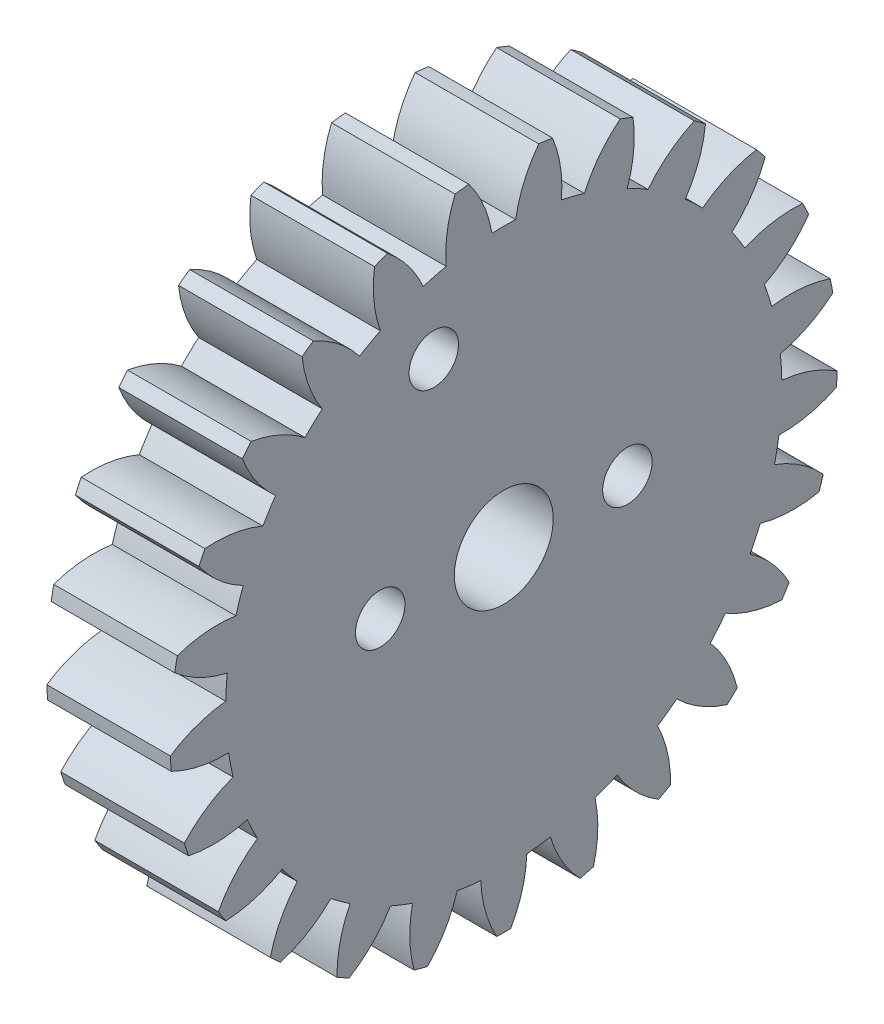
ISO-10303-21;
HEADER;
FILE_DESCRIPTION(('STEP AP214'),'2;1');
FILE_NAME('part.step','',(''),(''),'','','');
FILE_SCHEMA(('AUTOMOTIVE_DESIGN { 1 0 10303 214 1 1 1 1 }'));
ENDSEC;
DATA;
#1=APPLICATION_CONTEXT('core data for automotive mechanical design processes');
#2=APPLICATION_PROTOCOL_DEFINITION('international standard','automotive_design',2000,#1);
#3=PRODUCT_CONTEXT('',#1,'mechanical');
#4=PRODUCT('Part','Part','',(#3));
#5=PRODUCT_RELATED_PRODUCT_CATEGORY('part','',(#4));
#6=PRODUCT_DEFINITION_FORMATION('','',#4);
#7=PRODUCT_DEFINITION_CONTEXT('part definition',#1,'design');
#8=PRODUCT_DEFINITION('design','',#6,#7);
#9=PRODUCT_DEFINITION_SHAPE('','',#8);
#10=(LENGTH_UNIT() NAMED_UNIT(*) SI_UNIT(.MILLI.,.METRE.));
#11=(NAMED_UNIT(*) PLANE_ANGLE_UNIT() SI_UNIT($,.RADIAN.));
#12=(NAMED_UNIT(*) SI_UNIT($,.STERADIAN.) SOLID_ANGLE_UNIT());
#13=UNCERTAINTY_MEASURE_WITH_UNIT(LENGTH_MEASURE(1.E-05),#10,'distance_accuracy_value','');
#14=(GEOMETRIC_REPRESENTATION_CONTEXT(3) GLOBAL_UNCERTAINTY_ASSIGNED_CONTEXT((#13)) GLOBAL_UNIT_ASSIGNED_CONTEXT((#10,
#11,#12)) REPRESENTATION_CONTEXT('',''));
#15=CARTESIAN_POINT('',(0.,0.,0.));
#16=DIRECTION('',(0.,0.,1.));
#17=DIRECTION('',(1.,0.,0.));
#18=AXIS2_PLACEMENT_3D('',#15,#16,#17);
#19=CARTESIAN_POINT('',(-5.73931620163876,32.7252188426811,68.4192282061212));
#20=DIRECTION('',(-1.,0.,0.));
#21=DIRECTION('',(0.,0.,1.));
#22=AXIS2_PLACEMENT_3D('',#19,#20,#21);
#23=PLANE('',#22);
#24=CARTESIAN_POINT('',(-5.73931620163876,32.7252188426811,73.4192282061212));
#25=DIRECTION('',(1.,0.,0.));
#26=DIRECTION('',(0.,0.,-1.));
#27=AXIS2_PLACEMENT_3D('',#24,#25,#26);
#28=CIRCLE('',#27,0.999999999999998);
#29=CARTESIAN_POINT('',(-5.73931620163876,32.7252188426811,72.4192282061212));
#30=VERTEX_POINT('',#29);
#31=EDGE_CURVE('E1307',#30,#30,#28,.T.);
#32=ORIENTED_EDGE('',*,*,#31,.F.);
#33=EDGE_LOOP('',(#32));
#34=FACE_BOUND('',#33,.T.);
#35=CARTESIAN_POINT('',(-5.73931620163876,32.7252188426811,63.4192282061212));
#36=DIRECTION('',(1.,0.,0.));
#37=DIRECTION('',(0.,0.,-1.));
#38=AXIS2_PLACEMENT_3D('',#35,#36,#37);
#39=CIRCLE('',#38,0.999999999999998);
#40=CARTESIAN_POINT('',(-5.73931620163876,32.7252188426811,62.4192282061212));
#41=VERTEX_POINT('',#40);
#42=EDGE_CURVE('E1297',#41,#41,#39,.T.);
#43=ORIENTED_EDGE('',*,*,#42,.F.);
#44=EDGE_LOOP('',(#43));
#45=FACE_BOUND('',#44,.T.);
#46=CARTESIAN_POINT('',(-5.73931620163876,40.7392055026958,71.2522509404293));
#47=DIRECTION('',(1.,0.,0.));
#48=DIRECTION('',(0.,0.,-1.));
#49=AXIS2_PLACEMENT_3D('',#46,#47,#48);
#50=CIRCLE('',#49,0.999999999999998);
#51=CARTESIAN_POINT('',(-5.73931620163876,40.7392055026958,70.2522509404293));
#52=VERTEX_POINT('',#51);
#53=EDGE_CURVE('E1294',#52,#52,#50,.T.);
#54=ORIENTED_EDGE('',*,*,#53,.F.);
#55=EDGE_LOOP('',(#54));
#56=FACE_BOUND('',#55,.T.);
#57=CARTESIAN_POINT('',(-5.73931620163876,41.4758783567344,60.583529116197));
#58=DIRECTION('',(-1.,0.,0.));
#59=DIRECTION('',(0.,-0.248689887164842,-0.968583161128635));
#60=AXIS2_PLACEMENT_3D('',#57,#58,#59);
#61=CIRCLE('',#60,5.);
#62=CARTESIAN_POINT('',(-5.73931620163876,43.4914904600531,65.1592594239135));
#63=VERTEX_POINT('',#62);
#64=CARTESIAN_POINT('',(-5.73931620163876,45.3774125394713,63.710513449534));
#65=VERTEX_POINT('',#64);
#66=EDGE_CURVE('E662',#63,#65,#61,.T.);
#67=ORIENTED_EDGE('',*,*,#66,.F.);
#68=CARTESIAN_POINT('',(-5.73931620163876,32.7252188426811,68.4192282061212));
#69=DIRECTION('',(-1.,0.,0.));
#70=DIRECTION('',(0.,-0.248689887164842,-0.968583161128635));
#71=AXIS2_PLACEMENT_3D('',#68,#69,#70);
#72=CIRCLE('',#71,11.249);
#73=CARTESIAN_POINT('',(-5.73931620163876,43.7302765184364,66.0892697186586));
#74=VERTEX_POINT('',#73);
#75=EDGE_CURVE('E661',#74,#63,#72,.T.);
#76=ORIENTED_EDGE('',*,*,#75,.F.);
#77=CARTESIAN_POINT('',(-5.73931620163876,44.1683570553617,71.0700412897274));
#78=DIRECTION('',(-1.,0.,0.));
#79=DIRECTION('',(0.,-0.248689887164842,-0.968583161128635));
#80=AXIS2_PLACEMENT_3D('',#77,#78,#79);
#81=CIRCLE('',#80,5.);
#82=CARTESIAN_POINT('',(-5.73931620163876,46.0808613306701,66.4502656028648));
#83=VERTEX_POINT('',#82);
#84=EDGE_CURVE('E650',#83,#74,#81,.T.);
#85=ORIENTED_EDGE('',*,*,#84,.F.);
#86=CARTESIAN_POINT('',(-5.73931620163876,32.7252188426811,68.4192282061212));
#87=DIRECTION('',(-1.,0.,0.));
#88=DIRECTION('',(0.,0.,1.));
#89=AXIS2_PLACEMENT_3D('',#86,#87,#88);
#90=CIRCLE('',#89,13.5);
#91=CARTESIAN_POINT('',(-5.73931620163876,46.150930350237,67.0049190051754));
#92=VERTEX_POINT('',#91);
#93=EDGE_CURVE('E1215',#92,#83,#90,.T.);
#94=ORIENTED_EDGE('',*,*,#93,.F.);
#95=CARTESIAN_POINT('',(-5.73931620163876,43.1496194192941,63.0059025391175));
#96=DIRECTION('',(-1.,0.,0.));
#97=DIRECTION('',(0.,0.,-1.));
#98=AXIS2_PLACEMENT_3D('',#95,#96,#97);
#99=CIRCLE('',#98,5.);
#100=CARTESIAN_POINT('',(-5.73931620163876,43.9639695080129,67.93914021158));
#101=VERTEX_POINT('',#100);
#102=EDGE_CURVE('E1188',#101,#92,#99,.T.);
#103=ORIENTED_EDGE('',*,*,#102,.F.);
#104=CARTESIAN_POINT('',(-5.73931620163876,32.7252188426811,68.4192282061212));
#105=DIRECTION('',(-1.,0.,0.));
#106=DIRECTION('',(0.,0.,-1.));
#107=AXIS2_PLACEMENT_3D('',#104,#105,#106);
#108=CIRCLE('',#107,11.249);
#109=CARTESIAN_POINT('',(-5.73931620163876,43.9639695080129,68.8993162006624));
#110=VERTEX_POINT('',#109);
#111=EDGE_CURVE('E1193',#110,#101,#108,.T.);
#112=ORIENTED_EDGE('',*,*,#111,.F.);
#113=CARTESIAN_POINT('',(-5.73931620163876,43.1496194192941,73.8325538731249));
#114=DIRECTION('',(-1.,0.,0.));
#115=DIRECTION('',(0.,0.,-1.));
#116=AXIS2_PLACEMENT_3D('',#113,#114,#115);
#117=CIRCLE('',#116,5.);
#118=CARTESIAN_POINT('',(-5.73931620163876,46.150930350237,69.833537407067));
#119=VERTEX_POINT('',#118);
#120=EDGE_CURVE('E1190',#119,#110,#117,.T.);
#121=ORIENTED_EDGE('',*,*,#120,.F.);
#122=CARTESIAN_POINT('',(-5.73931620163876,46.0808613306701,70.3881908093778));
#123=VERTEX_POINT('',#122);
#124=EDGE_CURVE('E1213',#123,#119,#90,.T.);
#125=ORIENTED_EDGE('',*,*,#124,.F.);
#126=CARTESIAN_POINT('',(-5.73931620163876,44.1683570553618,65.7684151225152));
#127=DIRECTION('',(-1.,0.,0.));
#128=DIRECTION('',(0.,0.248689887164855,-0.968583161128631));
#129=AXIS2_PLACEMENT_3D('',#126,#127,#128);
#130=CIRCLE('',#129,5.);
#131=CARTESIAN_POINT('',(-5.73931620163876,43.7302765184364,70.749186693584));
#132=VERTEX_POINT('',#131);
#133=EDGE_CURVE('E1166',#132,#123,#130,.T.);
#134=ORIENTED_EDGE('',*,*,#133,.F.);
#135=CARTESIAN_POINT('',(-5.73931620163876,32.7252188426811,68.4192282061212));
#136=DIRECTION('',(-1.,0.,0.));
#137=DIRECTION('',(0.,0.248689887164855,-0.968583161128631));
#138=AXIS2_PLACEMENT_3D('',#135,#136,#137);
#139=CIRCLE('',#138,11.249);
#140=CARTESIAN_POINT('',(-5.73931620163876,43.4914904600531,71.6791969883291));
#141=VERTEX_POINT('',#140);
#142=EDGE_CURVE('E1171',#141,#132,#139,.T.);
#143=ORIENTED_EDGE('',*,*,#142,.F.);
#144=CARTESIAN_POINT('',(-5.73931620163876,41.4758783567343,76.2549272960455));
#145=DIRECTION('',(-1.,0.,0.));
#146=DIRECTION('',(0.,0.248689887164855,-0.968583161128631));
#147=AXIS2_PLACEMENT_3D('',#144,#145,#146);
#148=CIRCLE('',#147,5.);
#149=CARTESIAN_POINT('',(-5.73931620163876,45.3774125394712,73.1279429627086));
#150=VERTEX_POINT('',#149);
#151=EDGE_CURVE('E1168',#150,#141,#148,.T.);
#152=ORIENTED_EDGE('',*,*,#151,.F.);
#153=CARTESIAN_POINT('',(-5.73931620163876,45.1716081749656,73.6477454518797));
#154=VERTEX_POINT('',#153);
#155=EDGE_CURVE('E1420',#154,#150,#90,.T.);
#156=ORIENTED_EDGE('',*,*,#155,.F.);
#157=CARTESIAN_POINT('',(-5.73931620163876,44.4680802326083,68.6974880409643));
#158=DIRECTION('',(-1.,0.,0.));
#159=DIRECTION('',(0.,0.481753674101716,-0.876306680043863));
#160=AXIS2_PLACEMENT_3D('',#157,#158,#159);
#161=CIRCLE('',#160,5.);
#162=CARTESIAN_POINT('',(-5.73931620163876,42.8050952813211,73.4128333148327));
#163=VERTEX_POINT('',#162);
#164=EDGE_CURVE('E1144',#163,#154,#161,.T.);
#165=ORIENTED_EDGE('',*,*,#164,.F.);
#166=CARTESIAN_POINT('',(-5.73931620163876,32.7252188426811,68.4192282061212));
#167=DIRECTION('',(-1.,0.,0.));
#168=DIRECTION('',(0.,0.481753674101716,-0.876306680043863));
#169=AXIS2_PLACEMENT_3D('',#166,#167,#168);
#170=CIRCLE('',#169,11.249);
#171=CARTESIAN_POINT('',(-5.73931620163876,42.3425269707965,74.2542419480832));
#172=VERTEX_POINT('',#171);
#173=EDGE_CURVE('E1149',#172,#163,#170,.T.);
#174=ORIENTED_EDGE('',*,*,#173,.F.);
#175=CARTESIAN_POINT('',(-5.73931620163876,39.252301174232,78.1849549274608));
#176=DIRECTION('',(-1.,0.,0.));
#177=DIRECTION('',(0.,0.481753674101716,-0.876306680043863));
#178=AXIS2_PLACEMENT_3D('',#175,#176,#177);
#179=CIRCLE('',#178,5.);
#180=CARTESIAN_POINT('',(-5.73931620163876,43.8089108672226,76.1264826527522));
#181=VERTEX_POINT('',#180);
#182=EDGE_CURVE('E1146',#181,#172,#179,.T.);
#183=ORIENTED_EDGE('',*,*,#182,.F.);
#184=CARTESIAN_POINT('',(-5.73931620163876,43.4803026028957,76.5787731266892));
#185=VERTEX_POINT('',#184);
#186=EDGE_CURVE('E1415',#185,#181,#90,.T.);
#187=ORIENTED_EDGE('',*,*,#186,.F.);
#188=CARTESIAN_POINT('',(-5.73931620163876,44.0299562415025,71.6090768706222));
#189=DIRECTION('',(-1.,0.,0.));
#190=DIRECTION('',(0.,0.68454710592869,-0.72896862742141));
#191=AXIS2_PLACEMENT_3D('',#188,#189,#190);
#192=CIRCLE('',#191,5.);
#193=CARTESIAN_POINT('',(-5.73931620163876,41.2465583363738,75.7627133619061));
#194=VERTEX_POINT('',#193);
#195=EDGE_CURVE('E1122',#194,#185,#192,.T.);
#196=ORIENTED_EDGE('',*,*,#195,.F.);
#197=CARTESIAN_POINT('',(-5.73931620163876,32.7252188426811,68.4192282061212));
#198=DIRECTION('',(-1.,0.,0.));
#199=DIRECTION('',(0.,0.68454710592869,-0.72896862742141));
#200=AXIS2_PLACEMENT_3D('',#197,#198,#199);
#201=CIRCLE('',#200,11.249);
#202=CARTESIAN_POINT('',(-5.73931620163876,40.5892726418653,76.4626515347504));
#203=VERTEX_POINT('',#202);
#204=EDGE_CURVE('E1127',#203,#194,#201,.T.);
#205=ORIENTED_EDGE('',*,*,#204,.F.);
#206=CARTESIAN_POINT('',(-5.73931620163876,36.6186034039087,79.5013660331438));
#207=DIRECTION('',(-1.,0.,0.));
#208=DIRECTION('',(0.,0.68454710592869,-0.72896862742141));
#209=AXIS2_PLACEMENT_3D('',#206,#207,#208);
#210=CIRCLE('',#209,5.);
#211=CARTESIAN_POINT('',(-5.73931620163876,41.5439800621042,78.640747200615));
#212=VERTEX_POINT('',#211);
#213=EDGE_CURVE('E1124',#212,#203,#210,.T.);
#214=ORIENTED_EDGE('',*,*,#213,.F.);
#215=CARTESIAN_POINT('',(-5.73931620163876,41.1132155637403,78.9971065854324));
#216=VERTEX_POINT('',#215);
#217=EDGE_CURVE('E1410',#216,#212,#90,.T.);
#218=ORIENTED_EDGE('',*,*,#217,.F.);
#219=CARTESIAN_POINT('',(-5.73931620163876,42.8815140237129,74.3202357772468));
#220=DIRECTION('',(-1.,0.,0.));
#221=DIRECTION('',(0.,0.844327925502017,-0.535826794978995));
#222=AXIS2_PLACEMENT_3D('',#219,#220,#221);
#223=CIRCLE('',#222,5.);
#224=CARTESIAN_POINT('',(-5.73931620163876,39.1525942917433,77.6511752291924));
#225=VERTEX_POINT('',#224);
#226=EDGE_CURVE('E1100',#225,#216,#223,.T.);
#227=ORIENTED_EDGE('',*,*,#226,.F.);
#228=CARTESIAN_POINT('',(-5.73931620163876,32.7252188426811,68.4192282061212));
#229=DIRECTION('',(-1.,0.,0.));
#230=DIRECTION('',(0.,0.844327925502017,-0.535826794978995));
#231=AXIS2_PLACEMENT_3D('',#228,#229,#230);
#232=CIRCLE('',#231,11.249);
#233=CARTESIAN_POINT('',(-5.73931620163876,38.3418908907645,78.1656632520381));
#234=VERTEX_POINT('',#233);
#235=EDGE_CURVE('E1105',#234,#225,#232,.T.);
#236=ORIENTED_EDGE('',*,*,#235,.F.);
#237=CARTESIAN_POINT('',(-5.73931620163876,33.7402699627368,80.121445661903));
#238=DIRECTION('',(-1.,0.,0.));
#239=DIRECTION('',(0.,0.844327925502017,-0.535826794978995));
#240=AXIS2_PLACEMENT_3D('',#237,#238,#239);
#241=CIRCLE('',#240,5.);
#242=CARTESIAN_POINT('',(-5.73931620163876,38.7249340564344,80.5127561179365));
#243=VERTEX_POINT('',#242);
#244=EDGE_CURVE('E1102',#243,#234,#241,.T.);
#245=ORIENTED_EDGE('',*,*,#244,.F.);
#246=CARTESIAN_POINT('',(-5.73931620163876,38.2190798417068,80.750793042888));
#247=VERTEX_POINT('',#246);
#248=EDGE_CURVE('E1405',#247,#243,#90,.T.);
#249=ORIENTED_EDGE('',*,*,#248,.F.);
#250=CARTESIAN_POINT('',(-5.73931620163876,41.0949144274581,76.6606126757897));
#251=DIRECTION('',(-1.,0.,0.));
#252=DIRECTION('',(0.,0.951056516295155,-0.309016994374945));
#253=AXIS2_PLACEMENT_3D('',#250,#251,#252);
#254=CIRCLE('',#253,5.);
#255=CARTESIAN_POINT('',(-5.73931620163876,36.6547746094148,78.959559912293));
#256=VERTEX_POINT('',#255);
#257=EDGE_CURVE('E1078',#256,#247,#254,.T.);
#258=ORIENTED_EDGE('',*,*,#257,.F.);
#259=CARTESIAN_POINT('',(-5.73931620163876,32.7252188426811,68.4192282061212));
#260=DIRECTION('',(-1.,0.,0.));
#261=DIRECTION('',(0.,0.951056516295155,-0.309016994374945));
#262=AXIS2_PLACEMENT_3D('',#259,#260,#261);
#263=CIRCLE('',#262,11.249);
#264=CARTESIAN_POINT('',(-5.73931620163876,35.7415929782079,79.2562706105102));
#265=VERTEX_POINT('',#264);
#266=EDGE_CURVE('E1083',#265,#256,#263,.T.);
#267=ORIENTED_EDGE('',*,*,#266,.F.);
#268=CARTESIAN_POINT('',(-5.73931620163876,30.7981571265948,80.0062319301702));
#269=DIRECTION('',(-1.,0.,0.));
#270=DIRECTION('',(0.,0.951056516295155,-0.309016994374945));
#271=AXIS2_PLACEMENT_3D('',#268,#269,#270);
#272=CIRCLE('',#271,5.);
#273=CARTESIAN_POINT('',(-5.73931620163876,35.5289038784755,81.6248841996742));
#274=VERTEX_POINT('',#273);
#275=EDGE_CURVE('E1080',#274,#265,#272,.T.);
#276=ORIENTED_EDGE('',*,*,#275,.F.);
#277=CARTESIAN_POINT('',(-5.73931620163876,34.9797446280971,81.7296419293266));
#278=VERTEX_POINT('',#277);
#279=EDGE_CURVE('E1400',#278,#274,#90,.T.);
#280=ORIENTED_EDGE('',*,*,#279,.F.);
#281=CARTESIAN_POINT('',(-5.73931620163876,38.7824160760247,78.4831530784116));
#282=DIRECTION('',(-1.,0.,0.));
#283=DIRECTION('',(0.,0.998026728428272,-0.06279051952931));
#284=AXIS2_PLACEMENT_3D('',#281,#282,#283);
#285=CIRCLE('',#284,5.);
#286=CARTESIAN_POINT('',(-5.73931620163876,33.9100464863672,79.6056567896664));
#287=VERTEX_POINT('',#286);
#288=EDGE_CURVE('E1056',#287,#278,#285,.T.);
#289=ORIENTED_EDGE('',*,*,#288,.F.);
#290=CARTESIAN_POINT('',(-5.73931620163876,32.7252188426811,68.4192282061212));
#291=DIRECTION('',(-1.,0.,0.));
#292=DIRECTION('',(0.,0.998026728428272,-0.06279051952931));
#293=AXIS2_PLACEMENT_3D('',#290,#291,#292);
#294=CIRCLE('',#293,11.249);
#295=CARTESIAN_POINT('',(-5.73931620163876,32.951765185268,79.6659467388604));
#296=VERTEX_POINT('',#295);
#297=EDGE_CURVE('E1061',#296,#287,#294,.T.);
#298=ORIENTED_EDGE('',*,*,#297,.F.);
#299=CARTESIAN_POINT('',(-5.73931620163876,27.9771286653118,79.1629641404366));
#300=DIRECTION('',(-1.,0.,0.));
#301=DIRECTION('',(0.,0.998026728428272,-0.06279051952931));
#302=AXIS2_PLACEMENT_3D('',#299,#300,#301);
#303=CIRCLE('',#302,5.);
#304=CARTESIAN_POINT('',(-5.73931620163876,32.1567078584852,81.9072523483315));
#305=VERTEX_POINT('',#304);
#306=EDGE_CURVE('E1058',#305,#296,#303,.T.);
#307=ORIENTED_EDGE('',*,*,#306,.F.);
#308=CARTESIAN_POINT('',(-5.73931620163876,31.5987492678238,81.8721485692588));
#309=VERTEX_POINT('',#308);
#310=EDGE_CURVE('E1395',#309,#305,#90,.T.);
#311=ORIENTED_EDGE('',*,*,#310,.F.);
#312=CARTESIAN_POINT('',(-5.73931620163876,36.0893217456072,79.6733400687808));
#313=DIRECTION('',(-1.,0.,0.));
#314=DIRECTION('',(0.,0.982287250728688,0.187381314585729));
#315=AXIS2_PLACEMENT_3D('',#312,#313,#314);
#316=CIRCLE('',#315,5.);
#317=CARTESIAN_POINT('',(-5.73931620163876,31.0908712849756,79.5488692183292));
#318=VERTEX_POINT('',#317);
#319=EDGE_CURVE('E1034',#318,#309,#316,.T.);
#320=ORIENTED_EDGE('',*,*,#319,.F.);
#321=CARTESIAN_POINT('',(-5.73931620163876,32.7252188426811,68.4192282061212));
#322=DIRECTION('',(-1.,0.,0.));
#323=DIRECTION('',(0.,0.982287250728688,0.187381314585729));
#324=AXIS2_PLACEMENT_3D('',#321,#322,#323);
#325=CIRCLE('',#324,11.249);
#326=CARTESIAN_POINT('',(-5.73931620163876,30.1477026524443,79.3689501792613));
#327=VERTEX_POINT('',#326);
#328=EDGE_CURVE('E1039',#327,#318,#325,.T.);
#329=ORIENTED_EDGE('',*,*,#328,.F.);
#330=CARTESIAN_POINT('',(-5.73931620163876,25.454440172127,77.6446279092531));
#331=DIRECTION('',(-1.,0.,0.));
#332=DIRECTION('',(0.,0.982287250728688,0.187381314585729));
#333=AXIS2_PLACEMENT_3D('',#330,#331,#332);
#334=CIRCLE('',#333,5.);
#335=CARTESIAN_POINT('',(-5.73931620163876,28.8202334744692,81.3421183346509));
#336=VERTEX_POINT('',#335);
#337=EDGE_CURVE('E1036',#336,#327,#334,.T.);
#338=ORIENTED_EDGE('',*,*,#337,.F.);
#339=CARTESIAN_POINT('',(-5.73931620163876,28.2885341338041,81.1693587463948));
#340=VERTEX_POINT('',#339);
#341=EDGE_CURVE('E1390',#340,#336,#90,.T.);
#342=ORIENTED_EDGE('',*,*,#341,.F.);
#343=CARTESIAN_POINT('',(-5.73931620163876,33.1848484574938,80.1563898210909));
#344=DIRECTION('',(-1.,0.,0.));
#345=DIRECTION('',(0.,0.904827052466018,0.425779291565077));
#346=AXIS2_PLACEMENT_3D('',#343,#344,#345);
#347=CIRCLE('',#346,5.);
#348=CARTESIAN_POINT('',(-5.73931620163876,28.3743881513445,78.7927653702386));
#349=VERTEX_POINT('',#348);
#350=EDGE_CURVE('E1012',#349,#340,#347,.T.);
#351=ORIENTED_EDGE('',*,*,#350,.F.);
#352=CARTESIAN_POINT('',(-5.73931620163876,32.7252188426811,68.4192282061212));
#353=DIRECTION('',(-1.,0.,0.));
#354=DIRECTION('',(0.,0.904827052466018,0.425779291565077));
#355=AXIS2_PLACEMENT_3D('',#352,#353,#354);
#356=CIRCLE('',#355,11.249);
#357=CARTESIAN_POINT('',(-5.73931620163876,27.5055949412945,78.3839423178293));
#358=VERTEX_POINT('',#357);
#359=EDGE_CURVE('E1017',#358,#349,#356,.T.);
#360=ORIENTED_EDGE('',*,*,#359,.F.);
#361=CARTESIAN_POINT('',(-5.73931620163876,23.3886014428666,75.5466258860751));
#362=DIRECTION('',(-1.,0.,0.));
#363=DIRECTION('',(0.,0.904827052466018,0.425779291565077));
#364=AXIS2_PLACEMENT_3D('',#361,#362,#363);
#365=CIRCLE('',#364,5.);
#366=CARTESIAN_POINT('',(-5.73931620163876,25.7291236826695,79.9649916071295));
#367=VERTEX_POINT('',#366);
#368=EDGE_CURVE('E1014',#367,#358,#365,.T.);
#369=ORIENTED_EDGE('',*,*,#368,.F.);
#370=CARTESIAN_POINT('',(-5.73931620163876,25.2570922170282,79.6654313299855));
#371=VERTEX_POINT('',#370);
#372=EDGE_CURVE('E1385',#371,#367,#90,.T.);
#373=ORIENTED_EDGE('',*,*,#372,.F.);
#374=CARTESIAN_POINT('',(-5.73931620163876,30.2514949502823,79.9019505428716));
#375=DIRECTION('',(-1.,0.,0.));
#376=DIRECTION('',(0.,0.770513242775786,0.637423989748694));
#377=AXIS2_PLACEMENT_3D('',#374,#375,#376);
#378=CIRCLE('',#377,5.);
#379=CARTESIAN_POINT('',(-5.73931620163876,25.9312837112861,77.3848540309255));
#380=VERTEX_POINT('',#379);
#381=EDGE_CURVE('E990',#380,#371,#378,.T.);
#382=ORIENTED_EDGE('',*,*,#381,.F.);
#383=CARTESIAN_POINT('',(-5.73931620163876,32.7252188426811,68.4192282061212));
#384=DIRECTION('',(-1.,0.,0.));
#385=DIRECTION('',(0.,0.770513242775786,0.637423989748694));
#386=AXIS2_PLACEMENT_3D('',#383,#384,#385);
#387=CIRCLE('',#386,11.249);
#388=CARTESIAN_POINT('',(-5.73931620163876,25.1914553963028,76.7728148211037));
#389=VERTEX_POINT('',#388);
#390=EDGE_CURVE('E995',#389,#380,#387,.T.);
#391=ORIENTED_EDGE('',*,*,#390,.F.);
#392=CARTESIAN_POINT('',(-5.73931620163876,21.9094167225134,73.0007832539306));
#393=DIRECTION('',(-1.,0.,0.));
#394=DIRECTION('',(0.,0.770513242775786,0.637423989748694));
#395=AXIS2_PLACEMENT_3D('',#392,#393,#394);
#396=CIRCLE('',#395,5.);
#397=CARTESIAN_POINT('',(-5.73931620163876,23.0776042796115,77.8624021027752));
#398=VERTEX_POINT('',#397);
#399=EDGE_CURVE('E992',#398,#389,#396,.T.);
#400=ORIENTED_EDGE('',*,*,#399,.F.);
#401=CARTESIAN_POINT('',(-5.73931620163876,22.6949001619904,77.4548636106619));
#402=VERTEX_POINT('',#401);
#403=EDGE_CURVE('E1380',#402,#398,#90,.T.);
#404=ORIENTED_EDGE('',*,*,#403,.F.);
#405=CARTESIAN_POINT('',(-5.73931620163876,27.4735746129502,78.9260095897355));
#406=DIRECTION('',(-1.,0.,0.));
#407=DIRECTION('',(0.,0.587785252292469,0.809016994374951));
#408=AXIS2_PLACEMENT_3D('',#405,#406,#407);
#409=CIRCLE('',#408,5.);
#410=CARTESIAN_POINT('',(-5.73931620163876,23.9150672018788,75.4135994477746));
#411=VERTEX_POINT('',#410);
#412=EDGE_CURVE('E968',#411,#402,#409,.T.);
#413=ORIENTED_EDGE('',*,*,#412,.F.);
#414=CARTESIAN_POINT('',(-5.73931620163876,32.7252188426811,68.4192282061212));
#415=DIRECTION('',(-1.,0.,0.));
#416=DIRECTION('',(0.,0.587785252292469,0.809016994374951));
#417=AXIS2_PLACEMENT_3D('',#414,#415,#416);
#418=CIRCLE('',#417,11.249);
#419=CARTESIAN_POINT('',(-5.73931620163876,23.3506899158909,74.6368007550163));
#420=VERTEX_POINT('',#419);
#421=EDGE_CURVE('E973',#420,#411,#418,.T.);
#422=ORIENTED_EDGE('',*,*,#421,.F.);
#423=CARTESIAN_POINT('',(-5.73931620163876,21.1098286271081,70.1670646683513));
#424=DIRECTION('',(-1.,0.,0.));
#425=DIRECTION('',(0.,0.587785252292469,0.809016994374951));
#426=AXIS2_PLACEMENT_3D('',#423,#424,#425);
#427=CIRCLE('',#426,5.);
#428=CARTESIAN_POINT('',(-5.73931620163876,21.0322799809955,75.1664632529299));
#429=VERTEX_POINT('',#428);
#430=EDGE_CURVE('E970',#429,#420,#427,.T.);
#431=ORIENTED_EDGE('',*,*,#430,.F.);
#432=CARTESIAN_POINT('',(-5.73931620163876,20.7629499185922,74.6765536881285));
#433=VERTEX_POINT('',#432);
#434=EDGE_CURVE('E1375',#433,#429,#90,.T.);
#435=ORIENTED_EDGE('',*,*,#434,.F.);
#436=CARTESIAN_POINT('',(-5.73931620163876,25.0256343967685,77.2898889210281));
#437=DIRECTION('',(-1.,0.,0.));
#438=DIRECTION('',(0.,0.368124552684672,0.929776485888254));
#439=AXIS2_PLACEMENT_3D('',#436,#437,#438);
#440=CIRCLE('',#439,5.);
#441=CARTESIAN_POINT('',(-5.73931620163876,22.4524249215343,73.0028627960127));
#442=VERTEX_POINT('',#441);
#443=EDGE_CURVE('E946',#442,#433,#440,.T.);
#444=ORIENTED_EDGE('',*,*,#443,.F.);
#445=CARTESIAN_POINT('',(-5.73931620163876,32.7252188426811,68.4192282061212));
#446=DIRECTION('',(-1.,0.,0.));
#447=DIRECTION('',(0.,0.368124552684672,0.929776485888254));
#448=AXIS2_PLACEMENT_3D('',#445,#446,#447);
#449=CIRCLE('',#448,11.249);
#450=CARTESIAN_POINT('',(-5.73931620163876,22.0989605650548,72.1101137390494));
#451=VERTEX_POINT('',#450);
#452=EDGE_CURVE('E951',#451,#442,#449,.T.);
#453=ORIENTED_EDGE('',*,*,#452,.F.);
#454=CARTESIAN_POINT('',(-5.73931620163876,21.0400782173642,67.2235230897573));
#455=DIRECTION('',(-1.,0.,0.));
#456=DIRECTION('',(0.,0.368124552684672,0.929776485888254));
#457=AXIS2_PLACEMENT_3D('',#454,#455,#456);
#458=CIRCLE('',#457,5.);
#459=CARTESIAN_POINT('',(-5.73931620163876,19.7216660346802,72.0465708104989));
#460=VERTEX_POINT('',#459);
#461=EDGE_CURVE('E948',#460,#451,#458,.T.);
#462=ORIENTED_EDGE('',*,*,#461,.F.);
#463=CARTESIAN_POINT('',(-5.73931620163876,19.5826330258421,71.5050729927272));
#464=VERTEX_POINT('',#463);
#465=EDGE_CURVE('E1370',#464,#460,#90,.T.);
#466=ORIENTED_EDGE('',*,*,#465,.F.);
#467=CARTESIAN_POINT('',(-5.73931620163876,23.0614873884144,75.096392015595));
#468=DIRECTION('',(-1.,0.,0.));
#469=DIRECTION('',(0.,0.125333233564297,0.992114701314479));
#470=AXIS2_PLACEMENT_3D('',#467,#468,#469);
#471=CIRCLE('',#470,5.);
#472=CARTESIAN_POINT('',(-5.73931620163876,21.6352600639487,70.304119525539));
#473=VERTEX_POINT('',#472);
#474=EDGE_CURVE('E924',#473,#464,#471,.T.);
#475=ORIENTED_EDGE('',*,*,#474,.F.);
#476=CARTESIAN_POINT('',(-5.73931620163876,32.7252188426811,68.4192282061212));
#477=DIRECTION('',(-1.,0.,0.));
#478=DIRECTION('',(0.,0.125333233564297,0.992114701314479));
#479=AXIS2_PLACEMENT_3D('',#476,#477,#478);
#480=CIRCLE('',#479,11.249);
#481=CARTESIAN_POINT('',(-5.73931620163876,21.5149181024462,69.3515148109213));
#482=VERTEX_POINT('',#481);
#483=EDGE_CURVE('E929',#482,#473,#480,.T.);
#484=ORIENTED_EDGE('',*,*,#483,.F.);
#485=CARTESIAN_POINT('',(-5.73931620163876,21.70454816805,64.3551120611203));
#486=DIRECTION('',(-1.,0.,0.));
#487=DIRECTION('',(0.,0.125333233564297,0.992114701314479));
#488=AXIS2_PLACEMENT_3D('',#485,#486,#487);
#489=CIRCLE('',#488,5.);
#490=CARTESIAN_POINT('',(-5.73931620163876,19.2281131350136,68.6987590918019));
#491=VERTEX_POINT('',#490);
#492=EDGE_CURVE('E926',#491,#482,#489,.T.);
#493=ORIENTED_EDGE('',*,*,#492,.F.);
#494=CARTESIAN_POINT('',(-5.73931620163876,19.2281131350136,68.1396973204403));
#495=VERTEX_POINT('',#494);
#496=EDGE_CURVE('E1365',#495,#491,#90,.T.);
#497=ORIENTED_EDGE('',*,*,#496,.F.);
#498=CARTESIAN_POINT('',(-5.73931620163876,21.70454816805,72.483344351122));
#499=DIRECTION('',(-1.,0.,0.));
#500=DIRECTION('',(0.,-0.125333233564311,0.992114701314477));
#501=AXIS2_PLACEMENT_3D('',#498,#499,#500);
#502=CIRCLE('',#501,5.);
#503=CARTESIAN_POINT('',(-5.73931620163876,21.5149181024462,67.486941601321));
#504=VERTEX_POINT('',#503);
#505=EDGE_CURVE('E902',#504,#495,#502,.T.);
#506=ORIENTED_EDGE('',*,*,#505,.F.);
#507=CARTESIAN_POINT('',(-5.73931620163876,32.7252188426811,68.4192282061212));
#508=DIRECTION('',(-1.,0.,0.));
#509=DIRECTION('',(0.,-0.125333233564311,0.992114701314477));
#510=AXIS2_PLACEMENT_3D('',#507,#508,#509);
#511=CIRCLE('',#510,11.249);
#512=CARTESIAN_POINT('',(-5.73931620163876,21.6352600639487,66.5343368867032));
#513=VERTEX_POINT('',#512);
#514=EDGE_CURVE('E907',#513,#504,#511,.T.);
#515=ORIENTED_EDGE('',*,*,#514,.F.);
#516=CARTESIAN_POINT('',(-5.73931620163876,23.0614873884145,61.7420643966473));
#517=DIRECTION('',(-1.,0.,0.));
#518=DIRECTION('',(0.,-0.125333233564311,0.992114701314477));
#519=AXIS2_PLACEMENT_3D('',#516,#517,#518);
#520=CIRCLE('',#519,5.);
#521=CARTESIAN_POINT('',(-5.73931620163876,19.5826330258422,65.333383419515));
#522=VERTEX_POINT('',#521);
#523=EDGE_CURVE('E904',#522,#513,#520,.T.);
#524=ORIENTED_EDGE('',*,*,#523,.F.);
#525=CARTESIAN_POINT('',(-5.73931620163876,19.7216660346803,64.7918856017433));
#526=VERTEX_POINT('',#525);
#527=EDGE_CURVE('E1360',#526,#522,#90,.T.);
#528=ORIENTED_EDGE('',*,*,#527,.F.);
#529=CARTESIAN_POINT('',(-5.73931620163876,21.0400782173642,69.6149333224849));
#530=DIRECTION('',(-1.,0.,0.));
#531=DIRECTION('',(0.,-0.368124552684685,0.929776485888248));
#532=AXIS2_PLACEMENT_3D('',#529,#530,#531);
#533=CIRCLE('',#532,5.);
#534=CARTESIAN_POINT('',(-5.73931620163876,22.0989605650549,64.7283426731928));
#535=VERTEX_POINT('',#534);
#536=EDGE_CURVE('E880',#535,#526,#533,.T.);
#537=ORIENTED_EDGE('',*,*,#536,.F.);
#538=CARTESIAN_POINT('',(-5.73931620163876,32.7252188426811,68.4192282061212));
#539=DIRECTION('',(-1.,0.,0.));
#540=DIRECTION('',(0.,-0.368124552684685,0.929776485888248));
#541=AXIS2_PLACEMENT_3D('',#538,#539,#540);
#542=CIRCLE('',#541,11.249);
#543=CARTESIAN_POINT('',(-5.73931620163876,22.4524249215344,63.8355936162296));
#544=VERTEX_POINT('',#543);
#545=EDGE_CURVE('E885',#544,#535,#542,.T.);
#546=ORIENTED_EDGE('',*,*,#545,.F.);
#547=CARTESIAN_POINT('',(-5.73931620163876,25.0256343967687,59.5485674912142));
#548=DIRECTION('',(-1.,0.,0.));
#549=DIRECTION('',(0.,-0.368124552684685,0.929776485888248));
#550=AXIS2_PLACEMENT_3D('',#547,#548,#549);
#551=CIRCLE('',#550,5.);
#552=CARTESIAN_POINT('',(-5.73931620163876,20.7629499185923,62.1619027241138));
#553=VERTEX_POINT('',#552);
#554=EDGE_CURVE('E882',#553,#544,#551,.T.);
#555=ORIENTED_EDGE('',*,*,#554,.F.);
#556=CARTESIAN_POINT('',(-5.73931620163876,21.0322799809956,61.6719931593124));
#557=VERTEX_POINT('',#556);
#558=EDGE_CURVE('E1355',#557,#553,#90,.T.);
#559=ORIENTED_EDGE('',*,*,#558,.F.);
#560=CARTESIAN_POINT('',(-5.73931620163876,21.1098286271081,66.6713917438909));
#561=DIRECTION('',(-1.,0.,0.));
#562=DIRECTION('',(0.,-0.58778525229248,0.809016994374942));
#563=AXIS2_PLACEMENT_3D('',#560,#561,#562);
#564=CIRCLE('',#563,5.);
#565=CARTESIAN_POINT('',(-5.73931620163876,23.3506899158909,62.201655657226));
#566=VERTEX_POINT('',#565);
#567=EDGE_CURVE('E858',#566,#557,#564,.T.);
#568=ORIENTED_EDGE('',*,*,#567,.F.);
#569=CARTESIAN_POINT('',(-5.73931620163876,32.7252188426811,68.4192282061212));
#570=DIRECTION('',(-1.,0.,0.));
#571=DIRECTION('',(0.,-0.58778525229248,0.809016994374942));
#572=AXIS2_PLACEMENT_3D('',#569,#570,#571);
#573=CIRCLE('',#572,11.249);
#574=CARTESIAN_POINT('',(-5.73931620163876,23.9150672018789,61.4248569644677));
#575=VERTEX_POINT('',#574);
#576=EDGE_CURVE('E863',#575,#566,#573,.T.);
#577=ORIENTED_EDGE('',*,*,#576,.F.);
#578=CARTESIAN_POINT('',(-5.73931620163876,27.4735746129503,57.9124468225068));
#579=DIRECTION('',(-1.,0.,0.));
#580=DIRECTION('',(0.,-0.58778525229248,0.809016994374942));
#581=AXIS2_PLACEMENT_3D('',#578,#579,#580);
#582=CIRCLE('',#581,5.);
#583=CARTESIAN_POINT('',(-5.73931620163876,22.6949001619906,59.3835928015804));
#584=VERTEX_POINT('',#583);
#585=EDGE_CURVE('E860',#584,#575,#582,.T.);
#586=ORIENTED_EDGE('',*,*,#585,.F.);
#587=CARTESIAN_POINT('',(-5.73931620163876,23.0776042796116,58.9760543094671));
#588=VERTEX_POINT('',#587);
#589=EDGE_CURVE('E1350',#588,#584,#90,.T.);
#590=ORIENTED_EDGE('',*,*,#589,.F.);
#591=CARTESIAN_POINT('',(-5.73931620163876,21.9094167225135,63.8376731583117));
#592=DIRECTION('',(-1.,0.,0.));
#593=DIRECTION('',(0.,-0.770513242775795,0.637423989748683));
#594=AXIS2_PLACEMENT_3D('',#591,#592,#593);
#595=CIRCLE('',#594,5.);
#596=CARTESIAN_POINT('',(-5.73931620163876,25.1914553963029,60.0656415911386));
#597=VERTEX_POINT('',#596);
#598=EDGE_CURVE('E836',#597,#588,#595,.T.);
#599=ORIENTED_EDGE('',*,*,#598,.F.);
#600=CARTESIAN_POINT('',(-5.73931620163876,32.7252188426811,68.4192282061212));
#601=DIRECTION('',(-1.,0.,0.));
#602=DIRECTION('',(0.,-0.770513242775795,0.637423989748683));
#603=AXIS2_PLACEMENT_3D('',#600,#601,#602);
#604=CIRCLE('',#603,11.249);
#605=CARTESIAN_POINT('',(-5.73931620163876,25.9312837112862,59.4536023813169));
#606=VERTEX_POINT('',#605);
#607=EDGE_CURVE('E841',#606,#597,#604,.T.);
#608=ORIENTED_EDGE('',*,*,#607,.F.);
#609=CARTESIAN_POINT('',(-5.73931620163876,30.2514949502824,56.9365058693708));
#610=DIRECTION('',(-1.,0.,0.));
#611=DIRECTION('',(0.,-0.770513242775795,0.637423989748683));
#612=AXIS2_PLACEMENT_3D('',#609,#610,#611);
#613=CIRCLE('',#612,5.);
#614=CARTESIAN_POINT('',(-5.73931620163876,25.2570922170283,57.1730250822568));
#615=VERTEX_POINT('',#614);
#616=EDGE_CURVE('E838',#615,#606,#613,.T.);
#617=ORIENTED_EDGE('',*,*,#616,.F.);
#618=CARTESIAN_POINT('',(-5.73931620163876,25.7291236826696,56.8734648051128));
#619=VERTEX_POINT('',#618);
#620=EDGE_CURVE('E1345',#619,#615,#90,.T.);
#621=ORIENTED_EDGE('',*,*,#620,.F.);
#622=CARTESIAN_POINT('',(-5.73931620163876,23.3886014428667,61.2918305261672));
#623=DIRECTION('',(-1.,0.,0.));
#624=DIRECTION('',(0.,-0.904827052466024,0.425779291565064));
#625=AXIS2_PLACEMENT_3D('',#622,#623,#624);
#626=CIRCLE('',#625,5.);
#627=CARTESIAN_POINT('',(-5.73931620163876,27.5055949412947,58.454514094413));
#628=VERTEX_POINT('',#627);
#629=EDGE_CURVE('E814',#628,#619,#626,.T.);
#630=ORIENTED_EDGE('',*,*,#629,.F.);
#631=CARTESIAN_POINT('',(-5.73931620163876,32.7252188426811,68.4192282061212));
#632=DIRECTION('',(-1.,0.,0.));
#633=DIRECTION('',(0.,-0.904827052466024,0.425779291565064));
#634=AXIS2_PLACEMENT_3D('',#631,#632,#633);
#635=CIRCLE('',#634,11.249);
#636=CARTESIAN_POINT('',(-5.73931620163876,28.3743881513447,58.0456910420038));
#637=VERTEX_POINT('',#636);
#638=EDGE_CURVE('E819',#637,#628,#635,.T.);
#639=ORIENTED_EDGE('',*,*,#638,.F.);
#640=CARTESIAN_POINT('',(-5.73931620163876,33.184848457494,56.6820665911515));
#641=DIRECTION('',(-1.,0.,0.));
#642=DIRECTION('',(0.,-0.904827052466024,0.425779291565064));
#643=AXIS2_PLACEMENT_3D('',#640,#641,#642);
#644=CIRCLE('',#643,5.);
#645=CARTESIAN_POINT('',(-5.73931620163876,28.2885341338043,55.6690976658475));
#646=VERTEX_POINT('',#645);
#647=EDGE_CURVE('E816',#646,#637,#644,.T.);
#648=ORIENTED_EDGE('',*,*,#647,.F.);
#649=CARTESIAN_POINT('',(-5.73931620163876,28.8202334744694,55.4963380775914));
#650=VERTEX_POINT('',#649);
#651=EDGE_CURVE('E1340',#650,#646,#90,.T.);
#652=ORIENTED_EDGE('',*,*,#651,.F.);
#653=CARTESIAN_POINT('',(-5.73931620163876,25.4544401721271,59.1938285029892));
#654=DIRECTION('',(-1.,0.,0.));
#655=DIRECTION('',(0.,-0.982287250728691,0.187381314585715));
#656=AXIS2_PLACEMENT_3D('',#653,#654,#655);
#657=CIRCLE('',#656,5.);
#658=CARTESIAN_POINT('',(-5.73931620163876,30.1477026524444,57.4695062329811));
#659=VERTEX_POINT('',#658);
#660=EDGE_CURVE('E792',#659,#650,#657,.T.);
#661=ORIENTED_EDGE('',*,*,#660,.F.);
#662=CARTESIAN_POINT('',(-5.73931620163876,32.7252188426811,68.4192282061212));
#663=DIRECTION('',(-1.,0.,0.));
#664=DIRECTION('',(0.,-0.982287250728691,0.187381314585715));
#665=AXIS2_PLACEMENT_3D('',#662,#663,#664);
#666=CIRCLE('',#665,11.249);
#667=CARTESIAN_POINT('',(-5.73931620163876,31.0908712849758,57.2895871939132));
#668=VERTEX_POINT('',#667);
#669=EDGE_CURVE('E797',#668,#659,#666,.T.);
#670=ORIENTED_EDGE('',*,*,#669,.F.);
#671=CARTESIAN_POINT('',(-5.73931620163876,36.0893217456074,57.1651163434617));
#672=DIRECTION('',(-1.,0.,0.));
#673=DIRECTION('',(0.,-0.982287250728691,0.187381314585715));
#674=AXIS2_PLACEMENT_3D('',#671,#672,#673);
#675=CIRCLE('',#674,5.);
#676=CARTESIAN_POINT('',(-5.73931620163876,31.598749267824,54.9663078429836));
#677=VERTEX_POINT('',#676);
#678=EDGE_CURVE('E794',#677,#668,#675,.T.);
#679=ORIENTED_EDGE('',*,*,#678,.F.);
#680=CARTESIAN_POINT('',(-5.73931620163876,32.1567078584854,54.9312040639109));
#681=VERTEX_POINT('',#680);
#682=EDGE_CURVE('E1335',#681,#677,#90,.T.);
#683=ORIENTED_EDGE('',*,*,#682,.F.);
#684=CARTESIAN_POINT('',(-5.73931620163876,27.9771286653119,57.6754922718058));
#685=DIRECTION('',(-1.,0.,0.));
#686=DIRECTION('',(0.,-0.998026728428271,-0.0627905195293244));
#687=AXIS2_PLACEMENT_3D('',#684,#685,#686);
#688=CIRCLE('',#687,5.);
#689=CARTESIAN_POINT('',(-5.73931620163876,32.9517651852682,57.172509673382));
#690=VERTEX_POINT('',#689);
#691=EDGE_CURVE('E770',#690,#681,#688,.T.);
#692=ORIENTED_EDGE('',*,*,#691,.F.);
#693=CARTESIAN_POINT('',(-5.73931620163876,32.7252188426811,68.4192282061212));
#694=DIRECTION('',(-1.,0.,0.));
#695=DIRECTION('',(0.,-0.998026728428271,-0.0627905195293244));
#696=AXIS2_PLACEMENT_3D('',#693,#694,#695);
#697=CIRCLE('',#696,11.249);
#698=CARTESIAN_POINT('',(-5.73931620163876,33.9100464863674,57.232799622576));
#699=VERTEX_POINT('',#698);
#700=EDGE_CURVE('E775',#699,#690,#697,.T.);
#701=ORIENTED_EDGE('',*,*,#700,.F.);
#702=CARTESIAN_POINT('',(-5.73931620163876,38.7824160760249,58.3553033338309));
#703=DIRECTION('',(-1.,0.,0.));
#704=DIRECTION('',(0.,-0.998026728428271,-0.0627905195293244));
#705=AXIS2_PLACEMENT_3D('',#702,#703,#704);
#706=CIRCLE('',#705,5.);
#707=CARTESIAN_POINT('',(-5.73931620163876,34.9797446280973,55.1088144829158));
#708=VERTEX_POINT('',#707);
#709=EDGE_CURVE('E772',#708,#699,#706,.T.);
#710=ORIENTED_EDGE('',*,*,#709,.F.);
#711=CARTESIAN_POINT('',(-5.73931620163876,35.5289038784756,55.2135722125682));
#712=VERTEX_POINT('',#711);
#713=EDGE_CURVE('E1330',#712,#708,#90,.T.);
#714=ORIENTED_EDGE('',*,*,#713,.F.);
#715=CARTESIAN_POINT('',(-5.73931620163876,30.798157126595,56.8322244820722));
#716=DIRECTION('',(-1.,0.,0.));
#717=DIRECTION('',(0.,-0.95105651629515,-0.309016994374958));
#718=AXIS2_PLACEMENT_3D('',#715,#716,#717);
#719=CIRCLE('',#718,5.);
#720=CARTESIAN_POINT('',(-5.73931620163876,35.7415929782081,57.5821858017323));
#721=VERTEX_POINT('',#720);
#722=EDGE_CURVE('E748',#721,#712,#719,.T.);
#723=ORIENTED_EDGE('',*,*,#722,.F.);
#724=CARTESIAN_POINT('',(-5.73931620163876,32.7252188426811,68.4192282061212));
#725=DIRECTION('',(-1.,0.,0.));
#726=DIRECTION('',(0.,-0.95105651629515,-0.309016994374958));
#727=AXIS2_PLACEMENT_3D('',#724,#725,#726);
#728=CIRCLE('',#727,11.249);
#729=CARTESIAN_POINT('',(-5.73931620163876,36.6547746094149,57.8788964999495));
#730=VERTEX_POINT('',#729);
#731=EDGE_CURVE('E753',#730,#721,#728,.T.);
#732=ORIENTED_EDGE('',*,*,#731,.F.);
#733=CARTESIAN_POINT('',(-5.73931620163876,41.0949144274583,60.1778437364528));
#734=DIRECTION('',(-1.,0.,0.));
#735=DIRECTION('',(0.,-0.95105651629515,-0.309016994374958));
#736=AXIS2_PLACEMENT_3D('',#733,#734,#735);
#737=CIRCLE('',#736,5.);
#738=CARTESIAN_POINT('',(-5.73931620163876,38.219079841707,56.0876633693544));
#739=VERTEX_POINT('',#738);
#740=EDGE_CURVE('E750',#739,#730,#737,.T.);
#741=ORIENTED_EDGE('',*,*,#740,.F.);
#742=CARTESIAN_POINT('',(-5.73931620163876,38.7249340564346,56.3257002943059));
#743=VERTEX_POINT('',#742);
#744=EDGE_CURVE('E1325',#743,#739,#90,.T.);
#745=ORIENTED_EDGE('',*,*,#744,.F.);
#746=CARTESIAN_POINT('',(-5.73931620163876,33.7402699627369,56.7170107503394));
#747=DIRECTION('',(-1.,0.,0.));
#748=DIRECTION('',(0.,-0.844327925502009,-0.535826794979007));
#749=AXIS2_PLACEMENT_3D('',#746,#747,#748);
#750=CIRCLE('',#749,5.);
#751=CARTESIAN_POINT('',(-5.73931620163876,38.3418908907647,58.6727931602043));
#752=VERTEX_POINT('',#751);
#753=EDGE_CURVE('E726',#752,#743,#750,.T.);
#754=ORIENTED_EDGE('',*,*,#753,.F.);
#755=CARTESIAN_POINT('',(-5.73931620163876,32.7252188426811,68.4192282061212));
#756=DIRECTION('',(-1.,0.,0.));
#757=DIRECTION('',(0.,-0.844327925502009,-0.535826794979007));
#758=AXIS2_PLACEMENT_3D('',#755,#756,#757);
#759=CIRCLE('',#758,11.249);
#760=CARTESIAN_POINT('',(-5.73931620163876,39.1525942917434,59.1872811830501));
#761=VERTEX_POINT('',#760);
#762=EDGE_CURVE('E731',#761,#752,#759,.T.);
#763=ORIENTED_EDGE('',*,*,#762,.F.);
#764=CARTESIAN_POINT('',(-5.73931620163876,42.8815140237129,62.5182206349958));
#765=DIRECTION('',(-1.,0.,0.));
#766=DIRECTION('',(0.,-0.844327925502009,-0.535826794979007));
#767=AXIS2_PLACEMENT_3D('',#764,#765,#766);
#768=CIRCLE('',#767,5.);
#769=CARTESIAN_POINT('',(-5.73931620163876,41.1132155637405,57.8413498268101));
#770=VERTEX_POINT('',#769);
#771=EDGE_CURVE('E728',#770,#761,#768,.T.);
#772=ORIENTED_EDGE('',*,*,#771,.F.);
#773=CARTESIAN_POINT('',(-5.73931620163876,41.5439800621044,58.1977092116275));
#774=VERTEX_POINT('',#773);
#775=EDGE_CURVE('E1320',#774,#770,#90,.T.);
#776=ORIENTED_EDGE('',*,*,#775,.F.);
#777=CARTESIAN_POINT('',(-5.73931620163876,36.6186034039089,57.3370903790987));
#778=DIRECTION('',(-1.,0.,0.));
#779=DIRECTION('',(0.,-0.684547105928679,-0.72896862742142));
#780=AXIS2_PLACEMENT_3D('',#777,#778,#779);
#781=CIRCLE('',#780,5.);
#782=CARTESIAN_POINT('',(-5.73931620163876,40.5892726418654,60.3758048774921));
#783=VERTEX_POINT('',#782);
#784=EDGE_CURVE('E704',#783,#774,#781,.T.);
#785=ORIENTED_EDGE('',*,*,#784,.F.);
#786=CARTESIAN_POINT('',(-5.73931620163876,32.7252188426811,68.4192282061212));
#787=DIRECTION('',(-1.,0.,0.));
#788=DIRECTION('',(0.,-0.684547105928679,-0.72896862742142));
#789=AXIS2_PLACEMENT_3D('',#786,#787,#788);
#790=CIRCLE('',#789,11.249);
#791=CARTESIAN_POINT('',(-5.73931620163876,41.2465583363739,61.0757430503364));
#792=VERTEX_POINT('',#791);
#793=EDGE_CURVE('E709',#792,#783,#790,.T.);
#794=ORIENTED_EDGE('',*,*,#793,.F.);
#795=CARTESIAN_POINT('',(-5.73931620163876,44.0299562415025,65.2293795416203));
#796=DIRECTION('',(-1.,0.,0.));
#797=DIRECTION('',(0.,-0.684547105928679,-0.72896862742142));
#798=AXIS2_PLACEMENT_3D('',#795,#796,#797);
#799=CIRCLE('',#798,5.);
#800=CARTESIAN_POINT('',(-5.73931620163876,43.4803026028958,60.2596832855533));
#801=VERTEX_POINT('',#800);
#802=EDGE_CURVE('E706',#801,#792,#799,.T.);
#803=ORIENTED_EDGE('',*,*,#802,.F.);
#804=CARTESIAN_POINT('',(-5.73931620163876,43.8089108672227,60.7119737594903));
#805=VERTEX_POINT('',#804);
#806=EDGE_CURVE('E1319',#805,#801,#90,.T.);
#807=ORIENTED_EDGE('',*,*,#806,.F.);
#808=CARTESIAN_POINT('',(-5.73931620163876,39.2523011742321,58.6535014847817));
#809=DIRECTION('',(-1.,0.,0.));
#810=DIRECTION('',(0.,-0.481753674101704,-0.87630668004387));
#811=AXIS2_PLACEMENT_3D('',#808,#809,#810);
#812=CIRCLE('',#811,5.);
#813=CARTESIAN_POINT('',(-5.73931620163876,42.3425269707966,62.5842144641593));
#814=VERTEX_POINT('',#813);
#815=EDGE_CURVE('E684',#814,#805,#812,.T.);
#816=ORIENTED_EDGE('',*,*,#815,.F.);
#817=CARTESIAN_POINT('',(-5.73931620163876,32.7252188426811,68.4192282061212));
#818=DIRECTION('',(-1.,0.,0.));
#819=DIRECTION('',(0.,-0.481753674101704,-0.87630668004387));
#820=AXIS2_PLACEMENT_3D('',#817,#818,#819);
#821=CIRCLE('',#820,11.249);
#822=CARTESIAN_POINT('',(-5.73931620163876,42.8050952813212,63.4256230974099));
#823=VERTEX_POINT('',#822);
#824=EDGE_CURVE('E689',#823,#814,#821,.T.);
#825=ORIENTED_EDGE('',*,*,#824,.F.);
#826=CARTESIAN_POINT('',(-5.73931620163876,44.4680802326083,68.1409683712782));
#827=DIRECTION('',(-1.,0.,0.));
#828=DIRECTION('',(0.,-0.481753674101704,-0.87630668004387));
#829=AXIS2_PLACEMENT_3D('',#826,#827,#828);
#830=CIRCLE('',#829,5.);
#831=CARTESIAN_POINT('',(-5.73931620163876,45.1716081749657,63.1907109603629));
#832=VERTEX_POINT('',#831);
#833=EDGE_CURVE('E686',#832,#823,#830,.T.);
#834=ORIENTED_EDGE('',*,*,#833,.F.);
#835=EDGE_CURVE('E1218',#65,#832,#90,.T.);
#836=ORIENTED_EDGE('',*,*,#835,.F.);
#837=EDGE_LOOP('',(#67,#76,#85,#94,#103,#112,#121,#125,#134,#143,#152,#156,#165,#174,#183,#187,
#196,#205,#214,#218,#227,#236,#245,#249,#258,#267,#276,#280,#289,#298,#307,#311,#320,#329,#338,
#342,#351,#360,#369,#373,#382,#391,#400,#404,#413,#422,#431,#435,#444,#453,#462,#466,#475,#484,
#493,#497,#506,#515,#524,#528,#537,#546,#555,#559,#568,#577,#586,#590,#599,#608,#617,#621,#630,
#639,#648,#652,#661,#670,#679,#683,#692,#701,#710,#714,#723,#732,#741,#745,#754,#763,#772,#776,
#785,#794,#803,#807,#816,#825,#834,#836));
#838=FACE_BOUND('',#837,.T.);
#839=CARTESIAN_POINT('',(-5.73931620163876,32.7252188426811,68.4192282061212));
#840=DIRECTION('',(-1.,0.,0.));
#841=DIRECTION('',(0.,0.,1.));
#842=AXIS2_PLACEMENT_3D('',#839,#840,#841);
#843=CIRCLE('',#842,2.);
#844=CARTESIAN_POINT('',(-5.73931620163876,32.7252188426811,70.4192282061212));
#845=VERTEX_POINT('',#844);
#846=EDGE_CURVE('E679',#845,#845,#843,.F.);
#847=ORIENTED_EDGE('',*,*,#846,.F.);
#848=EDGE_LOOP('',(#847));
#849=FACE_BOUND('',#848,.T.);
#850=ADVANCED_FACE('F32',(#34,#45,#56,#838,#849),#23,.F.);
#851=CARTESIAN_POINT('',(-10.7393162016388,32.7252188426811,68.4192282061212));
#852=DIRECTION('',(1.,0.,0.));
#853=DIRECTION('',(0.,0.,-1.));
#854=AXIS2_PLACEMENT_3D('',#851,#852,#853);
#855=PLANE('',#854);
#856=CARTESIAN_POINT('',(-10.7393162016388,32.7252188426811,73.4192282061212));
#857=DIRECTION('',(1.,0.,0.));
#858=DIRECTION('',(0.,0.,-1.));
#859=AXIS2_PLACEMENT_3D('',#856,#857,#858);
#860=CIRCLE('',#859,0.999999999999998);
#861=CARTESIAN_POINT('',(-10.7393162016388,32.7252188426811,72.4192282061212));
#862=VERTEX_POINT('',#861);
#863=EDGE_CURVE('E35',#862,#862,#860,.T.);
#864=ORIENTED_EDGE('',*,*,#863,.T.);
#865=EDGE_LOOP('',(#864));
#866=FACE_BOUND('',#865,.T.);
#867=CARTESIAN_POINT('',(-10.7393162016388,32.7252188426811,63.4192282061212));
#868=DIRECTION('',(1.,0.,0.));
#869=DIRECTION('',(0.,0.,-1.));
#870=AXIS2_PLACEMENT_3D('',#867,#868,#869);
#871=CIRCLE('',#870,0.999999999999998);
#872=CARTESIAN_POINT('',(-10.7393162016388,32.7252188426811,62.4192282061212));
#873=VERTEX_POINT('',#872);
#874=EDGE_CURVE('E1295',#873,#873,#871,.T.);
#875=ORIENTED_EDGE('',*,*,#874,.T.);
#876=EDGE_LOOP('',(#875));
#877=FACE_BOUND('',#876,.T.);
#878=CARTESIAN_POINT('',(-10.7393162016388,40.7392055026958,71.2522509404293));
#879=DIRECTION('',(1.,0.,0.));
#880=DIRECTION('',(0.,0.,-1.));
#881=AXIS2_PLACEMENT_3D('',#878,#879,#880);
#882=CIRCLE('',#881,0.999999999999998);
#883=CARTESIAN_POINT('',(-10.7393162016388,40.7392055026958,70.2522509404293));
#884=VERTEX_POINT('',#883);
#885=EDGE_CURVE('E1292',#884,#884,#882,.T.);
#886=ORIENTED_EDGE('',*,*,#885,.T.);
#887=EDGE_LOOP('',(#886));
#888=FACE_BOUND('',#887,.T.);
#889=CARTESIAN_POINT('',(-10.7393162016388,41.4758783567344,60.583529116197));
#890=DIRECTION('',(-1.,0.,0.));
#891=DIRECTION('',(0.,-0.248689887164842,-0.968583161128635));
#892=AXIS2_PLACEMENT_3D('',#889,#890,#891);
#893=CIRCLE('',#892,5.);
#894=CARTESIAN_POINT('',(-10.7393162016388,43.4914904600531,65.1592594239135));
#895=VERTEX_POINT('',#894);
#896=CARTESIAN_POINT('',(-10.7393162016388,45.3774125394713,63.710513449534));
#897=VERTEX_POINT('',#896);
#898=EDGE_CURVE('E48',#895,#897,#893,.T.);
#899=ORIENTED_EDGE('',*,*,#898,.T.);
#900=CARTESIAN_POINT('',(-10.7393162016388,32.7252188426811,68.4192282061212));
#901=DIRECTION('',(-1.,0.,0.));
#902=DIRECTION('',(0.,0.,1.));
#903=AXIS2_PLACEMENT_3D('',#900,#901,#902);
#904=CIRCLE('',#903,13.5);
#905=CARTESIAN_POINT('',(-10.7393162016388,45.1716081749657,63.1907109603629));
#906=VERTEX_POINT('',#905);
#907=EDGE_CURVE('E1214',#897,#906,#904,.T.);
#908=ORIENTED_EDGE('',*,*,#907,.T.);
#909=CARTESIAN_POINT('',(-10.7393162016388,44.4680802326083,68.1409683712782));
#910=DIRECTION('',(1.,0.,0.));
#911=DIRECTION('',(0.,0.,-1.));
#912=AXIS2_PLACEMENT_3D('',#909,#910,#911);
#913=CIRCLE('',#912,5.);
#914=CARTESIAN_POINT('',(-10.7393162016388,42.8050952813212,63.4256230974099));
#915=VERTEX_POINT('',#914);
#916=EDGE_CURVE('E40',#915,#906,#913,.T.);
#917=ORIENTED_EDGE('',*,*,#916,.F.);
#918=CARTESIAN_POINT('',(-10.7393162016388,32.7252188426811,68.4192282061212));
#919=DIRECTION('',(-1.,0.,0.));
#920=DIRECTION('',(0.,-0.481753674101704,-0.87630668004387));
#921=AXIS2_PLACEMENT_3D('',#918,#919,#920);
#922=CIRCLE('',#921,11.249);
#923=CARTESIAN_POINT('',(-10.7393162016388,42.3425269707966,62.5842144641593));
#924=VERTEX_POINT('',#923);
#925=EDGE_CURVE('E687',#915,#924,#922,.T.);
#926=ORIENTED_EDGE('',*,*,#925,.T.);
#927=CARTESIAN_POINT('',(-10.7393162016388,39.2523011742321,58.6535014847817));
#928=DIRECTION('',(-1.,0.,0.));
#929=DIRECTION('',(0.,-0.481753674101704,-0.87630668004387));
#930=AXIS2_PLACEMENT_3D('',#927,#928,#929);
#931=CIRCLE('',#930,5.);
#932=CARTESIAN_POINT('',(-10.7393162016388,43.8089108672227,60.7119737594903));
#933=VERTEX_POINT('',#932);
#934=EDGE_CURVE('E56',#924,#933,#931,.T.);
#935=ORIENTED_EDGE('',*,*,#934,.T.);
#936=CARTESIAN_POINT('',(-10.7393162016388,43.4803026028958,60.2596832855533));
#937=VERTEX_POINT('',#936);
#938=EDGE_CURVE('E1860',#933,#937,#904,.T.);
#939=ORIENTED_EDGE('',*,*,#938,.T.);
#940=CARTESIAN_POINT('',(-10.7393162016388,44.0299562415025,65.2293795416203));
#941=DIRECTION('',(1.,0.,0.));
#942=DIRECTION('',(0.,0.,-1.));
#943=AXIS2_PLACEMENT_3D('',#940,#941,#942);
#944=CIRCLE('',#943,5.);
#945=CARTESIAN_POINT('',(-10.7393162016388,41.2465583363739,61.0757430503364));
#946=VERTEX_POINT('',#945);
#947=EDGE_CURVE('E1284',#946,#937,#944,.T.);
#948=ORIENTED_EDGE('',*,*,#947,.F.);
#949=CARTESIAN_POINT('',(-10.7393162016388,32.7252188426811,68.4192282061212));
#950=DIRECTION('',(-1.,0.,0.));
#951=DIRECTION('',(0.,-0.684547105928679,-0.72896862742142));
#952=AXIS2_PLACEMENT_3D('',#949,#950,#951);
#953=CIRCLE('',#952,11.249);
#954=CARTESIAN_POINT('',(-10.7393162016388,40.5892726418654,60.3758048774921));
#955=VERTEX_POINT('',#954);
#956=EDGE_CURVE('E707',#946,#955,#953,.T.);
#957=ORIENTED_EDGE('',*,*,#956,.T.);
#958=CARTESIAN_POINT('',(-10.7393162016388,36.6186034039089,57.3370903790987));
#959=DIRECTION('',(-1.,0.,0.));
#960=DIRECTION('',(0.,-0.684547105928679,-0.72896862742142));
#961=AXIS2_PLACEMENT_3D('',#958,#959,#960);
#962=CIRCLE('',#961,5.);
#963=CARTESIAN_POINT('',(-10.7393162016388,41.5439800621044,58.1977092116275));
#964=VERTEX_POINT('',#963);
#965=EDGE_CURVE('E703',#955,#964,#962,.T.);
#966=ORIENTED_EDGE('',*,*,#965,.T.);
#967=CARTESIAN_POINT('',(-10.7393162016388,41.1132155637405,57.8413498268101));
#968=VERTEX_POINT('',#967);
#969=EDGE_CURVE('E1857',#964,#968,#904,.T.);
#970=ORIENTED_EDGE('',*,*,#969,.T.);
#971=CARTESIAN_POINT('',(-10.7393162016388,42.8815140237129,62.5182206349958));
#972=DIRECTION('',(1.,0.,0.));
#973=DIRECTION('',(0.,0.,-1.));
#974=AXIS2_PLACEMENT_3D('',#971,#972,#973);
#975=CIRCLE('',#974,5.);
#976=CARTESIAN_POINT('',(-10.7393162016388,39.1525942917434,59.1872811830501));
#977=VERTEX_POINT('',#976);
#978=EDGE_CURVE('E1281',#977,#968,#975,.T.);
#979=ORIENTED_EDGE('',*,*,#978,.F.);
#980=CARTESIAN_POINT('',(-10.7393162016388,32.7252188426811,68.4192282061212));
#981=DIRECTION('',(-1.,0.,0.));
#982=DIRECTION('',(0.,-0.844327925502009,-0.535826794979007));
#983=AXIS2_PLACEMENT_3D('',#980,#981,#982);
#984=CIRCLE('',#983,11.249);
#985=CARTESIAN_POINT('',(-10.7393162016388,38.3418908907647,58.6727931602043));
#986=VERTEX_POINT('',#985);
#987=EDGE_CURVE('E729',#977,#986,#984,.T.);
#988=ORIENTED_EDGE('',*,*,#987,.T.);
#989=CARTESIAN_POINT('',(-10.7393162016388,33.7402699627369,56.7170107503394));
#990=DIRECTION('',(-1.,0.,0.));
#991=DIRECTION('',(0.,-0.844327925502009,-0.535826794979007));
#992=AXIS2_PLACEMENT_3D('',#989,#990,#991);
#993=CIRCLE('',#992,5.);
#994=CARTESIAN_POINT('',(-10.7393162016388,38.7249340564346,56.325700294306));
#995=VERTEX_POINT('',#994);
#996=EDGE_CURVE('E725',#986,#995,#993,.T.);
#997=ORIENTED_EDGE('',*,*,#996,.T.);
#998=CARTESIAN_POINT('',(-10.7393162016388,38.219079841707,56.0876633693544));
#999=VERTEX_POINT('',#998);
#1000=EDGE_CURVE('E1854',#995,#999,#904,.T.);
#1001=ORIENTED_EDGE('',*,*,#1000,.T.);
#1002=CARTESIAN_POINT('',(-10.7393162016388,41.0949144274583,60.1778437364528));
#1003=DIRECTION('',(1.,0.,0.));
#1004=DIRECTION('',(0.,0.,-1.));
#1005=AXIS2_PLACEMENT_3D('',#1002,#1003,#1004);
#1006=CIRCLE('',#1005,5.);
#1007=CARTESIAN_POINT('',(-10.7393162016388,36.6547746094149,57.8788964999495));
#1008=VERTEX_POINT('',#1007);
#1009=EDGE_CURVE('E1278',#1008,#999,#1006,.T.);
#1010=ORIENTED_EDGE('',*,*,#1009,.F.);
#1011=CARTESIAN_POINT('',(-10.7393162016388,32.7252188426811,68.4192282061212));
#1012=DIRECTION('',(-1.,0.,0.));
#1013=DIRECTION('',(0.,-0.95105651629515,-0.309016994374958));
#1014=AXIS2_PLACEMENT_3D('',#1011,#1012,#1013);
#1015=CIRCLE('',#1014,11.249);
#1016=CARTESIAN_POINT('',(-10.7393162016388,35.7415929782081,57.5821858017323));
#1017=VERTEX_POINT('',#1016);
#1018=EDGE_CURVE('E751',#1008,#1017,#1015,.T.);
#1019=ORIENTED_EDGE('',*,*,#1018,.T.);
#1020=CARTESIAN_POINT('',(-10.7393162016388,30.798157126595,56.8322244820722));
#1021=DIRECTION('',(-1.,0.,0.));
#1022=DIRECTION('',(0.,-0.95105651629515,-0.309016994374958));
#1023=AXIS2_PLACEMENT_3D('',#1020,#1021,#1022);
#1024=CIRCLE('',#1023,5.);
#1025=CARTESIAN_POINT('',(-10.7393162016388,35.5289038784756,55.2135722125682));
#1026=VERTEX_POINT('',#1025);
#1027=EDGE_CURVE('E747',#1017,#1026,#1024,.T.);
#1028=ORIENTED_EDGE('',*,*,#1027,.T.);
#1029=CARTESIAN_POINT('',(-10.7393162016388,34.9797446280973,55.1088144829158));
#1030=VERTEX_POINT('',#1029);
#1031=EDGE_CURVE('E1851',#1026,#1030,#904,.T.);
#1032=ORIENTED_EDGE('',*,*,#1031,.T.);
#1033=CARTESIAN_POINT('',(-10.7393162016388,38.7824160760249,58.3553033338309));
#1034=DIRECTION('',(1.,0.,0.));
#1035=DIRECTION('',(0.,0.,-1.));
#1036=AXIS2_PLACEMENT_3D('',#1033,#1034,#1035);
#1037=CIRCLE('',#1036,5.);
#1038=CARTESIAN_POINT('',(-10.7393162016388,33.9100464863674,57.232799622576));
#1039=VERTEX_POINT('',#1038);
#1040=EDGE_CURVE('E1275',#1039,#1030,#1037,.T.);
#1041=ORIENTED_EDGE('',*,*,#1040,.F.);
#1042=CARTESIAN_POINT('',(-10.7393162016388,32.7252188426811,68.4192282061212));
#1043=DIRECTION('',(-1.,0.,0.));
#1044=DIRECTION('',(0.,-0.998026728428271,-0.0627905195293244));
#1045=AXIS2_PLACEMENT_3D('',#1042,#1043,#1044);
#1046=CIRCLE('',#1045,11.249);
#1047=CARTESIAN_POINT('',(-10.7393162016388,32.9517651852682,57.172509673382));
#1048=VERTEX_POINT('',#1047);
#1049=EDGE_CURVE('E773',#1039,#1048,#1046,.T.);
#1050=ORIENTED_EDGE('',*,*,#1049,.T.);
#1051=CARTESIAN_POINT('',(-10.7393162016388,27.9771286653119,57.6754922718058));
#1052=DIRECTION('',(-1.,0.,0.));
#1053=DIRECTION('',(0.,-0.998026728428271,-0.0627905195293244));
#1054=AXIS2_PLACEMENT_3D('',#1051,#1052,#1053);
#1055=CIRCLE('',#1054,5.);
#1056=CARTESIAN_POINT('',(-10.7393162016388,32.1567078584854,54.9312040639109));
#1057=VERTEX_POINT('',#1056);
#1058=EDGE_CURVE('E769',#1048,#1057,#1055,.T.);
#1059=ORIENTED_EDGE('',*,*,#1058,.T.);
#1060=CARTESIAN_POINT('',(-10.7393162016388,31.598749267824,54.9663078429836));
#1061=VERTEX_POINT('',#1060);
#1062=EDGE_CURVE('E1848',#1057,#1061,#904,.T.);
#1063=ORIENTED_EDGE('',*,*,#1062,.T.);
#1064=CARTESIAN_POINT('',(-10.7393162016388,36.0893217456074,57.1651163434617));
#1065=DIRECTION('',(1.,0.,0.));
#1066=DIRECTION('',(0.,0.,-1.));
#1067=AXIS2_PLACEMENT_3D('',#1064,#1065,#1066);
#1068=CIRCLE('',#1067,5.);
#1069=CARTESIAN_POINT('',(-10.7393162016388,31.0908712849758,57.2895871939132));
#1070=VERTEX_POINT('',#1069);
#1071=EDGE_CURVE('E1272',#1070,#1061,#1068,.T.);
#1072=ORIENTED_EDGE('',*,*,#1071,.F.);
#1073=CARTESIAN_POINT('',(-10.7393162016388,32.7252188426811,68.4192282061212));
#1074=DIRECTION('',(-1.,0.,0.));
#1075=DIRECTION('',(0.,-0.982287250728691,0.187381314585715));
#1076=AXIS2_PLACEMENT_3D('',#1073,#1074,#1075);
#1077=CIRCLE('',#1076,11.249);
#1078=CARTESIAN_POINT('',(-10.7393162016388,30.1477026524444,57.4695062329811));
#1079=VERTEX_POINT('',#1078);
#1080=EDGE_CURVE('E795',#1070,#1079,#1077,.T.);
#1081=ORIENTED_EDGE('',*,*,#1080,.T.);
#1082=CARTESIAN_POINT('',(-10.7393162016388,25.4544401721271,59.1938285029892));
#1083=DIRECTION('',(-1.,0.,0.));
#1084=DIRECTION('',(0.,-0.982287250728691,0.187381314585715));
#1085=AXIS2_PLACEMENT_3D('',#1082,#1083,#1084);
#1086=CIRCLE('',#1085,5.);
#1087=CARTESIAN_POINT('',(-10.7393162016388,28.8202334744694,55.4963380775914));
#1088=VERTEX_POINT('',#1087);
#1089=EDGE_CURVE('E791',#1079,#1088,#1086,.T.);
#1090=ORIENTED_EDGE('',*,*,#1089,.T.);
#1091=CARTESIAN_POINT('',(-10.7393162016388,28.2885341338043,55.6690976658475));
#1092=VERTEX_POINT('',#1091);
#1093=EDGE_CURVE('E1845',#1088,#1092,#904,.T.);
#1094=ORIENTED_EDGE('',*,*,#1093,.T.);
#1095=CARTESIAN_POINT('',(-10.7393162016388,33.184848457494,56.6820665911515));
#1096=DIRECTION('',(1.,0.,0.));
#1097=DIRECTION('',(0.,0.,-1.));
#1098=AXIS2_PLACEMENT_3D('',#1095,#1096,#1097);
#1099=CIRCLE('',#1098,5.);
#1100=CARTESIAN_POINT('',(-10.7393162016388,28.3743881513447,58.0456910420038));
#1101=VERTEX_POINT('',#1100);
#1102=EDGE_CURVE('E1269',#1101,#1092,#1099,.T.);
#1103=ORIENTED_EDGE('',*,*,#1102,.F.);
#1104=CARTESIAN_POINT('',(-10.7393162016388,32.7252188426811,68.4192282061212));
#1105=DIRECTION('',(-1.,0.,0.));
#1106=DIRECTION('',(0.,-0.904827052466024,0.425779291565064));
#1107=AXIS2_PLACEMENT_3D('',#1104,#1105,#1106);
#1108=CIRCLE('',#1107,11.249);
#1109=CARTESIAN_POINT('',(-10.7393162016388,27.5055949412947,58.454514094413));
#1110=VERTEX_POINT('',#1109);
#1111=EDGE_CURVE('E817',#1101,#1110,#1108,.T.);
#1112=ORIENTED_EDGE('',*,*,#1111,.T.);
#1113=CARTESIAN_POINT('',(-10.7393162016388,23.3886014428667,61.2918305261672));
#1114=DIRECTION('',(-1.,0.,0.));
#1115=DIRECTION('',(0.,-0.904827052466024,0.425779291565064));
#1116=AXIS2_PLACEMENT_3D('',#1113,#1114,#1115);
#1117=CIRCLE('',#1116,5.);
#1118=CARTESIAN_POINT('',(-10.7393162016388,25.7291236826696,56.8734648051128));
#1119=VERTEX_POINT('',#1118);
#1120=EDGE_CURVE('E813',#1110,#1119,#1117,.T.);
#1121=ORIENTED_EDGE('',*,*,#1120,.T.);
#1122=CARTESIAN_POINT('',(-10.7393162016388,25.2570922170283,57.1730250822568));
#1123=VERTEX_POINT('',#1122);
#1124=EDGE_CURVE('E1842',#1119,#1123,#904,.T.);
#1125=ORIENTED_EDGE('',*,*,#1124,.T.);
#1126=CARTESIAN_POINT('',(-10.7393162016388,30.2514949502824,56.9365058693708));
#1127=DIRECTION('',(1.,0.,0.));
#1128=DIRECTION('',(0.,0.,-1.));
#1129=AXIS2_PLACEMENT_3D('',#1126,#1127,#1128);
#1130=CIRCLE('',#1129,5.);
#1131=CARTESIAN_POINT('',(-10.7393162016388,25.9312837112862,59.4536023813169));
#1132=VERTEX_POINT('',#1131);
#1133=EDGE_CURVE('E1266',#1132,#1123,#1130,.T.);
#1134=ORIENTED_EDGE('',*,*,#1133,.F.);
#1135=CARTESIAN_POINT('',(-10.7393162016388,32.7252188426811,68.4192282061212));
#1136=DIRECTION('',(-1.,0.,0.));
#1137=DIRECTION('',(0.,-0.770513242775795,0.637423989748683));
#1138=AXIS2_PLACEMENT_3D('',#1135,#1136,#1137);
#1139=CIRCLE('',#1138,11.249);
#1140=CARTESIAN_POINT('',(-10.7393162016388,25.1914553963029,60.0656415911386));
#1141=VERTEX_POINT('',#1140);
#1142=EDGE_CURVE('E839',#1132,#1141,#1139,.T.);
#1143=ORIENTED_EDGE('',*,*,#1142,.T.);
#1144=CARTESIAN_POINT('',(-10.7393162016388,21.9094167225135,63.8376731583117));
#1145=DIRECTION('',(-1.,0.,0.));
#1146=DIRECTION('',(0.,-0.770513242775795,0.637423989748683));
#1147=AXIS2_PLACEMENT_3D('',#1144,#1145,#1146);
#1148=CIRCLE('',#1147,5.);
#1149=CARTESIAN_POINT('',(-10.7393162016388,23.0776042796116,58.9760543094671));
#1150=VERTEX_POINT('',#1149);
#1151=EDGE_CURVE('E835',#1141,#1150,#1148,.T.);
#1152=ORIENTED_EDGE('',*,*,#1151,.T.);
#1153=CARTESIAN_POINT('',(-10.7393162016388,22.6949001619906,59.3835928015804));
#1154=VERTEX_POINT('',#1153);
#1155=EDGE_CURVE('E1839',#1150,#1154,#904,.T.);
#1156=ORIENTED_EDGE('',*,*,#1155,.T.);
#1157=CARTESIAN_POINT('',(-10.7393162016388,27.4735746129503,57.9124468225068));
#1158=DIRECTION('',(1.,0.,0.));
#1159=DIRECTION('',(0.,0.,-1.));
#1160=AXIS2_PLACEMENT_3D('',#1157,#1158,#1159);
#1161=CIRCLE('',#1160,5.);
#1162=CARTESIAN_POINT('',(-10.7393162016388,23.9150672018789,61.4248569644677));
#1163=VERTEX_POINT('',#1162);
#1164=EDGE_CURVE('E1263',#1163,#1154,#1161,.T.);
#1165=ORIENTED_EDGE('',*,*,#1164,.F.);
#1166=CARTESIAN_POINT('',(-10.7393162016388,32.7252188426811,68.4192282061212));
#1167=DIRECTION('',(-1.,0.,0.));
#1168=DIRECTION('',(0.,-0.58778525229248,0.809016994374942));
#1169=AXIS2_PLACEMENT_3D('',#1166,#1167,#1168);
#1170=CIRCLE('',#1169,11.249);
#1171=CARTESIAN_POINT('',(-10.7393162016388,23.3506899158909,62.201655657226));
#1172=VERTEX_POINT('',#1171);
#1173=EDGE_CURVE('E861',#1163,#1172,#1170,.T.);
#1174=ORIENTED_EDGE('',*,*,#1173,.T.);
#1175=CARTESIAN_POINT('',(-10.7393162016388,21.1098286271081,66.6713917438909));
#1176=DIRECTION('',(-1.,0.,0.));
#1177=DIRECTION('',(0.,-0.58778525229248,0.809016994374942));
#1178=AXIS2_PLACEMENT_3D('',#1175,#1176,#1177);
#1179=CIRCLE('',#1178,5.);
#1180=CARTESIAN_POINT('',(-10.7393162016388,21.0322799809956,61.6719931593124));
#1181=VERTEX_POINT('',#1180);
#1182=EDGE_CURVE('E857',#1172,#1181,#1179,.T.);
#1183=ORIENTED_EDGE('',*,*,#1182,.T.);
#1184=CARTESIAN_POINT('',(-10.7393162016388,20.7629499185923,62.1619027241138));
#1185=VERTEX_POINT('',#1184);
#1186=EDGE_CURVE('E1836',#1181,#1185,#904,.T.);
#1187=ORIENTED_EDGE('',*,*,#1186,.T.);
#1188=CARTESIAN_POINT('',(-10.7393162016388,25.0256343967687,59.5485674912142));
#1189=DIRECTION('',(1.,0.,0.));
#1190=DIRECTION('',(0.,0.,-1.));
#1191=AXIS2_PLACEMENT_3D('',#1188,#1189,#1190);
#1192=CIRCLE('',#1191,5.);
#1193=CARTESIAN_POINT('',(-10.7393162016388,22.4524249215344,63.8355936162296));
#1194=VERTEX_POINT('',#1193);
#1195=EDGE_CURVE('E1260',#1194,#1185,#1192,.T.);
#1196=ORIENTED_EDGE('',*,*,#1195,.F.);
#1197=CARTESIAN_POINT('',(-10.7393162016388,32.7252188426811,68.4192282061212));
#1198=DIRECTION('',(-1.,0.,0.));
#1199=DIRECTION('',(0.,-0.368124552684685,0.929776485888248));
#1200=AXIS2_PLACEMENT_3D('',#1197,#1198,#1199);
#1201=CIRCLE('',#1200,11.249);
#1202=CARTESIAN_POINT('',(-10.7393162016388,22.0989605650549,64.7283426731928));
#1203=VERTEX_POINT('',#1202);
#1204=EDGE_CURVE('E883',#1194,#1203,#1201,.T.);
#1205=ORIENTED_EDGE('',*,*,#1204,.T.);
#1206=CARTESIAN_POINT('',(-10.7393162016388,21.0400782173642,69.6149333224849));
#1207=DIRECTION('',(-1.,0.,0.));
#1208=DIRECTION('',(0.,-0.368124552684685,0.929776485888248));
#1209=AXIS2_PLACEMENT_3D('',#1206,#1207,#1208);
#1210=CIRCLE('',#1209,5.);
#1211=CARTESIAN_POINT('',(-10.7393162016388,19.7216660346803,64.7918856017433));
#1212=VERTEX_POINT('',#1211);
#1213=EDGE_CURVE('E879',#1203,#1212,#1210,.T.);
#1214=ORIENTED_EDGE('',*,*,#1213,.T.);
#1215=CARTESIAN_POINT('',(-10.7393162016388,19.5826330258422,65.333383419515));
#1216=VERTEX_POINT('',#1215);
#1217=EDGE_CURVE('E1833',#1212,#1216,#904,.T.);
#1218=ORIENTED_EDGE('',*,*,#1217,.T.);
#1219=CARTESIAN_POINT('',(-10.7393162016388,23.0614873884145,61.7420643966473));
#1220=DIRECTION('',(1.,0.,0.));
#1221=DIRECTION('',(0.,0.,-1.));
#1222=AXIS2_PLACEMENT_3D('',#1219,#1220,#1221);
#1223=CIRCLE('',#1222,5.);
#1224=CARTESIAN_POINT('',(-10.7393162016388,21.6352600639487,66.5343368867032));
#1225=VERTEX_POINT('',#1224);
#1226=EDGE_CURVE('E1257',#1225,#1216,#1223,.T.);
#1227=ORIENTED_EDGE('',*,*,#1226,.F.);
#1228=CARTESIAN_POINT('',(-10.7393162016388,32.7252188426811,68.4192282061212));
#1229=DIRECTION('',(-1.,0.,0.));
#1230=DIRECTION('',(0.,-0.125333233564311,0.992114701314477));
#1231=AXIS2_PLACEMENT_3D('',#1228,#1229,#1230);
#1232=CIRCLE('',#1231,11.249);
#1233=CARTESIAN_POINT('',(-10.7393162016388,21.5149181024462,67.486941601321));
#1234=VERTEX_POINT('',#1233);
#1235=EDGE_CURVE('E905',#1225,#1234,#1232,.T.);
#1236=ORIENTED_EDGE('',*,*,#1235,.T.);
#1237=CARTESIAN_POINT('',(-10.7393162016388,21.70454816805,72.483344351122));
#1238=DIRECTION('',(-1.,0.,0.));
#1239=DIRECTION('',(0.,-0.125333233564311,0.992114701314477));
#1240=AXIS2_PLACEMENT_3D('',#1237,#1238,#1239);
#1241=CIRCLE('',#1240,5.);
#1242=CARTESIAN_POINT('',(-10.7393162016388,19.2281131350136,68.1396973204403));
#1243=VERTEX_POINT('',#1242);
#1244=EDGE_CURVE('E901',#1234,#1243,#1241,.T.);
#1245=ORIENTED_EDGE('',*,*,#1244,.T.);
#1246=CARTESIAN_POINT('',(-10.7393162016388,19.2281131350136,68.6987590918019));
#1247=VERTEX_POINT('',#1246);
#1248=EDGE_CURVE('E1830',#1243,#1247,#904,.T.);
#1249=ORIENTED_EDGE('',*,*,#1248,.T.);
#1250=CARTESIAN_POINT('',(-10.7393162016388,21.70454816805,64.3551120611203));
#1251=DIRECTION('',(1.,0.,0.));
#1252=DIRECTION('',(0.,0.,-1.));
#1253=AXIS2_PLACEMENT_3D('',#1250,#1251,#1252);
#1254=CIRCLE('',#1253,5.);
#1255=CARTESIAN_POINT('',(-10.7393162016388,21.5149181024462,69.3515148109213));
#1256=VERTEX_POINT('',#1255);
#1257=EDGE_CURVE('E1254',#1256,#1247,#1254,.T.);
#1258=ORIENTED_EDGE('',*,*,#1257,.F.);
#1259=CARTESIAN_POINT('',(-10.7393162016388,32.7252188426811,68.4192282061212));
#1260=DIRECTION('',(-1.,0.,0.));
#1261=DIRECTION('',(0.,0.125333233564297,0.992114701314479));
#1262=AXIS2_PLACEMENT_3D('',#1259,#1260,#1261);
#1263=CIRCLE('',#1262,11.249);
#1264=CARTESIAN_POINT('',(-10.7393162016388,21.6352600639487,70.304119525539));
#1265=VERTEX_POINT('',#1264);
#1266=EDGE_CURVE('E927',#1256,#1265,#1263,.T.);
#1267=ORIENTED_EDGE('',*,*,#1266,.T.);
#1268=CARTESIAN_POINT('',(-10.7393162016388,23.0614873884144,75.096392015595));
#1269=DIRECTION('',(-1.,0.,0.));
#1270=DIRECTION('',(0.,0.125333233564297,0.992114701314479));
#1271=AXIS2_PLACEMENT_3D('',#1268,#1269,#1270);
#1272=CIRCLE('',#1271,5.);
#1273=CARTESIAN_POINT('',(-10.7393162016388,19.5826330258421,71.5050729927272));
#1274=VERTEX_POINT('',#1273);
#1275=EDGE_CURVE('E923',#1265,#1274,#1272,.T.);
#1276=ORIENTED_EDGE('',*,*,#1275,.T.);
#1277=CARTESIAN_POINT('',(-10.7393162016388,19.7216660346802,72.0465708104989));
#1278=VERTEX_POINT('',#1277);
#1279=EDGE_CURVE('E1827',#1274,#1278,#904,.T.);
#1280=ORIENTED_EDGE('',*,*,#1279,.T.);
#1281=CARTESIAN_POINT('',(-10.7393162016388,21.0400782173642,67.2235230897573));
#1282=DIRECTION('',(1.,0.,0.));
#1283=DIRECTION('',(0.,0.,-1.));
#1284=AXIS2_PLACEMENT_3D('',#1281,#1282,#1283);
#1285=CIRCLE('',#1284,5.);
#1286=CARTESIAN_POINT('',(-10.7393162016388,22.0989605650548,72.1101137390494));
#1287=VERTEX_POINT('',#1286);
#1288=EDGE_CURVE('E1251',#1287,#1278,#1285,.T.);
#1289=ORIENTED_EDGE('',*,*,#1288,.F.);
#1290=CARTESIAN_POINT('',(-10.7393162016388,32.7252188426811,68.4192282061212));
#1291=DIRECTION('',(-1.,0.,0.));
#1292=DIRECTION('',(0.,0.368124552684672,0.929776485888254));
#1293=AXIS2_PLACEMENT_3D('',#1290,#1291,#1292);
#1294=CIRCLE('',#1293,11.249);
#1295=CARTESIAN_POINT('',(-10.7393162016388,22.4524249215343,73.0028627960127));
#1296=VERTEX_POINT('',#1295);
#1297=EDGE_CURVE('E949',#1287,#1296,#1294,.T.);
#1298=ORIENTED_EDGE('',*,*,#1297,.T.);
#1299=CARTESIAN_POINT('',(-10.7393162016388,25.0256343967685,77.2898889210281));
#1300=DIRECTION('',(-1.,0.,0.));
#1301=DIRECTION('',(0.,0.368124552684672,0.929776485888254));
#1302=AXIS2_PLACEMENT_3D('',#1299,#1300,#1301);
#1303=CIRCLE('',#1302,5.);
#1304=CARTESIAN_POINT('',(-10.7393162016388,20.7629499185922,74.6765536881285));
#1305=VERTEX_POINT('',#1304);
#1306=EDGE_CURVE('E945',#1296,#1305,#1303,.T.);
#1307=ORIENTED_EDGE('',*,*,#1306,.T.);
#1308=CARTESIAN_POINT('',(-10.7393162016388,21.0322799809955,75.1664632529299));
#1309=VERTEX_POINT('',#1308);
#1310=EDGE_CURVE('E1824',#1305,#1309,#904,.T.);
#1311=ORIENTED_EDGE('',*,*,#1310,.T.);
#1312=CARTESIAN_POINT('',(-10.7393162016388,21.1098286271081,70.1670646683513));
#1313=DIRECTION('',(1.,0.,0.));
#1314=DIRECTION('',(0.,0.,-1.));
#1315=AXIS2_PLACEMENT_3D('',#1312,#1313,#1314);
#1316=CIRCLE('',#1315,5.);
#1317=CARTESIAN_POINT('',(-10.7393162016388,23.3506899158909,74.6368007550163));
#1318=VERTEX_POINT('',#1317);
#1319=EDGE_CURVE('E1248',#1318,#1309,#1316,.T.);
#1320=ORIENTED_EDGE('',*,*,#1319,.F.);
#1321=CARTESIAN_POINT('',(-10.7393162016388,32.7252188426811,68.4192282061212));
#1322=DIRECTION('',(-1.,0.,0.));
#1323=DIRECTION('',(0.,0.587785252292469,0.809016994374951));
#1324=AXIS2_PLACEMENT_3D('',#1321,#1322,#1323);
#1325=CIRCLE('',#1324,11.249);
#1326=CARTESIAN_POINT('',(-10.7393162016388,23.9150672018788,75.4135994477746));
#1327=VERTEX_POINT('',#1326);
#1328=EDGE_CURVE('E971',#1318,#1327,#1325,.T.);
#1329=ORIENTED_EDGE('',*,*,#1328,.T.);
#1330=CARTESIAN_POINT('',(-10.7393162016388,27.4735746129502,78.9260095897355));
#1331=DIRECTION('',(-1.,0.,0.));
#1332=DIRECTION('',(0.,0.587785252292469,0.809016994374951));
#1333=AXIS2_PLACEMENT_3D('',#1330,#1331,#1332);
#1334=CIRCLE('',#1333,5.);
#1335=CARTESIAN_POINT('',(-10.7393162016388,22.6949001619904,77.4548636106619));
#1336=VERTEX_POINT('',#1335);
#1337=EDGE_CURVE('E967',#1327,#1336,#1334,.T.);
#1338=ORIENTED_EDGE('',*,*,#1337,.T.);
#1339=CARTESIAN_POINT('',(-10.7393162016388,23.0776042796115,77.8624021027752));
#1340=VERTEX_POINT('',#1339);
#1341=EDGE_CURVE('E1821',#1336,#1340,#904,.T.);
#1342=ORIENTED_EDGE('',*,*,#1341,.T.);
#1343=CARTESIAN_POINT('',(-10.7393162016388,21.9094167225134,73.0007832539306));
#1344=DIRECTION('',(1.,0.,0.));
#1345=DIRECTION('',(0.,0.,-1.));
#1346=AXIS2_PLACEMENT_3D('',#1343,#1344,#1345);
#1347=CIRCLE('',#1346,5.);
#1348=CARTESIAN_POINT('',(-10.7393162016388,25.1914553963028,76.7728148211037));
#1349=VERTEX_POINT('',#1348);
#1350=EDGE_CURVE('E1245',#1349,#1340,#1347,.T.);
#1351=ORIENTED_EDGE('',*,*,#1350,.F.);
#1352=CARTESIAN_POINT('',(-10.7393162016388,32.7252188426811,68.4192282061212));
#1353=DIRECTION('',(-1.,0.,0.));
#1354=DIRECTION('',(0.,0.770513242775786,0.637423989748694));
#1355=AXIS2_PLACEMENT_3D('',#1352,#1353,#1354);
#1356=CIRCLE('',#1355,11.249);
#1357=CARTESIAN_POINT('',(-10.7393162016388,25.9312837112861,77.3848540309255));
#1358=VERTEX_POINT('',#1357);
#1359=EDGE_CURVE('E993',#1349,#1358,#1356,.T.);
#1360=ORIENTED_EDGE('',*,*,#1359,.T.);
#1361=CARTESIAN_POINT('',(-10.7393162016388,30.2514949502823,79.9019505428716));
#1362=DIRECTION('',(-1.,0.,0.));
#1363=DIRECTION('',(0.,0.770513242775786,0.637423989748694));
#1364=AXIS2_PLACEMENT_3D('',#1361,#1362,#1363);
#1365=CIRCLE('',#1364,5.);
#1366=CARTESIAN_POINT('',(-10.7393162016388,25.2570922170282,79.6654313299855));
#1367=VERTEX_POINT('',#1366);
#1368=EDGE_CURVE('E989',#1358,#1367,#1365,.T.);
#1369=ORIENTED_EDGE('',*,*,#1368,.T.);
#1370=CARTESIAN_POINT('',(-10.7393162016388,25.7291236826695,79.9649916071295));
#1371=VERTEX_POINT('',#1370);
#1372=EDGE_CURVE('E1818',#1367,#1371,#904,.T.);
#1373=ORIENTED_EDGE('',*,*,#1372,.T.);
#1374=CARTESIAN_POINT('',(-10.7393162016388,23.3886014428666,75.5466258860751));
#1375=DIRECTION('',(1.,0.,0.));
#1376=DIRECTION('',(0.,0.,-1.));
#1377=AXIS2_PLACEMENT_3D('',#1374,#1375,#1376);
#1378=CIRCLE('',#1377,5.);
#1379=CARTESIAN_POINT('',(-10.7393162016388,27.5055949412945,78.3839423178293));
#1380=VERTEX_POINT('',#1379);
#1381=EDGE_CURVE('E1242',#1380,#1371,#1378,.T.);
#1382=ORIENTED_EDGE('',*,*,#1381,.F.);
#1383=CARTESIAN_POINT('',(-10.7393162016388,32.7252188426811,68.4192282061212));
#1384=DIRECTION('',(-1.,0.,0.));
#1385=DIRECTION('',(0.,0.904827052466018,0.425779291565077));
#1386=AXIS2_PLACEMENT_3D('',#1383,#1384,#1385);
#1387=CIRCLE('',#1386,11.249);
#1388=CARTESIAN_POINT('',(-10.7393162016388,28.3743881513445,78.7927653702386));
#1389=VERTEX_POINT('',#1388);
#1390=EDGE_CURVE('E1015',#1380,#1389,#1387,.T.);
#1391=ORIENTED_EDGE('',*,*,#1390,.T.);
#1392=CARTESIAN_POINT('',(-10.7393162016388,33.1848484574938,80.1563898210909));
#1393=DIRECTION('',(-1.,0.,0.));
#1394=DIRECTION('',(0.,0.904827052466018,0.425779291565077));
#1395=AXIS2_PLACEMENT_3D('',#1392,#1393,#1394);
#1396=CIRCLE('',#1395,5.);
#1397=CARTESIAN_POINT('',(-10.7393162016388,28.2885341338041,81.1693587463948));
#1398=VERTEX_POINT('',#1397);
#1399=EDGE_CURVE('E1011',#1389,#1398,#1396,.T.);
#1400=ORIENTED_EDGE('',*,*,#1399,.T.);
#1401=CARTESIAN_POINT('',(-10.7393162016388,28.8202334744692,81.3421183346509));
#1402=VERTEX_POINT('',#1401);
#1403=EDGE_CURVE('E1815',#1398,#1402,#904,.T.);
#1404=ORIENTED_EDGE('',*,*,#1403,.T.);
#1405=CARTESIAN_POINT('',(-10.7393162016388,25.454440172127,77.6446279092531));
#1406=DIRECTION('',(1.,0.,0.));
#1407=DIRECTION('',(0.,0.,-1.));
#1408=AXIS2_PLACEMENT_3D('',#1405,#1406,#1407);
#1409=CIRCLE('',#1408,5.);
#1410=CARTESIAN_POINT('',(-10.7393162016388,30.1477026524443,79.3689501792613));
#1411=VERTEX_POINT('',#1410);
#1412=EDGE_CURVE('E1239',#1411,#1402,#1409,.T.);
#1413=ORIENTED_EDGE('',*,*,#1412,.F.);
#1414=CARTESIAN_POINT('',(-10.7393162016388,32.7252188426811,68.4192282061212));
#1415=DIRECTION('',(-1.,0.,0.));
#1416=DIRECTION('',(0.,0.982287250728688,0.187381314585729));
#1417=AXIS2_PLACEMENT_3D('',#1414,#1415,#1416);
#1418=CIRCLE('',#1417,11.249);
#1419=CARTESIAN_POINT('',(-10.7393162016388,31.0908712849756,79.5488692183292));
#1420=VERTEX_POINT('',#1419);
#1421=EDGE_CURVE('E1037',#1411,#1420,#1418,.T.);
#1422=ORIENTED_EDGE('',*,*,#1421,.T.);
#1423=CARTESIAN_POINT('',(-10.7393162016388,36.0893217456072,79.6733400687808));
#1424=DIRECTION('',(-1.,0.,0.));
#1425=DIRECTION('',(0.,0.982287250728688,0.187381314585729));
#1426=AXIS2_PLACEMENT_3D('',#1423,#1424,#1425);
#1427=CIRCLE('',#1426,5.);
#1428=CARTESIAN_POINT('',(-10.7393162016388,31.5987492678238,81.8721485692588));
#1429=VERTEX_POINT('',#1428);
#1430=EDGE_CURVE('E1033',#1420,#1429,#1427,.T.);
#1431=ORIENTED_EDGE('',*,*,#1430,.T.);
#1432=CARTESIAN_POINT('',(-10.7393162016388,32.1567078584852,81.9072523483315));
#1433=VERTEX_POINT('',#1432);
#1434=EDGE_CURVE('E1812',#1429,#1433,#904,.T.);
#1435=ORIENTED_EDGE('',*,*,#1434,.T.);
#1436=CARTESIAN_POINT('',(-10.7393162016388,27.9771286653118,79.1629641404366));
#1437=DIRECTION('',(1.,0.,0.));
#1438=DIRECTION('',(0.,0.,-1.));
#1439=AXIS2_PLACEMENT_3D('',#1436,#1437,#1438);
#1440=CIRCLE('',#1439,5.);
#1441=CARTESIAN_POINT('',(-10.7393162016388,32.951765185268,79.6659467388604));
#1442=VERTEX_POINT('',#1441);
#1443=EDGE_CURVE('E1236',#1442,#1433,#1440,.T.);
#1444=ORIENTED_EDGE('',*,*,#1443,.F.);
#1445=CARTESIAN_POINT('',(-10.7393162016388,32.7252188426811,68.4192282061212));
#1446=DIRECTION('',(-1.,0.,0.));
#1447=DIRECTION('',(0.,0.998026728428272,-0.06279051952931));
#1448=AXIS2_PLACEMENT_3D('',#1445,#1446,#1447);
#1449=CIRCLE('',#1448,11.249);
#1450=CARTESIAN_POINT('',(-10.7393162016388,33.9100464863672,79.6056567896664));
#1451=VERTEX_POINT('',#1450);
#1452=EDGE_CURVE('E1059',#1442,#1451,#1449,.T.);
#1453=ORIENTED_EDGE('',*,*,#1452,.T.);
#1454=CARTESIAN_POINT('',(-10.7393162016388,38.7824160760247,78.4831530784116));
#1455=DIRECTION('',(-1.,0.,0.));
#1456=DIRECTION('',(0.,0.998026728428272,-0.06279051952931));
#1457=AXIS2_PLACEMENT_3D('',#1454,#1455,#1456);
#1458=CIRCLE('',#1457,5.);
#1459=CARTESIAN_POINT('',(-10.7393162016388,34.9797446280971,81.7296419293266));
#1460=VERTEX_POINT('',#1459);
#1461=EDGE_CURVE('E1055',#1451,#1460,#1458,.T.);
#1462=ORIENTED_EDGE('',*,*,#1461,.T.);
#1463=CARTESIAN_POINT('',(-10.7393162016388,35.5289038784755,81.6248841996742));
#1464=VERTEX_POINT('',#1463);
#1465=EDGE_CURVE('E1809',#1460,#1464,#904,.T.);
#1466=ORIENTED_EDGE('',*,*,#1465,.T.);
#1467=CARTESIAN_POINT('',(-10.7393162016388,30.7981571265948,80.0062319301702));
#1468=DIRECTION('',(1.,0.,0.));
#1469=DIRECTION('',(0.,0.,-1.));
#1470=AXIS2_PLACEMENT_3D('',#1467,#1468,#1469);
#1471=CIRCLE('',#1470,5.);
#1472=CARTESIAN_POINT('',(-10.7393162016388,35.7415929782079,79.2562706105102));
#1473=VERTEX_POINT('',#1472);
#1474=EDGE_CURVE('E1233',#1473,#1464,#1471,.T.);
#1475=ORIENTED_EDGE('',*,*,#1474,.F.);
#1476=CARTESIAN_POINT('',(-10.7393162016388,32.7252188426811,68.4192282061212));
#1477=DIRECTION('',(-1.,0.,0.));
#1478=DIRECTION('',(0.,0.951056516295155,-0.309016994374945));
#1479=AXIS2_PLACEMENT_3D('',#1476,#1477,#1478);
#1480=CIRCLE('',#1479,11.249);
#1481=CARTESIAN_POINT('',(-10.7393162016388,36.6547746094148,78.959559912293));
#1482=VERTEX_POINT('',#1481);
#1483=EDGE_CURVE('E1081',#1473,#1482,#1480,.T.);
#1484=ORIENTED_EDGE('',*,*,#1483,.T.);
#1485=CARTESIAN_POINT('',(-10.7393162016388,41.0949144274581,76.6606126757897));
#1486=DIRECTION('',(-1.,0.,0.));
#1487=DIRECTION('',(0.,0.951056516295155,-0.309016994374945));
#1488=AXIS2_PLACEMENT_3D('',#1485,#1486,#1487);
#1489=CIRCLE('',#1488,5.);
#1490=CARTESIAN_POINT('',(-10.7393162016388,38.2190798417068,80.750793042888));
#1491=VERTEX_POINT('',#1490);
#1492=EDGE_CURVE('E1077',#1482,#1491,#1489,.T.);
#1493=ORIENTED_EDGE('',*,*,#1492,.T.);
#1494=CARTESIAN_POINT('',(-10.7393162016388,38.7249340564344,80.5127561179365));
#1495=VERTEX_POINT('',#1494);
#1496=EDGE_CURVE('E1806',#1491,#1495,#904,.T.);
#1497=ORIENTED_EDGE('',*,*,#1496,.T.);
#1498=CARTESIAN_POINT('',(-10.7393162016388,33.7402699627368,80.121445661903));
#1499=DIRECTION('',(1.,0.,0.));
#1500=DIRECTION('',(0.,0.,-1.));
#1501=AXIS2_PLACEMENT_3D('',#1498,#1499,#1500);
#1502=CIRCLE('',#1501,5.);
#1503=CARTESIAN_POINT('',(-10.7393162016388,38.3418908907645,78.1656632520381));
#1504=VERTEX_POINT('',#1503);
#1505=EDGE_CURVE('E1230',#1504,#1495,#1502,.T.);
#1506=ORIENTED_EDGE('',*,*,#1505,.F.);
#1507=CARTESIAN_POINT('',(-10.7393162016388,32.7252188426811,68.4192282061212));
#1508=DIRECTION('',(-1.,0.,0.));
#1509=DIRECTION('',(0.,0.844327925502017,-0.535826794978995));
#1510=AXIS2_PLACEMENT_3D('',#1507,#1508,#1509);
#1511=CIRCLE('',#1510,11.249);
#1512=CARTESIAN_POINT('',(-10.7393162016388,39.1525942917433,77.6511752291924));
#1513=VERTEX_POINT('',#1512);
#1514=EDGE_CURVE('E1103',#1504,#1513,#1511,.T.);
#1515=ORIENTED_EDGE('',*,*,#1514,.T.);
#1516=CARTESIAN_POINT('',(-10.7393162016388,42.8815140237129,74.3202357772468));
#1517=DIRECTION('',(-1.,0.,0.));
#1518=DIRECTION('',(0.,0.844327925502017,-0.535826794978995));
#1519=AXIS2_PLACEMENT_3D('',#1516,#1517,#1518);
#1520=CIRCLE('',#1519,5.);
#1521=CARTESIAN_POINT('',(-10.7393162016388,41.1132155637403,78.9971065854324));
#1522=VERTEX_POINT('',#1521);
#1523=EDGE_CURVE('E1099',#1513,#1522,#1520,.T.);
#1524=ORIENTED_EDGE('',*,*,#1523,.T.);
#1525=CARTESIAN_POINT('',(-10.7393162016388,41.5439800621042,78.640747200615));
#1526=VERTEX_POINT('',#1525);
#1527=EDGE_CURVE('E1803',#1522,#1526,#904,.T.);
#1528=ORIENTED_EDGE('',*,*,#1527,.T.);
#1529=CARTESIAN_POINT('',(-10.7393162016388,36.6186034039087,79.5013660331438));
#1530=DIRECTION('',(1.,0.,0.));
#1531=DIRECTION('',(0.,0.,-1.));
#1532=AXIS2_PLACEMENT_3D('',#1529,#1530,#1531);
#1533=CIRCLE('',#1532,5.);
#1534=CARTESIAN_POINT('',(-10.7393162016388,40.5892726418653,76.4626515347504));
#1535=VERTEX_POINT('',#1534);
#1536=EDGE_CURVE('E1227',#1535,#1526,#1533,.T.);
#1537=ORIENTED_EDGE('',*,*,#1536,.F.);
#1538=CARTESIAN_POINT('',(-10.7393162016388,32.7252188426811,68.4192282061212));
#1539=DIRECTION('',(-1.,0.,0.));
#1540=DIRECTION('',(0.,0.68454710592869,-0.72896862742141));
#1541=AXIS2_PLACEMENT_3D('',#1538,#1539,#1540);
#1542=CIRCLE('',#1541,11.249);
#1543=CARTESIAN_POINT('',(-10.7393162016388,41.2465583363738,75.7627133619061));
#1544=VERTEX_POINT('',#1543);
#1545=EDGE_CURVE('E1125',#1535,#1544,#1542,.T.);
#1546=ORIENTED_EDGE('',*,*,#1545,.T.);
#1547=CARTESIAN_POINT('',(-10.7393162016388,44.0299562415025,71.6090768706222));
#1548=DIRECTION('',(-1.,0.,0.));
#1549=DIRECTION('',(0.,0.68454710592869,-0.72896862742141));
#1550=AXIS2_PLACEMENT_3D('',#1547,#1548,#1549);
#1551=CIRCLE('',#1550,5.);
#1552=CARTESIAN_POINT('',(-10.7393162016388,43.4803026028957,76.5787731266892));
#1553=VERTEX_POINT('',#1552);
#1554=EDGE_CURVE('E1121',#1544,#1553,#1551,.T.);
#1555=ORIENTED_EDGE('',*,*,#1554,.T.);
#1556=CARTESIAN_POINT('',(-10.7393162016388,43.8089108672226,76.1264826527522));
#1557=VERTEX_POINT('',#1556);
#1558=EDGE_CURVE('E1802',#1553,#1557,#904,.T.);
#1559=ORIENTED_EDGE('',*,*,#1558,.T.);
#1560=CARTESIAN_POINT('',(-10.7393162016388,39.252301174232,78.1849549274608));
#1561=DIRECTION('',(1.,0.,0.));
#1562=DIRECTION('',(0.,0.,-1.));
#1563=AXIS2_PLACEMENT_3D('',#1560,#1561,#1562);
#1564=CIRCLE('',#1563,5.);
#1565=CARTESIAN_POINT('',(-10.7393162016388,42.3425269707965,74.2542419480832));
#1566=VERTEX_POINT('',#1565);
#1567=EDGE_CURVE('E1224',#1566,#1557,#1564,.T.);
#1568=ORIENTED_EDGE('',*,*,#1567,.F.);
#1569=CARTESIAN_POINT('',(-10.7393162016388,32.7252188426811,68.4192282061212));
#1570=DIRECTION('',(-1.,0.,0.));
#1571=DIRECTION('',(0.,0.481753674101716,-0.876306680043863));
#1572=AXIS2_PLACEMENT_3D('',#1569,#1570,#1571);
#1573=CIRCLE('',#1572,11.249);
#1574=CARTESIAN_POINT('',(-10.7393162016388,42.8050952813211,73.4128333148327));
#1575=VERTEX_POINT('',#1574);
#1576=EDGE_CURVE('E1147',#1566,#1575,#1573,.T.);
#1577=ORIENTED_EDGE('',*,*,#1576,.T.);
#1578=CARTESIAN_POINT('',(-10.7393162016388,44.4680802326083,68.6974880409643));
#1579=DIRECTION('',(-1.,0.,0.));
#1580=DIRECTION('',(0.,0.481753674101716,-0.876306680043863));
#1581=AXIS2_PLACEMENT_3D('',#1578,#1579,#1580);
#1582=CIRCLE('',#1581,5.);
#1583=CARTESIAN_POINT('',(-10.7393162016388,45.1716081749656,73.6477454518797));
#1584=VERTEX_POINT('',#1583);
#1585=EDGE_CURVE('E1143',#1575,#1584,#1582,.T.);
#1586=ORIENTED_EDGE('',*,*,#1585,.T.);
#1587=CARTESIAN_POINT('',(-10.7393162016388,45.3774125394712,73.1279429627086));
#1588=VERTEX_POINT('',#1587);
#1589=EDGE_CURVE('E1793',#1584,#1588,#904,.T.);
#1590=ORIENTED_EDGE('',*,*,#1589,.T.);
#1591=CARTESIAN_POINT('',(-10.7393162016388,41.4758783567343,76.2549272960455));
#1592=DIRECTION('',(1.,0.,0.));
#1593=DIRECTION('',(0.,0.,-1.));
#1594=AXIS2_PLACEMENT_3D('',#1591,#1592,#1593);
#1595=CIRCLE('',#1594,5.);
#1596=CARTESIAN_POINT('',(-10.7393162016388,43.4914904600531,71.6791969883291));
#1597=VERTEX_POINT('',#1596);
#1598=EDGE_CURVE('E1221',#1597,#1588,#1595,.T.);
#1599=ORIENTED_EDGE('',*,*,#1598,.F.);
#1600=CARTESIAN_POINT('',(-10.7393162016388,32.7252188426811,68.4192282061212));
#1601=DIRECTION('',(-1.,0.,0.));
#1602=DIRECTION('',(0.,0.248689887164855,-0.968583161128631));
#1603=AXIS2_PLACEMENT_3D('',#1600,#1601,#1602);
#1604=CIRCLE('',#1603,11.249);
#1605=CARTESIAN_POINT('',(-10.7393162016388,43.7302765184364,70.749186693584));
#1606=VERTEX_POINT('',#1605);
#1607=EDGE_CURVE('E1169',#1597,#1606,#1604,.T.);
#1608=ORIENTED_EDGE('',*,*,#1607,.T.);
#1609=CARTESIAN_POINT('',(-10.7393162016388,44.1683570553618,65.7684151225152));
#1610=DIRECTION('',(-1.,0.,0.));
#1611=DIRECTION('',(0.,0.248689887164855,-0.968583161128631));
#1612=AXIS2_PLACEMENT_3D('',#1609,#1610,#1611);
#1613=CIRCLE('',#1612,5.);
#1614=CARTESIAN_POINT('',(-10.7393162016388,46.0808613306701,70.3881908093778));
#1615=VERTEX_POINT('',#1614);
#1616=EDGE_CURVE('E1165',#1606,#1615,#1613,.T.);
#1617=ORIENTED_EDGE('',*,*,#1616,.T.);
#1618=CARTESIAN_POINT('',(-10.7393162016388,46.150930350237,69.833537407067));
#1619=VERTEX_POINT('',#1618);
#1620=EDGE_CURVE('E1209',#1615,#1619,#904,.T.);
#1621=ORIENTED_EDGE('',*,*,#1620,.T.);
#1622=CARTESIAN_POINT('',(-10.7393162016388,43.1496194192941,73.8325538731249));
#1623=DIRECTION('',(1.,0.,0.));
#1624=DIRECTION('',(0.,0.,-1.));
#1625=AXIS2_PLACEMENT_3D('',#1622,#1623,#1624);
#1626=CIRCLE('',#1625,5.);
#1627=CARTESIAN_POINT('',(-10.7393162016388,43.9639695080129,68.8993162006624));
#1628=VERTEX_POINT('',#1627);
#1629=EDGE_CURVE('E1217',#1628,#1619,#1626,.T.);
#1630=ORIENTED_EDGE('',*,*,#1629,.F.);
#1631=CARTESIAN_POINT('',(-10.7393162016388,32.7252188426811,68.4192282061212));
#1632=DIRECTION('',(-1.,0.,0.));
#1633=DIRECTION('',(0.,0.,-1.));
#1634=AXIS2_PLACEMENT_3D('',#1631,#1632,#1633);
#1635=CIRCLE('',#1634,11.249);
#1636=CARTESIAN_POINT('',(-10.7393162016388,43.9639695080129,67.93914021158));
#1637=VERTEX_POINT('',#1636);
#1638=EDGE_CURVE('E1191',#1628,#1637,#1635,.T.);
#1639=ORIENTED_EDGE('',*,*,#1638,.T.);
#1640=CARTESIAN_POINT('',(-10.7393162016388,43.1496194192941,63.0059025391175));
#1641=DIRECTION('',(-1.,0.,0.));
#1642=DIRECTION('',(0.,0.,-1.));
#1643=AXIS2_PLACEMENT_3D('',#1640,#1641,#1642);
#1644=CIRCLE('',#1643,5.);
#1645=CARTESIAN_POINT('',(-10.7393162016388,46.150930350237,67.0049190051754));
#1646=VERTEX_POINT('',#1645);
#1647=EDGE_CURVE('E1187',#1637,#1646,#1644,.T.);
#1648=ORIENTED_EDGE('',*,*,#1647,.T.);
#1649=CARTESIAN_POINT('',(-10.7393162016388,46.0808613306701,66.4502656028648));
#1650=VERTEX_POINT('',#1649);
#1651=EDGE_CURVE('E1210',#1646,#1650,#904,.T.);
#1652=ORIENTED_EDGE('',*,*,#1651,.T.);
#1653=CARTESIAN_POINT('',(-10.7393162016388,44.1683570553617,71.0700412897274));
#1654=DIRECTION('',(1.,0.,0.));
#1655=DIRECTION('',(0.,0.,-1.));
#1656=AXIS2_PLACEMENT_3D('',#1653,#1654,#1655);
#1657=CIRCLE('',#1656,5.);
#1658=CARTESIAN_POINT('',(-10.7393162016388,43.7302765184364,66.0892697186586));
#1659=VERTEX_POINT('',#1658);
#1660=EDGE_CURVE('E11',#1659,#1650,#1657,.T.);
#1661=ORIENTED_EDGE('',*,*,#1660,.F.);
#1662=CARTESIAN_POINT('',(-10.7393162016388,32.7252188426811,68.4192282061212));
#1663=DIRECTION('',(-1.,0.,0.));
#1664=DIRECTION('',(0.,-0.248689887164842,-0.968583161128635));
#1665=AXIS2_PLACEMENT_3D('',#1662,#1663,#1664);
#1666=CIRCLE('',#1665,11.249);
#1667=EDGE_CURVE('E667',#1659,#895,#1666,.T.);
#1668=ORIENTED_EDGE('',*,*,#1667,.T.);
#1669=EDGE_LOOP('',(#899,#908,#917,#926,#935,#939,#948,#957,#966,#970,#979,#988,#997,#1001,
#1010,#1019,#1028,#1032,#1041,#1050,#1059,#1063,#1072,#1081,#1090,#1094,#1103,#1112,#1121,#1125,
#1134,#1143,#1152,#1156,#1165,#1174,#1183,#1187,#1196,#1205,#1214,#1218,#1227,#1236,#1245,#1249,
#1258,#1267,#1276,#1280,#1289,#1298,#1307,#1311,#1320,#1329,#1338,#1342,#1351,#1360,#1369,#1373,
#1382,#1391,#1400,#1404,#1413,#1422,#1431,#1435,#1444,#1453,#1462,#1466,#1475,#1484,#1493,#1497,
#1506,#1515,#1524,#1528,#1537,#1546,#1555,#1559,#1568,#1577,#1586,#1590,#1599,#1608,#1617,#1621,
#1630,#1639,#1648,#1652,#1661,#1668));
#1670=FACE_BOUND('',#1669,.T.);
#1671=CARTESIAN_POINT('',(-10.7393162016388,32.7252188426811,68.4192282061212));
#1672=DIRECTION('',(1.,0.,0.));
#1673=DIRECTION('',(0.,0.,-1.));
#1674=AXIS2_PLACEMENT_3D('',#1671,#1672,#1673);
#1675=CIRCLE('',#1674,2.);
#1676=CARTESIAN_POINT('',(-10.7393162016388,32.7252188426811,66.4192282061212));
#1677=VERTEX_POINT('',#1676);
#1678=EDGE_CURVE('E1289',#1677,#1677,#1675,.F.);
#1679=ORIENTED_EDGE('',*,*,#1678,.F.);
#1680=EDGE_LOOP('',(#1679));
#1681=FACE_BOUND('',#1680,.T.);
#1682=ADVANCED_FACE('F1452',(#866,#877,#888,#1670,#1681),#855,.F.);
#1683=CARTESIAN_POINT('',(-20.7393162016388,32.7252188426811,68.4192282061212));
#1684=DIRECTION('',(-1.,0.,0.));
#1685=DIRECTION('',(0.,0.,1.));
#1686=AXIS2_PLACEMENT_3D('',#1683,#1684,#1685);
#1687=CYLINDRICAL_SURFACE('',#1686,13.5);
#1688=DIRECTION('',(-1.,0.,0.));
#1689=VECTOR('',#1688,1.);
#1690=CARTESIAN_POINT('',(-8.23931620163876,45.3774125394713,63.710513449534));
#1691=LINE('',#1690,#1689);
#1692=EDGE_CURVE('E682',#65,#897,#1691,.T.);
#1693=ORIENTED_EDGE('',*,*,#1692,.F.);
#1694=ORIENTED_EDGE('',*,*,#835,.T.);
#1695=DIRECTION('',(-1.,0.,0.));
#1696=VECTOR('',#1695,1.);
#1697=CARTESIAN_POINT('',(-8.23931620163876,45.1716081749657,63.1907109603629));
#1698=LINE('',#1697,#1696);
#1699=EDGE_CURVE('E698',#906,#832,#1698,.F.);
#1700=ORIENTED_EDGE('',*,*,#1699,.F.);
#1701=ORIENTED_EDGE('',*,*,#907,.F.);
#1702=EDGE_LOOP('',(#1693,#1694,#1700,#1701));
#1703=FACE_BOUND('',#1702,.T.);
#1704=ADVANCED_FACE('F1315',(#1703),#1687,.T.);
#1705=DIRECTION('',(-1.,0.,0.));
#1706=VECTOR('',#1705,1.);
#1707=CARTESIAN_POINT('',(-8.23931620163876,46.0808613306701,66.4502656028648));
#1708=LINE('',#1707,#1706);
#1709=EDGE_CURVE('E656',#1650,#83,#1708,.F.);
#1710=ORIENTED_EDGE('',*,*,#1709,.F.);
#1711=ORIENTED_EDGE('',*,*,#1651,.F.);
#1712=DIRECTION('',(-1.,0.,0.));
#1713=VECTOR('',#1712,1.);
#1714=CARTESIAN_POINT('',(-8.23931620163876,46.150930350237,67.0049190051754));
#1715=LINE('',#1714,#1713);
#1716=EDGE_CURVE('E1207',#92,#1646,#1715,.T.);
#1717=ORIENTED_EDGE('',*,*,#1716,.F.);
#1718=ORIENTED_EDGE('',*,*,#93,.T.);
#1719=EDGE_LOOP('',(#1710,#1711,#1717,#1718));
#1720=FACE_BOUND('',#1719,.T.);
#1721=ADVANCED_FACE('F1455',(#1720),#1687,.T.);
#1722=DIRECTION('',(-1.,0.,0.));
#1723=VECTOR('',#1722,1.);
#1724=CARTESIAN_POINT('',(-8.23931620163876,43.8089108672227,60.7119737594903));
#1725=LINE('',#1724,#1723);
#1726=EDGE_CURVE('E701',#805,#933,#1725,.T.);
#1727=ORIENTED_EDGE('',*,*,#1726,.F.);
#1728=ORIENTED_EDGE('',*,*,#806,.T.);
#1729=DIRECTION('',(-1.,0.,0.));
#1730=VECTOR('',#1729,1.);
#1731=CARTESIAN_POINT('',(-8.23931620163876,43.4803026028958,60.2596832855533));
#1732=LINE('',#1731,#1730);
#1733=EDGE_CURVE('E720',#937,#801,#1732,.F.);
#1734=ORIENTED_EDGE('',*,*,#1733,.F.);
#1735=ORIENTED_EDGE('',*,*,#938,.F.);
#1736=EDGE_LOOP('',(#1727,#1728,#1734,#1735));
#1737=FACE_BOUND('',#1736,.T.);
#1738=ADVANCED_FACE('F1457',(#1737),#1687,.T.);
#1739=DIRECTION('',(-1.,0.,0.));
#1740=VECTOR('',#1739,1.);
#1741=CARTESIAN_POINT('',(-8.23931620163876,41.5439800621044,58.1977092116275));
#1742=LINE('',#1741,#1740);
#1743=EDGE_CURVE('E723',#774,#964,#1742,.T.);
#1744=ORIENTED_EDGE('',*,*,#1743,.F.);
#1745=ORIENTED_EDGE('',*,*,#775,.T.);
#1746=DIRECTION('',(-1.,0.,0.));
#1747=VECTOR('',#1746,1.);
#1748=CARTESIAN_POINT('',(-8.23931620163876,41.1132155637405,57.8413498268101));
#1749=LINE('',#1748,#1747);
#1750=EDGE_CURVE('E742',#968,#770,#1749,.F.);
#1751=ORIENTED_EDGE('',*,*,#1750,.F.);
#1752=ORIENTED_EDGE('',*,*,#969,.F.);
#1753=EDGE_LOOP('',(#1744,#1745,#1751,#1752));
#1754=FACE_BOUND('',#1753,.T.);
#1755=ADVANCED_FACE('F1462',(#1754),#1687,.T.);
#1756=DIRECTION('',(-1.,0.,0.));
#1757=VECTOR('',#1756,1.);
#1758=CARTESIAN_POINT('',(-8.23931620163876,38.7249340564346,56.325700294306));
#1759=LINE('',#1758,#1757);
#1760=EDGE_CURVE('E745',#743,#995,#1759,.T.);
#1761=ORIENTED_EDGE('',*,*,#1760,.F.);
#1762=ORIENTED_EDGE('',*,*,#744,.T.);
#1763=DIRECTION('',(-1.,0.,0.));
#1764=VECTOR('',#1763,1.);
#1765=CARTESIAN_POINT('',(-8.23931620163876,38.219079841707,56.0876633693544));
#1766=LINE('',#1765,#1764);
#1767=EDGE_CURVE('E764',#999,#739,#1766,.F.);
#1768=ORIENTED_EDGE('',*,*,#1767,.F.);
#1769=ORIENTED_EDGE('',*,*,#1000,.F.);
#1770=EDGE_LOOP('',(#1761,#1762,#1768,#1769));
#1771=FACE_BOUND('',#1770,.T.);
#1772=ADVANCED_FACE('F1881',(#1771),#1687,.T.);
#1773=DIRECTION('',(-1.,0.,0.));
#1774=VECTOR('',#1773,1.);
#1775=CARTESIAN_POINT('',(-8.23931620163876,35.5289038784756,55.2135722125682));
#1776=LINE('',#1775,#1774);
#1777=EDGE_CURVE('E767',#712,#1026,#1776,.T.);
#1778=ORIENTED_EDGE('',*,*,#1777,.F.);
#1779=ORIENTED_EDGE('',*,*,#713,.T.);
#1780=DIRECTION('',(-1.,0.,0.));
#1781=VECTOR('',#1780,1.);
#1782=CARTESIAN_POINT('',(-8.23931620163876,34.9797446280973,55.1088144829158));
#1783=LINE('',#1782,#1781);
#1784=EDGE_CURVE('E786',#1030,#708,#1783,.F.);
#1785=ORIENTED_EDGE('',*,*,#1784,.F.);
#1786=ORIENTED_EDGE('',*,*,#1031,.F.);
#1787=EDGE_LOOP('',(#1778,#1779,#1785,#1786));
#1788=FACE_BOUND('',#1787,.T.);
#1789=ADVANCED_FACE('F1888',(#1788),#1687,.T.);
#1790=DIRECTION('',(-1.,0.,0.));
#1791=VECTOR('',#1790,1.);
#1792=CARTESIAN_POINT('',(-8.23931620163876,32.1567078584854,54.9312040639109));
#1793=LINE('',#1792,#1791);
#1794=EDGE_CURVE('E789',#681,#1057,#1793,.T.);
#1795=ORIENTED_EDGE('',*,*,#1794,.F.);
#1796=ORIENTED_EDGE('',*,*,#682,.T.);
#1797=DIRECTION('',(-1.,0.,0.));
#1798=VECTOR('',#1797,1.);
#1799=CARTESIAN_POINT('',(-8.23931620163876,31.598749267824,54.9663078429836));
#1800=LINE('',#1799,#1798);
#1801=EDGE_CURVE('E808',#1061,#677,#1800,.F.);
#1802=ORIENTED_EDGE('',*,*,#1801,.F.);
#1803=ORIENTED_EDGE('',*,*,#1062,.F.);
#1804=EDGE_LOOP('',(#1795,#1796,#1802,#1803));
#1805=FACE_BOUND('',#1804,.T.);
#1806=ADVANCED_FACE('F1895',(#1805),#1687,.T.);
#1807=DIRECTION('',(-1.,0.,0.));
#1808=VECTOR('',#1807,1.);
#1809=CARTESIAN_POINT('',(-8.23931620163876,28.8202334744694,55.4963380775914));
#1810=LINE('',#1809,#1808);
#1811=EDGE_CURVE('E811',#650,#1088,#1810,.T.);
#1812=ORIENTED_EDGE('',*,*,#1811,.F.);
#1813=ORIENTED_EDGE('',*,*,#651,.T.);
#1814=DIRECTION('',(-1.,0.,0.));
#1815=VECTOR('',#1814,1.);
#1816=CARTESIAN_POINT('',(-8.23931620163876,28.2885341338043,55.6690976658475));
#1817=LINE('',#1816,#1815);
#1818=EDGE_CURVE('E830',#1092,#646,#1817,.F.);
#1819=ORIENTED_EDGE('',*,*,#1818,.F.);
#1820=ORIENTED_EDGE('',*,*,#1093,.F.);
#1821=EDGE_LOOP('',(#1812,#1813,#1819,#1820));
#1822=FACE_BOUND('',#1821,.T.);
#1823=ADVANCED_FACE('F1902',(#1822),#1687,.T.);
#1824=DIRECTION('',(-1.,0.,0.));
#1825=VECTOR('',#1824,1.);
#1826=CARTESIAN_POINT('',(-8.23931620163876,25.7291236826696,56.8734648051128));
#1827=LINE('',#1826,#1825);
#1828=EDGE_CURVE('E833',#619,#1119,#1827,.T.);
#1829=ORIENTED_EDGE('',*,*,#1828,.F.);
#1830=ORIENTED_EDGE('',*,*,#620,.T.);
#1831=DIRECTION('',(-1.,0.,0.));
#1832=VECTOR('',#1831,1.);
#1833=CARTESIAN_POINT('',(-8.23931620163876,25.2570922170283,57.1730250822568));
#1834=LINE('',#1833,#1832);
#1835=EDGE_CURVE('E852',#1123,#615,#1834,.F.);
#1836=ORIENTED_EDGE('',*,*,#1835,.F.);
#1837=ORIENTED_EDGE('',*,*,#1124,.F.);
#1838=EDGE_LOOP('',(#1829,#1830,#1836,#1837));
#1839=FACE_BOUND('',#1838,.T.);
#1840=ADVANCED_FACE('F1909',(#1839),#1687,.T.);
#1841=DIRECTION('',(-1.,0.,0.));
#1842=VECTOR('',#1841,1.);
#1843=CARTESIAN_POINT('',(-8.23931620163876,23.0776042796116,58.9760543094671));
#1844=LINE('',#1843,#1842);
#1845=EDGE_CURVE('E855',#588,#1150,#1844,.T.);
#1846=ORIENTED_EDGE('',*,*,#1845,.F.);
#1847=ORIENTED_EDGE('',*,*,#589,.T.);
#1848=DIRECTION('',(-1.,0.,0.));
#1849=VECTOR('',#1848,1.);
#1850=CARTESIAN_POINT('',(-8.23931620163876,22.6949001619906,59.3835928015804));
#1851=LINE('',#1850,#1849);
#1852=EDGE_CURVE('E874',#1154,#584,#1851,.F.);
#1853=ORIENTED_EDGE('',*,*,#1852,.F.);
#1854=ORIENTED_EDGE('',*,*,#1155,.F.);
#1855=EDGE_LOOP('',(#1846,#1847,#1853,#1854));
#1856=FACE_BOUND('',#1855,.T.);
#1857=ADVANCED_FACE('F1916',(#1856),#1687,.T.);
#1858=DIRECTION('',(-1.,0.,0.));
#1859=VECTOR('',#1858,1.);
#1860=CARTESIAN_POINT('',(-8.23931620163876,21.0322799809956,61.6719931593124));
#1861=LINE('',#1860,#1859);
#1862=EDGE_CURVE('E877',#557,#1181,#1861,.T.);
#1863=ORIENTED_EDGE('',*,*,#1862,.F.);
#1864=ORIENTED_EDGE('',*,*,#558,.T.);
#1865=DIRECTION('',(-1.,0.,0.));
#1866=VECTOR('',#1865,1.);
#1867=CARTESIAN_POINT('',(-8.23931620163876,20.7629499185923,62.1619027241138));
#1868=LINE('',#1867,#1866);
#1869=EDGE_CURVE('E896',#1185,#553,#1868,.F.);
#1870=ORIENTED_EDGE('',*,*,#1869,.F.);
#1871=ORIENTED_EDGE('',*,*,#1186,.F.);
#1872=EDGE_LOOP('',(#1863,#1864,#1870,#1871));
#1873=FACE_BOUND('',#1872,.T.);
#1874=ADVANCED_FACE('F1923',(#1873),#1687,.T.);
#1875=DIRECTION('',(-1.,0.,0.));
#1876=VECTOR('',#1875,1.);
#1877=CARTESIAN_POINT('',(-8.23931620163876,19.7216660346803,64.7918856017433));
#1878=LINE('',#1877,#1876);
#1879=EDGE_CURVE('E899',#526,#1212,#1878,.T.);
#1880=ORIENTED_EDGE('',*,*,#1879,.F.);
#1881=ORIENTED_EDGE('',*,*,#527,.T.);
#1882=DIRECTION('',(-1.,0.,0.));
#1883=VECTOR('',#1882,1.);
#1884=CARTESIAN_POINT('',(-8.23931620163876,19.5826330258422,65.333383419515));
#1885=LINE('',#1884,#1883);
#1886=EDGE_CURVE('E918',#1216,#522,#1885,.F.);
#1887=ORIENTED_EDGE('',*,*,#1886,.F.);
#1888=ORIENTED_EDGE('',*,*,#1217,.F.);
#1889=EDGE_LOOP('',(#1880,#1881,#1887,#1888));
#1890=FACE_BOUND('',#1889,.T.);
#1891=ADVANCED_FACE('F1930',(#1890),#1687,.T.);
#1892=DIRECTION('',(-1.,0.,0.));
#1893=VECTOR('',#1892,1.);
#1894=CARTESIAN_POINT('',(-8.23931620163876,19.2281131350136,68.1396973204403));
#1895=LINE('',#1894,#1893);
#1896=EDGE_CURVE('E921',#495,#1243,#1895,.T.);
#1897=ORIENTED_EDGE('',*,*,#1896,.F.);
#1898=ORIENTED_EDGE('',*,*,#496,.T.);
#1899=DIRECTION('',(-1.,0.,0.));
#1900=VECTOR('',#1899,1.);
#1901=CARTESIAN_POINT('',(-8.23931620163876,19.2281131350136,68.6987590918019));
#1902=LINE('',#1901,#1900);
#1903=EDGE_CURVE('E940',#1247,#491,#1902,.F.);
#1904=ORIENTED_EDGE('',*,*,#1903,.F.);
#1905=ORIENTED_EDGE('',*,*,#1248,.F.);
#1906=EDGE_LOOP('',(#1897,#1898,#1904,#1905));
#1907=FACE_BOUND('',#1906,.T.);
#1908=ADVANCED_FACE('F1937',(#1907),#1687,.T.);
#1909=DIRECTION('',(-1.,0.,0.));
#1910=VECTOR('',#1909,1.);
#1911=CARTESIAN_POINT('',(-8.23931620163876,19.5826330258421,71.5050729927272));
#1912=LINE('',#1911,#1910);
#1913=EDGE_CURVE('E943',#464,#1274,#1912,.T.);
#1914=ORIENTED_EDGE('',*,*,#1913,.F.);
#1915=ORIENTED_EDGE('',*,*,#465,.T.);
#1916=DIRECTION('',(-1.,0.,0.));
#1917=VECTOR('',#1916,1.);
#1918=CARTESIAN_POINT('',(-8.23931620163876,19.7216660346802,72.0465708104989));
#1919=LINE('',#1918,#1917);
#1920=EDGE_CURVE('E962',#1278,#460,#1919,.F.);
#1921=ORIENTED_EDGE('',*,*,#1920,.F.);
#1922=ORIENTED_EDGE('',*,*,#1279,.F.);
#1923=EDGE_LOOP('',(#1914,#1915,#1921,#1922));
#1924=FACE_BOUND('',#1923,.T.);
#1925=ADVANCED_FACE('F1944',(#1924),#1687,.T.);
#1926=DIRECTION('',(-1.,0.,0.));
#1927=VECTOR('',#1926,1.);
#1928=CARTESIAN_POINT('',(-8.23931620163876,20.7629499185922,74.6765536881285));
#1929=LINE('',#1928,#1927);
#1930=EDGE_CURVE('E965',#433,#1305,#1929,.T.);
#1931=ORIENTED_EDGE('',*,*,#1930,.F.);
#1932=ORIENTED_EDGE('',*,*,#434,.T.);
#1933=DIRECTION('',(-1.,0.,0.));
#1934=VECTOR('',#1933,1.);
#1935=CARTESIAN_POINT('',(-8.23931620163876,21.0322799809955,75.1664632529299));
#1936=LINE('',#1935,#1934);
#1937=EDGE_CURVE('E984',#1309,#429,#1936,.F.);
#1938=ORIENTED_EDGE('',*,*,#1937,.F.);
#1939=ORIENTED_EDGE('',*,*,#1310,.F.);
#1940=EDGE_LOOP('',(#1931,#1932,#1938,#1939));
#1941=FACE_BOUND('',#1940,.T.);
#1942=ADVANCED_FACE('F1951',(#1941),#1687,.T.);
#1943=DIRECTION('',(-1.,0.,0.));
#1944=VECTOR('',#1943,1.);
#1945=CARTESIAN_POINT('',(-8.23931620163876,22.6949001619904,77.4548636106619));
#1946=LINE('',#1945,#1944);
#1947=EDGE_CURVE('E987',#402,#1336,#1946,.T.);
#1948=ORIENTED_EDGE('',*,*,#1947,.F.);
#1949=ORIENTED_EDGE('',*,*,#403,.T.);
#1950=DIRECTION('',(-1.,0.,0.));
#1951=VECTOR('',#1950,1.);
#1952=CARTESIAN_POINT('',(-8.23931620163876,23.0776042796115,77.8624021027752));
#1953=LINE('',#1952,#1951);
#1954=EDGE_CURVE('E1006',#1340,#398,#1953,.F.);
#1955=ORIENTED_EDGE('',*,*,#1954,.F.);
#1956=ORIENTED_EDGE('',*,*,#1341,.F.);
#1957=EDGE_LOOP('',(#1948,#1949,#1955,#1956));
#1958=FACE_BOUND('',#1957,.T.);
#1959=ADVANCED_FACE('F1958',(#1958),#1687,.T.);
#1960=DIRECTION('',(-1.,0.,0.));
#1961=VECTOR('',#1960,1.);
#1962=CARTESIAN_POINT('',(-8.23931620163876,25.2570922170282,79.6654313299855));
#1963=LINE('',#1962,#1961);
#1964=EDGE_CURVE('E1009',#371,#1367,#1963,.T.);
#1965=ORIENTED_EDGE('',*,*,#1964,.F.);
#1966=ORIENTED_EDGE('',*,*,#372,.T.);
#1967=DIRECTION('',(-1.,0.,0.));
#1968=VECTOR('',#1967,1.);
#1969=CARTESIAN_POINT('',(-8.23931620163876,25.7291236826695,79.9649916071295));
#1970=LINE('',#1969,#1968);
#1971=EDGE_CURVE('E1028',#1371,#367,#1970,.F.);
#1972=ORIENTED_EDGE('',*,*,#1971,.F.);
#1973=ORIENTED_EDGE('',*,*,#1372,.F.);
#1974=EDGE_LOOP('',(#1965,#1966,#1972,#1973));
#1975=FACE_BOUND('',#1974,.T.);
#1976=ADVANCED_FACE('F1965',(#1975),#1687,.T.);
#1977=DIRECTION('',(-1.,0.,0.));
#1978=VECTOR('',#1977,1.);
#1979=CARTESIAN_POINT('',(-8.23931620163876,28.2885341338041,81.1693587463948));
#1980=LINE('',#1979,#1978);
#1981=EDGE_CURVE('E1031',#340,#1398,#1980,.T.);
#1982=ORIENTED_EDGE('',*,*,#1981,.F.);
#1983=ORIENTED_EDGE('',*,*,#341,.T.);
#1984=DIRECTION('',(-1.,0.,0.));
#1985=VECTOR('',#1984,1.);
#1986=CARTESIAN_POINT('',(-8.23931620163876,28.8202334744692,81.3421183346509));
#1987=LINE('',#1986,#1985);
#1988=EDGE_CURVE('E1050',#1402,#336,#1987,.F.);
#1989=ORIENTED_EDGE('',*,*,#1988,.F.);
#1990=ORIENTED_EDGE('',*,*,#1403,.F.);
#1991=EDGE_LOOP('',(#1982,#1983,#1989,#1990));
#1992=FACE_BOUND('',#1991,.T.);
#1993=ADVANCED_FACE('F1972',(#1992),#1687,.T.);
#1994=DIRECTION('',(-1.,0.,0.));
#1995=VECTOR('',#1994,1.);
#1996=CARTESIAN_POINT('',(-8.23931620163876,31.5987492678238,81.8721485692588));
#1997=LINE('',#1996,#1995);
#1998=EDGE_CURVE('E1053',#309,#1429,#1997,.T.);
#1999=ORIENTED_EDGE('',*,*,#1998,.F.);
#2000=ORIENTED_EDGE('',*,*,#310,.T.);
#2001=DIRECTION('',(-1.,0.,0.));
#2002=VECTOR('',#2001,1.);
#2003=CARTESIAN_POINT('',(-8.23931620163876,32.1567078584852,81.9072523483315));
#2004=LINE('',#2003,#2002);
#2005=EDGE_CURVE('E1072',#1433,#305,#2004,.F.);
#2006=ORIENTED_EDGE('',*,*,#2005,.F.);
#2007=ORIENTED_EDGE('',*,*,#1434,.F.);
#2008=EDGE_LOOP('',(#1999,#2000,#2006,#2007));
#2009=FACE_BOUND('',#2008,.T.);
#2010=ADVANCED_FACE('F1979',(#2009),#1687,.T.);
#2011=DIRECTION('',(-1.,0.,0.));
#2012=VECTOR('',#2011,1.);
#2013=CARTESIAN_POINT('',(-8.23931620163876,34.9797446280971,81.7296419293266));
#2014=LINE('',#2013,#2012);
#2015=EDGE_CURVE('E1075',#278,#1460,#2014,.T.);
#2016=ORIENTED_EDGE('',*,*,#2015,.F.);
#2017=ORIENTED_EDGE('',*,*,#279,.T.);
#2018=DIRECTION('',(-1.,0.,0.));
#2019=VECTOR('',#2018,1.);
#2020=CARTESIAN_POINT('',(-8.23931620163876,35.5289038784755,81.6248841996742));
#2021=LINE('',#2020,#2019);
#2022=EDGE_CURVE('E1094',#1464,#274,#2021,.F.);
#2023=ORIENTED_EDGE('',*,*,#2022,.F.);
#2024=ORIENTED_EDGE('',*,*,#1465,.F.);
#2025=EDGE_LOOP('',(#2016,#2017,#2023,#2024));
#2026=FACE_BOUND('',#2025,.T.);
#2027=ADVANCED_FACE('F1986',(#2026),#1687,.T.);
#2028=DIRECTION('',(-1.,0.,0.));
#2029=VECTOR('',#2028,1.);
#2030=CARTESIAN_POINT('',(-8.23931620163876,38.2190798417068,80.750793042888));
#2031=LINE('',#2030,#2029);
#2032=EDGE_CURVE('E1097',#247,#1491,#2031,.T.);
#2033=ORIENTED_EDGE('',*,*,#2032,.F.);
#2034=ORIENTED_EDGE('',*,*,#248,.T.);
#2035=DIRECTION('',(-1.,0.,0.));
#2036=VECTOR('',#2035,1.);
#2037=CARTESIAN_POINT('',(-8.23931620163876,38.7249340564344,80.5127561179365));
#2038=LINE('',#2037,#2036);
#2039=EDGE_CURVE('E1116',#1495,#243,#2038,.F.);
#2040=ORIENTED_EDGE('',*,*,#2039,.F.);
#2041=ORIENTED_EDGE('',*,*,#1496,.F.);
#2042=EDGE_LOOP('',(#2033,#2034,#2040,#2041));
#2043=FACE_BOUND('',#2042,.T.);
#2044=ADVANCED_FACE('F1993',(#2043),#1687,.T.);
#2045=DIRECTION('',(-1.,0.,0.));
#2046=VECTOR('',#2045,1.);
#2047=CARTESIAN_POINT('',(-8.23931620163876,41.1132155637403,78.9971065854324));
#2048=LINE('',#2047,#2046);
#2049=EDGE_CURVE('E1119',#216,#1522,#2048,.T.);
#2050=ORIENTED_EDGE('',*,*,#2049,.F.);
#2051=ORIENTED_EDGE('',*,*,#217,.T.);
#2052=DIRECTION('',(-1.,0.,0.));
#2053=VECTOR('',#2052,1.);
#2054=CARTESIAN_POINT('',(-8.23931620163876,41.5439800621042,78.640747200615));
#2055=LINE('',#2054,#2053);
#2056=EDGE_CURVE('E1138',#1526,#212,#2055,.F.);
#2057=ORIENTED_EDGE('',*,*,#2056,.F.);
#2058=ORIENTED_EDGE('',*,*,#1527,.F.);
#2059=EDGE_LOOP('',(#2050,#2051,#2057,#2058));
#2060=FACE_BOUND('',#2059,.T.);
#2061=ADVANCED_FACE('F1791',(#2060),#1687,.T.);
#2062=DIRECTION('',(-1.,0.,0.));
#2063=VECTOR('',#2062,1.);
#2064=CARTESIAN_POINT('',(-8.23931620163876,43.4803026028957,76.5787731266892));
#2065=LINE('',#2064,#2063);
#2066=EDGE_CURVE('E1141',#185,#1553,#2065,.T.);
#2067=ORIENTED_EDGE('',*,*,#2066,.F.);
#2068=ORIENTED_EDGE('',*,*,#186,.T.);
#2069=DIRECTION('',(-1.,0.,0.));
#2070=VECTOR('',#2069,1.);
#2071=CARTESIAN_POINT('',(-8.23931620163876,43.8089108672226,76.1264826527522));
#2072=LINE('',#2071,#2070);
#2073=EDGE_CURVE('E1160',#1557,#181,#2072,.F.);
#2074=ORIENTED_EDGE('',*,*,#2073,.F.);
#2075=ORIENTED_EDGE('',*,*,#1558,.F.);
#2076=EDGE_LOOP('',(#2067,#2068,#2074,#2075));
#2077=FACE_BOUND('',#2076,.T.);
#2078=ADVANCED_FACE('F1787',(#2077),#1687,.T.);
#2079=DIRECTION('',(-1.,0.,0.));
#2080=VECTOR('',#2079,1.);
#2081=CARTESIAN_POINT('',(-8.23931620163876,45.1716081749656,73.6477454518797));
#2082=LINE('',#2081,#2080);
#2083=EDGE_CURVE('E1163',#154,#1584,#2082,.T.);
#2084=ORIENTED_EDGE('',*,*,#2083,.F.);
#2085=ORIENTED_EDGE('',*,*,#155,.T.);
#2086=DIRECTION('',(-1.,0.,0.));
#2087=VECTOR('',#2086,1.);
#2088=CARTESIAN_POINT('',(-8.23931620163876,45.3774125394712,73.1279429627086));
#2089=LINE('',#2088,#2087);
#2090=EDGE_CURVE('E1182',#1588,#150,#2089,.F.);
#2091=ORIENTED_EDGE('',*,*,#2090,.F.);
#2092=ORIENTED_EDGE('',*,*,#1589,.F.);
#2093=EDGE_LOOP('',(#2084,#2085,#2091,#2092));
#2094=FACE_BOUND('',#2093,.T.);
#2095=ADVANCED_FACE('F1783',(#2094),#1687,.T.);
#2096=DIRECTION('',(-1.,0.,0.));
#2097=VECTOR('',#2096,1.);
#2098=CARTESIAN_POINT('',(-8.23931620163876,46.0808613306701,70.3881908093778));
#2099=LINE('',#2098,#2097);
#2100=EDGE_CURVE('E1185',#123,#1615,#2099,.T.);
#2101=ORIENTED_EDGE('',*,*,#2100,.F.);
#2102=ORIENTED_EDGE('',*,*,#124,.T.);
#2103=DIRECTION('',(-1.,0.,0.));
#2104=VECTOR('',#2103,1.);
#2105=CARTESIAN_POINT('',(-8.23931620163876,46.150930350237,69.833537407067));
#2106=LINE('',#2105,#2104);
#2107=EDGE_CURVE('E1204',#1619,#119,#2106,.F.);
#2108=ORIENTED_EDGE('',*,*,#2107,.F.);
#2109=ORIENTED_EDGE('',*,*,#1620,.F.);
#2110=EDGE_LOOP('',(#2101,#2102,#2108,#2109));
#2111=FACE_BOUND('',#2110,.T.);
#2112=ADVANCED_FACE('F1433',(#2111),#1687,.T.);
#2113=CARTESIAN_POINT('',(-5.73931620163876,43.1496194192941,63.0059025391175));
#2114=DIRECTION('',(-1.,0.,0.));
#2115=DIRECTION('',(0.,0.,1.));
#2116=AXIS2_PLACEMENT_3D('',#2113,#2114,#2115);
#2117=CYLINDRICAL_SURFACE('',#2116,5.);
#2118=ORIENTED_EDGE('',*,*,#1716,.T.);
#2119=ORIENTED_EDGE('',*,*,#1647,.F.);
#2120=DIRECTION('',(-1.,0.,0.));
#2121=VECTOR('',#2120,1.);
#2122=CARTESIAN_POINT('',(-5.73931620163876,43.9639695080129,67.93914021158));
#2123=LINE('',#2122,#2121);
#2124=EDGE_CURVE('E1195',#101,#1637,#2123,.T.);
#2125=ORIENTED_EDGE('',*,*,#2124,.F.);
#2126=ORIENTED_EDGE('',*,*,#102,.T.);
#2127=EDGE_LOOP('',(#2118,#2119,#2125,#2126));
#2128=FACE_BOUND('',#2127,.T.);
#2129=ADVANCED_FACE('F1448',(#2128),#2117,.T.);
#2130=CARTESIAN_POINT('',(-5.73931620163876,43.1496194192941,73.8325538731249));
#2131=DIRECTION('',(-1.,0.,0.));
#2132=DIRECTION('',(0.,0.,1.));
#2133=AXIS2_PLACEMENT_3D('',#2130,#2131,#2132);
#2134=CYLINDRICAL_SURFACE('',#2133,5.);
#2135=ORIENTED_EDGE('',*,*,#2107,.T.);
#2136=ORIENTED_EDGE('',*,*,#120,.T.);
#2137=DIRECTION('',(-1.,0.,0.));
#2138=VECTOR('',#2137,1.);
#2139=CARTESIAN_POINT('',(-5.73931620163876,43.9639695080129,68.8993162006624));
#2140=LINE('',#2139,#2138);
#2141=EDGE_CURVE('E1202',#110,#1628,#2140,.T.);
#2142=ORIENTED_EDGE('',*,*,#2141,.T.);
#2143=ORIENTED_EDGE('',*,*,#1629,.T.);
#2144=EDGE_LOOP('',(#2135,#2136,#2142,#2143));
#2145=FACE_BOUND('',#2144,.T.);
#2146=ADVANCED_FACE('F1438',(#2145),#2134,.T.);
#2147=CARTESIAN_POINT('',(-5.73931620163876,32.7252188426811,68.4192282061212));
#2148=DIRECTION('',(-1.,0.,0.));
#2149=DIRECTION('',(0.,0.,1.));
#2150=AXIS2_PLACEMENT_3D('',#2147,#2148,#2149);
#2151=CYLINDRICAL_SURFACE('',#2150,11.249);
#2152=ORIENTED_EDGE('',*,*,#1638,.F.);
#2153=ORIENTED_EDGE('',*,*,#2141,.F.);
#2154=ORIENTED_EDGE('',*,*,#111,.T.);
#2155=ORIENTED_EDGE('',*,*,#2124,.T.);
#2156=EDGE_LOOP('',(#2152,#2153,#2154,#2155));
#2157=FACE_BOUND('',#2156,.T.);
#2158=ADVANCED_FACE('F1446',(#2157),#2151,.T.);
#2159=CARTESIAN_POINT('',(-5.73931620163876,44.1683570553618,65.7684151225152));
#2160=DIRECTION('',(-1.,0.,0.));
#2161=DIRECTION('',(0.,0.,1.));
#2162=AXIS2_PLACEMENT_3D('',#2159,#2160,#2161);
#2163=CYLINDRICAL_SURFACE('',#2162,5.);
#2164=ORIENTED_EDGE('',*,*,#2100,.T.);
#2165=ORIENTED_EDGE('',*,*,#1616,.F.);
#2166=DIRECTION('',(-1.,0.,0.));
#2167=VECTOR('',#2166,1.);
#2168=CARTESIAN_POINT('',(-5.73931620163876,43.7302765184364,70.749186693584));
#2169=LINE('',#2168,#2167);
#2170=EDGE_CURVE('E1173',#132,#1606,#2169,.T.);
#2171=ORIENTED_EDGE('',*,*,#2170,.F.);
#2172=ORIENTED_EDGE('',*,*,#133,.T.);
#2173=EDGE_LOOP('',(#2164,#2165,#2171,#2172));
#2174=FACE_BOUND('',#2173,.T.);
#2175=ADVANCED_FACE('F1770',(#2174),#2163,.T.);
#2176=CARTESIAN_POINT('',(-5.73931620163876,41.4758783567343,76.2549272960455));
#2177=DIRECTION('',(-1.,0.,0.));
#2178=DIRECTION('',(0.,0.,1.));
#2179=AXIS2_PLACEMENT_3D('',#2176,#2177,#2178);
#2180=CYLINDRICAL_SURFACE('',#2179,5.);
#2181=ORIENTED_EDGE('',*,*,#2090,.T.);
#2182=ORIENTED_EDGE('',*,*,#151,.T.);
#2183=DIRECTION('',(-1.,0.,0.));
#2184=VECTOR('',#2183,1.);
#2185=CARTESIAN_POINT('',(-5.73931620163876,43.4914904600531,71.6791969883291));
#2186=LINE('',#2185,#2184);
#2187=EDGE_CURVE('E1180',#141,#1597,#2186,.T.);
#2188=ORIENTED_EDGE('',*,*,#2187,.T.);
#2189=ORIENTED_EDGE('',*,*,#1598,.T.);
#2190=EDGE_LOOP('',(#2181,#2182,#2188,#2189));
#2191=FACE_BOUND('',#2190,.T.);
#2192=ADVANCED_FACE('F1766',(#2191),#2180,.T.);
#2193=CARTESIAN_POINT('',(-5.73931620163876,32.7252188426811,68.4192282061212));
#2194=DIRECTION('',(-1.,0.,0.));
#2195=DIRECTION('',(0.,0.,1.));
#2196=AXIS2_PLACEMENT_3D('',#2193,#2194,#2195);
#2197=CYLINDRICAL_SURFACE('',#2196,11.249);
#2198=ORIENTED_EDGE('',*,*,#1607,.F.);
#2199=ORIENTED_EDGE('',*,*,#2187,.F.);
#2200=ORIENTED_EDGE('',*,*,#142,.T.);
#2201=ORIENTED_EDGE('',*,*,#2170,.T.);
#2202=EDGE_LOOP('',(#2198,#2199,#2200,#2201));
#2203=FACE_BOUND('',#2202,.T.);
#2204=ADVANCED_FACE('F1762',(#2203),#2197,.T.);
#2205=CARTESIAN_POINT('',(-5.73931620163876,44.4680802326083,68.6974880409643));
#2206=DIRECTION('',(-1.,0.,0.));
#2207=DIRECTION('',(0.,0.,1.));
#2208=AXIS2_PLACEMENT_3D('',#2205,#2206,#2207);
#2209=CYLINDRICAL_SURFACE('',#2208,5.);
#2210=ORIENTED_EDGE('',*,*,#2083,.T.);
#2211=ORIENTED_EDGE('',*,*,#1585,.F.);
#2212=DIRECTION('',(-1.,0.,0.));
#2213=VECTOR('',#2212,1.);
#2214=CARTESIAN_POINT('',(-5.73931620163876,42.8050952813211,73.4128333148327));
#2215=LINE('',#2214,#2213);
#2216=EDGE_CURVE('E1151',#163,#1575,#2215,.T.);
#2217=ORIENTED_EDGE('',*,*,#2216,.F.);
#2218=ORIENTED_EDGE('',*,*,#164,.T.);
#2219=EDGE_LOOP('',(#2210,#2211,#2217,#2218));
#2220=FACE_BOUND('',#2219,.T.);
#2221=ADVANCED_FACE('F1758',(#2220),#2209,.T.);
#2222=CARTESIAN_POINT('',(-5.73931620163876,39.252301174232,78.1849549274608));
#2223=DIRECTION('',(-1.,0.,0.));
#2224=DIRECTION('',(0.,0.,1.));
#2225=AXIS2_PLACEMENT_3D('',#2222,#2223,#2224);
#2226=CYLINDRICAL_SURFACE('',#2225,5.);
#2227=ORIENTED_EDGE('',*,*,#2073,.T.);
#2228=ORIENTED_EDGE('',*,*,#182,.T.);
#2229=DIRECTION('',(-1.,0.,0.));
#2230=VECTOR('',#2229,1.);
#2231=CARTESIAN_POINT('',(-5.73931620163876,42.3425269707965,74.2542419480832));
#2232=LINE('',#2231,#2230);
#2233=EDGE_CURVE('E1158',#172,#1566,#2232,.T.);
#2234=ORIENTED_EDGE('',*,*,#2233,.T.);
#2235=ORIENTED_EDGE('',*,*,#1567,.T.);
#2236=EDGE_LOOP('',(#2227,#2228,#2234,#2235));
#2237=FACE_BOUND('',#2236,.T.);
#2238=ADVANCED_FACE('F1754',(#2237),#2226,.T.);
#2239=CARTESIAN_POINT('',(-5.73931620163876,32.7252188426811,68.4192282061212));
#2240=DIRECTION('',(-1.,0.,0.));
#2241=DIRECTION('',(0.,0.,1.));
#2242=AXIS2_PLACEMENT_3D('',#2239,#2240,#2241);
#2243=CYLINDRICAL_SURFACE('',#2242,11.249);
#2244=ORIENTED_EDGE('',*,*,#1576,.F.);
#2245=ORIENTED_EDGE('',*,*,#2233,.F.);
#2246=ORIENTED_EDGE('',*,*,#173,.T.);
#2247=ORIENTED_EDGE('',*,*,#2216,.T.);
#2248=EDGE_LOOP('',(#2244,#2245,#2246,#2247));
#2249=FACE_BOUND('',#2248,.T.);
#2250=ADVANCED_FACE('F1750',(#2249),#2243,.T.);
#2251=CARTESIAN_POINT('',(-5.73931620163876,44.0299562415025,71.6090768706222));
#2252=DIRECTION('',(-1.,0.,0.));
#2253=DIRECTION('',(0.,0.,1.));
#2254=AXIS2_PLACEMENT_3D('',#2251,#2252,#2253);
#2255=CYLINDRICAL_SURFACE('',#2254,5.);
#2256=ORIENTED_EDGE('',*,*,#2066,.T.);
#2257=ORIENTED_EDGE('',*,*,#1554,.F.);
#2258=DIRECTION('',(-1.,0.,0.));
#2259=VECTOR('',#2258,1.);
#2260=CARTESIAN_POINT('',(-5.73931620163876,41.2465583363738,75.7627133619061));
#2261=LINE('',#2260,#2259);
#2262=EDGE_CURVE('E1129',#194,#1544,#2261,.T.);
#2263=ORIENTED_EDGE('',*,*,#2262,.F.);
#2264=ORIENTED_EDGE('',*,*,#195,.T.);
#2265=EDGE_LOOP('',(#2256,#2257,#2263,#2264));
#2266=FACE_BOUND('',#2265,.T.);
#2267=ADVANCED_FACE('F1746',(#2266),#2255,.T.);
#2268=CARTESIAN_POINT('',(-5.73931620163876,36.6186034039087,79.5013660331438));
#2269=DIRECTION('',(-1.,0.,0.));
#2270=DIRECTION('',(0.,0.,1.));
#2271=AXIS2_PLACEMENT_3D('',#2268,#2269,#2270);
#2272=CYLINDRICAL_SURFACE('',#2271,5.);
#2273=ORIENTED_EDGE('',*,*,#2056,.T.);
#2274=ORIENTED_EDGE('',*,*,#213,.T.);
#2275=DIRECTION('',(-1.,0.,0.));
#2276=VECTOR('',#2275,1.);
#2277=CARTESIAN_POINT('',(-5.73931620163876,40.5892726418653,76.4626515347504));
#2278=LINE('',#2277,#2276);
#2279=EDGE_CURVE('E1136',#203,#1535,#2278,.T.);
#2280=ORIENTED_EDGE('',*,*,#2279,.T.);
#2281=ORIENTED_EDGE('',*,*,#1536,.T.);
#2282=EDGE_LOOP('',(#2273,#2274,#2280,#2281));
#2283=FACE_BOUND('',#2282,.T.);
#2284=ADVANCED_FACE('F1742',(#2283),#2272,.T.);
#2285=CARTESIAN_POINT('',(-5.73931620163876,32.7252188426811,68.4192282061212));
#2286=DIRECTION('',(-1.,0.,0.));
#2287=DIRECTION('',(0.,0.,1.));
#2288=AXIS2_PLACEMENT_3D('',#2285,#2286,#2287);
#2289=CYLINDRICAL_SURFACE('',#2288,11.249);
#2290=ORIENTED_EDGE('',*,*,#1545,.F.);
#2291=ORIENTED_EDGE('',*,*,#2279,.F.);
#2292=ORIENTED_EDGE('',*,*,#204,.T.);
#2293=ORIENTED_EDGE('',*,*,#2262,.T.);
#2294=EDGE_LOOP('',(#2290,#2291,#2292,#2293));
#2295=FACE_BOUND('',#2294,.T.);
#2296=ADVANCED_FACE('F1738',(#2295),#2289,.T.);
#2297=CARTESIAN_POINT('',(-5.73931620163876,42.8815140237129,74.3202357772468));
#2298=DIRECTION('',(-1.,0.,0.));
#2299=DIRECTION('',(0.,0.,1.));
#2300=AXIS2_PLACEMENT_3D('',#2297,#2298,#2299);
#2301=CYLINDRICAL_SURFACE('',#2300,5.);
#2302=ORIENTED_EDGE('',*,*,#2049,.T.);
#2303=ORIENTED_EDGE('',*,*,#1523,.F.);
#2304=DIRECTION('',(-1.,0.,0.));
#2305=VECTOR('',#2304,1.);
#2306=CARTESIAN_POINT('',(-5.73931620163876,39.1525942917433,77.6511752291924));
#2307=LINE('',#2306,#2305);
#2308=EDGE_CURVE('E1107',#225,#1513,#2307,.T.);
#2309=ORIENTED_EDGE('',*,*,#2308,.F.);
#2310=ORIENTED_EDGE('',*,*,#226,.T.);
#2311=EDGE_LOOP('',(#2302,#2303,#2309,#2310));
#2312=FACE_BOUND('',#2311,.T.);
#2313=ADVANCED_FACE('F1734',(#2312),#2301,.T.);
#2314=CARTESIAN_POINT('',(-5.73931620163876,33.7402699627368,80.121445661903));
#2315=DIRECTION('',(-1.,0.,0.));
#2316=DIRECTION('',(0.,0.,1.));
#2317=AXIS2_PLACEMENT_3D('',#2314,#2315,#2316);
#2318=CYLINDRICAL_SURFACE('',#2317,5.);
#2319=ORIENTED_EDGE('',*,*,#2039,.T.);
#2320=ORIENTED_EDGE('',*,*,#244,.T.);
#2321=DIRECTION('',(-1.,0.,0.));
#2322=VECTOR('',#2321,1.);
#2323=CARTESIAN_POINT('',(-5.73931620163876,38.3418908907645,78.1656632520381));
#2324=LINE('',#2323,#2322);
#2325=EDGE_CURVE('E1114',#234,#1504,#2324,.T.);
#2326=ORIENTED_EDGE('',*,*,#2325,.T.);
#2327=ORIENTED_EDGE('',*,*,#1505,.T.);
#2328=EDGE_LOOP('',(#2319,#2320,#2326,#2327));
#2329=FACE_BOUND('',#2328,.T.);
#2330=ADVANCED_FACE('F1730',(#2329),#2318,.T.);
#2331=CARTESIAN_POINT('',(-5.73931620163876,32.7252188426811,68.4192282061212));
#2332=DIRECTION('',(-1.,0.,0.));
#2333=DIRECTION('',(0.,0.,1.));
#2334=AXIS2_PLACEMENT_3D('',#2331,#2332,#2333);
#2335=CYLINDRICAL_SURFACE('',#2334,11.249);
#2336=ORIENTED_EDGE('',*,*,#1514,.F.);
#2337=ORIENTED_EDGE('',*,*,#2325,.F.);
#2338=ORIENTED_EDGE('',*,*,#235,.T.);
#2339=ORIENTED_EDGE('',*,*,#2308,.T.);
#2340=EDGE_LOOP('',(#2336,#2337,#2338,#2339));
#2341=FACE_BOUND('',#2340,.T.);
#2342=ADVANCED_FACE('F1726',(#2341),#2335,.T.);
#2343=CARTESIAN_POINT('',(-5.73931620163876,41.0949144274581,76.6606126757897));
#2344=DIRECTION('',(-1.,0.,0.));
#2345=DIRECTION('',(0.,0.,1.));
#2346=AXIS2_PLACEMENT_3D('',#2343,#2344,#2345);
#2347=CYLINDRICAL_SURFACE('',#2346,5.);
#2348=ORIENTED_EDGE('',*,*,#2032,.T.);
#2349=ORIENTED_EDGE('',*,*,#1492,.F.);
#2350=DIRECTION('',(-1.,0.,0.));
#2351=VECTOR('',#2350,1.);
#2352=CARTESIAN_POINT('',(-5.73931620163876,36.6547746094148,78.959559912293));
#2353=LINE('',#2352,#2351);
#2354=EDGE_CURVE('E1085',#256,#1482,#2353,.T.);
#2355=ORIENTED_EDGE('',*,*,#2354,.F.);
#2356=ORIENTED_EDGE('',*,*,#257,.T.);
#2357=EDGE_LOOP('',(#2348,#2349,#2355,#2356));
#2358=FACE_BOUND('',#2357,.T.);
#2359=ADVANCED_FACE('F1722',(#2358),#2347,.T.);
#2360=CARTESIAN_POINT('',(-5.73931620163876,30.7981571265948,80.0062319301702));
#2361=DIRECTION('',(-1.,0.,0.));
#2362=DIRECTION('',(0.,0.,1.));
#2363=AXIS2_PLACEMENT_3D('',#2360,#2361,#2362);
#2364=CYLINDRICAL_SURFACE('',#2363,5.);
#2365=ORIENTED_EDGE('',*,*,#2022,.T.);
#2366=ORIENTED_EDGE('',*,*,#275,.T.);
#2367=DIRECTION('',(-1.,0.,0.));
#2368=VECTOR('',#2367,1.);
#2369=CARTESIAN_POINT('',(-5.73931620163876,35.7415929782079,79.2562706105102));
#2370=LINE('',#2369,#2368);
#2371=EDGE_CURVE('E1092',#265,#1473,#2370,.T.);
#2372=ORIENTED_EDGE('',*,*,#2371,.T.);
#2373=ORIENTED_EDGE('',*,*,#1474,.T.);
#2374=EDGE_LOOP('',(#2365,#2366,#2372,#2373));
#2375=FACE_BOUND('',#2374,.T.);
#2376=ADVANCED_FACE('F1718',(#2375),#2364,.T.);
#2377=CARTESIAN_POINT('',(-5.73931620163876,32.7252188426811,68.4192282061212));
#2378=DIRECTION('',(-1.,0.,0.));
#2379=DIRECTION('',(0.,0.,1.));
#2380=AXIS2_PLACEMENT_3D('',#2377,#2378,#2379);
#2381=CYLINDRICAL_SURFACE('',#2380,11.249);
#2382=ORIENTED_EDGE('',*,*,#1483,.F.);
#2383=ORIENTED_EDGE('',*,*,#2371,.F.);
#2384=ORIENTED_EDGE('',*,*,#266,.T.);
#2385=ORIENTED_EDGE('',*,*,#2354,.T.);
#2386=EDGE_LOOP('',(#2382,#2383,#2384,#2385));
#2387=FACE_BOUND('',#2386,.T.);
#2388=ADVANCED_FACE('F1714',(#2387),#2381,.T.);
#2389=CARTESIAN_POINT('',(-5.73931620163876,38.7824160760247,78.4831530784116));
#2390=DIRECTION('',(-1.,0.,0.));
#2391=DIRECTION('',(0.,0.,1.));
#2392=AXIS2_PLACEMENT_3D('',#2389,#2390,#2391);
#2393=CYLINDRICAL_SURFACE('',#2392,5.);
#2394=ORIENTED_EDGE('',*,*,#2015,.T.);
#2395=ORIENTED_EDGE('',*,*,#1461,.F.);
#2396=DIRECTION('',(-1.,0.,0.));
#2397=VECTOR('',#2396,1.);
#2398=CARTESIAN_POINT('',(-5.73931620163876,33.9100464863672,79.6056567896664));
#2399=LINE('',#2398,#2397);
#2400=EDGE_CURVE('E1063',#287,#1451,#2399,.T.);
#2401=ORIENTED_EDGE('',*,*,#2400,.F.);
#2402=ORIENTED_EDGE('',*,*,#288,.T.);
#2403=EDGE_LOOP('',(#2394,#2395,#2401,#2402));
#2404=FACE_BOUND('',#2403,.T.);
#2405=ADVANCED_FACE('F1710',(#2404),#2393,.T.);
#2406=CARTESIAN_POINT('',(-5.73931620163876,27.9771286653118,79.1629641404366));
#2407=DIRECTION('',(-1.,0.,0.));
#2408=DIRECTION('',(0.,0.,1.));
#2409=AXIS2_PLACEMENT_3D('',#2406,#2407,#2408);
#2410=CYLINDRICAL_SURFACE('',#2409,5.);
#2411=ORIENTED_EDGE('',*,*,#2005,.T.);
#2412=ORIENTED_EDGE('',*,*,#306,.T.);
#2413=DIRECTION('',(-1.,0.,0.));
#2414=VECTOR('',#2413,1.);
#2415=CARTESIAN_POINT('',(-5.73931620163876,32.951765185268,79.6659467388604));
#2416=LINE('',#2415,#2414);
#2417=EDGE_CURVE('E1070',#296,#1442,#2416,.T.);
#2418=ORIENTED_EDGE('',*,*,#2417,.T.);
#2419=ORIENTED_EDGE('',*,*,#1443,.T.);
#2420=EDGE_LOOP('',(#2411,#2412,#2418,#2419));
#2421=FACE_BOUND('',#2420,.T.);
#2422=ADVANCED_FACE('F1706',(#2421),#2410,.T.);
#2423=CARTESIAN_POINT('',(-5.73931620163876,32.7252188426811,68.4192282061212));
#2424=DIRECTION('',(-1.,0.,0.));
#2425=DIRECTION('',(0.,0.,1.));
#2426=AXIS2_PLACEMENT_3D('',#2423,#2424,#2425);
#2427=CYLINDRICAL_SURFACE('',#2426,11.249);
#2428=ORIENTED_EDGE('',*,*,#1452,.F.);
#2429=ORIENTED_EDGE('',*,*,#2417,.F.);
#2430=ORIENTED_EDGE('',*,*,#297,.T.);
#2431=ORIENTED_EDGE('',*,*,#2400,.T.);
#2432=EDGE_LOOP('',(#2428,#2429,#2430,#2431));
#2433=FACE_BOUND('',#2432,.T.);
#2434=ADVANCED_FACE('F1702',(#2433),#2427,.T.);
#2435=CARTESIAN_POINT('',(-5.73931620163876,36.0893217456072,79.6733400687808));
#2436=DIRECTION('',(-1.,0.,0.));
#2437=DIRECTION('',(0.,0.,1.));
#2438=AXIS2_PLACEMENT_3D('',#2435,#2436,#2437);
#2439=CYLINDRICAL_SURFACE('',#2438,5.);
#2440=ORIENTED_EDGE('',*,*,#1998,.T.);
#2441=ORIENTED_EDGE('',*,*,#1430,.F.);
#2442=DIRECTION('',(-1.,0.,0.));
#2443=VECTOR('',#2442,1.);
#2444=CARTESIAN_POINT('',(-5.73931620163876,31.0908712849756,79.5488692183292));
#2445=LINE('',#2444,#2443);
#2446=EDGE_CURVE('E1041',#318,#1420,#2445,.T.);
#2447=ORIENTED_EDGE('',*,*,#2446,.F.);
#2448=ORIENTED_EDGE('',*,*,#319,.T.);
#2449=EDGE_LOOP('',(#2440,#2441,#2447,#2448));
#2450=FACE_BOUND('',#2449,.T.);
#2451=ADVANCED_FACE('F1698',(#2450),#2439,.T.);
#2452=CARTESIAN_POINT('',(-5.73931620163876,25.454440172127,77.6446279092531));
#2453=DIRECTION('',(-1.,0.,0.));
#2454=DIRECTION('',(0.,0.,1.));
#2455=AXIS2_PLACEMENT_3D('',#2452,#2453,#2454);
#2456=CYLINDRICAL_SURFACE('',#2455,5.);
#2457=ORIENTED_EDGE('',*,*,#1988,.T.);
#2458=ORIENTED_EDGE('',*,*,#337,.T.);
#2459=DIRECTION('',(-1.,0.,0.));
#2460=VECTOR('',#2459,1.);
#2461=CARTESIAN_POINT('',(-5.73931620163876,30.1477026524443,79.3689501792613));
#2462=LINE('',#2461,#2460);
#2463=EDGE_CURVE('E1048',#327,#1411,#2462,.T.);
#2464=ORIENTED_EDGE('',*,*,#2463,.T.);
#2465=ORIENTED_EDGE('',*,*,#1412,.T.);
#2466=EDGE_LOOP('',(#2457,#2458,#2464,#2465));
#2467=FACE_BOUND('',#2466,.T.);
#2468=ADVANCED_FACE('F1694',(#2467),#2456,.T.);
#2469=CARTESIAN_POINT('',(-5.73931620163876,32.7252188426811,68.4192282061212));
#2470=DIRECTION('',(-1.,0.,0.));
#2471=DIRECTION('',(0.,0.,1.));
#2472=AXIS2_PLACEMENT_3D('',#2469,#2470,#2471);
#2473=CYLINDRICAL_SURFACE('',#2472,11.249);
#2474=ORIENTED_EDGE('',*,*,#1421,.F.);
#2475=ORIENTED_EDGE('',*,*,#2463,.F.);
#2476=ORIENTED_EDGE('',*,*,#328,.T.);
#2477=ORIENTED_EDGE('',*,*,#2446,.T.);
#2478=EDGE_LOOP('',(#2474,#2475,#2476,#2477));
#2479=FACE_BOUND('',#2478,.T.);
#2480=ADVANCED_FACE('F1690',(#2479),#2473,.T.);
#2481=CARTESIAN_POINT('',(-5.73931620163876,33.1848484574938,80.1563898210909));
#2482=DIRECTION('',(-1.,0.,0.));
#2483=DIRECTION('',(0.,0.,1.));
#2484=AXIS2_PLACEMENT_3D('',#2481,#2482,#2483);
#2485=CYLINDRICAL_SURFACE('',#2484,5.);
#2486=ORIENTED_EDGE('',*,*,#1981,.T.);
#2487=ORIENTED_EDGE('',*,*,#1399,.F.);
#2488=DIRECTION('',(-1.,0.,0.));
#2489=VECTOR('',#2488,1.);
#2490=CARTESIAN_POINT('',(-5.73931620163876,28.3743881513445,78.7927653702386));
#2491=LINE('',#2490,#2489);
#2492=EDGE_CURVE('E1019',#349,#1389,#2491,.T.);
#2493=ORIENTED_EDGE('',*,*,#2492,.F.);
#2494=ORIENTED_EDGE('',*,*,#350,.T.);
#2495=EDGE_LOOP('',(#2486,#2487,#2493,#2494));
#2496=FACE_BOUND('',#2495,.T.);
#2497=ADVANCED_FACE('F1686',(#2496),#2485,.T.);
#2498=CARTESIAN_POINT('',(-5.73931620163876,23.3886014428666,75.5466258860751));
#2499=DIRECTION('',(-1.,0.,0.));
#2500=DIRECTION('',(0.,0.,1.));
#2501=AXIS2_PLACEMENT_3D('',#2498,#2499,#2500);
#2502=CYLINDRICAL_SURFACE('',#2501,5.);
#2503=ORIENTED_EDGE('',*,*,#1971,.T.);
#2504=ORIENTED_EDGE('',*,*,#368,.T.);
#2505=DIRECTION('',(-1.,0.,0.));
#2506=VECTOR('',#2505,1.);
#2507=CARTESIAN_POINT('',(-5.73931620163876,27.5055949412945,78.3839423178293));
#2508=LINE('',#2507,#2506);
#2509=EDGE_CURVE('E1026',#358,#1380,#2508,.T.);
#2510=ORIENTED_EDGE('',*,*,#2509,.T.);
#2511=ORIENTED_EDGE('',*,*,#1381,.T.);
#2512=EDGE_LOOP('',(#2503,#2504,#2510,#2511));
#2513=FACE_BOUND('',#2512,.T.);
#2514=ADVANCED_FACE('F1682',(#2513),#2502,.T.);
#2515=CARTESIAN_POINT('',(-5.73931620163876,32.7252188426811,68.4192282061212));
#2516=DIRECTION('',(-1.,0.,0.));
#2517=DIRECTION('',(0.,0.,1.));
#2518=AXIS2_PLACEMENT_3D('',#2515,#2516,#2517);
#2519=CYLINDRICAL_SURFACE('',#2518,11.249);
#2520=ORIENTED_EDGE('',*,*,#1390,.F.);
#2521=ORIENTED_EDGE('',*,*,#2509,.F.);
#2522=ORIENTED_EDGE('',*,*,#359,.T.);
#2523=ORIENTED_EDGE('',*,*,#2492,.T.);
#2524=EDGE_LOOP('',(#2520,#2521,#2522,#2523));
#2525=FACE_BOUND('',#2524,.T.);
#2526=ADVANCED_FACE('F1678',(#2525),#2519,.T.);
#2527=CARTESIAN_POINT('',(-5.73931620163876,30.2514949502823,79.9019505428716));
#2528=DIRECTION('',(-1.,0.,0.));
#2529=DIRECTION('',(0.,0.,1.));
#2530=AXIS2_PLACEMENT_3D('',#2527,#2528,#2529);
#2531=CYLINDRICAL_SURFACE('',#2530,5.);
#2532=ORIENTED_EDGE('',*,*,#1964,.T.);
#2533=ORIENTED_EDGE('',*,*,#1368,.F.);
#2534=DIRECTION('',(-1.,0.,0.));
#2535=VECTOR('',#2534,1.);
#2536=CARTESIAN_POINT('',(-5.73931620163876,25.9312837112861,77.3848540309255));
#2537=LINE('',#2536,#2535);
#2538=EDGE_CURVE('E997',#380,#1358,#2537,.T.);
#2539=ORIENTED_EDGE('',*,*,#2538,.F.);
#2540=ORIENTED_EDGE('',*,*,#381,.T.);
#2541=EDGE_LOOP('',(#2532,#2533,#2539,#2540));
#2542=FACE_BOUND('',#2541,.T.);
#2543=ADVANCED_FACE('F1674',(#2542),#2531,.T.);
#2544=CARTESIAN_POINT('',(-5.73931620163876,21.9094167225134,73.0007832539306));
#2545=DIRECTION('',(-1.,0.,0.));
#2546=DIRECTION('',(0.,0.,1.));
#2547=AXIS2_PLACEMENT_3D('',#2544,#2545,#2546);
#2548=CYLINDRICAL_SURFACE('',#2547,5.);
#2549=ORIENTED_EDGE('',*,*,#1954,.T.);
#2550=ORIENTED_EDGE('',*,*,#399,.T.);
#2551=DIRECTION('',(-1.,0.,0.));
#2552=VECTOR('',#2551,1.);
#2553=CARTESIAN_POINT('',(-5.73931620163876,25.1914553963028,76.7728148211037));
#2554=LINE('',#2553,#2552);
#2555=EDGE_CURVE('E1004',#389,#1349,#2554,.T.);
#2556=ORIENTED_EDGE('',*,*,#2555,.T.);
#2557=ORIENTED_EDGE('',*,*,#1350,.T.);
#2558=EDGE_LOOP('',(#2549,#2550,#2556,#2557));
#2559=FACE_BOUND('',#2558,.T.);
#2560=ADVANCED_FACE('F1670',(#2559),#2548,.T.);
#2561=CARTESIAN_POINT('',(-5.73931620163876,32.7252188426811,68.4192282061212));
#2562=DIRECTION('',(-1.,0.,0.));
#2563=DIRECTION('',(0.,0.,1.));
#2564=AXIS2_PLACEMENT_3D('',#2561,#2562,#2563);
#2565=CYLINDRICAL_SURFACE('',#2564,11.249);
#2566=ORIENTED_EDGE('',*,*,#1359,.F.);
#2567=ORIENTED_EDGE('',*,*,#2555,.F.);
#2568=ORIENTED_EDGE('',*,*,#390,.T.);
#2569=ORIENTED_EDGE('',*,*,#2538,.T.);
#2570=EDGE_LOOP('',(#2566,#2567,#2568,#2569));
#2571=FACE_BOUND('',#2570,.T.);
#2572=ADVANCED_FACE('F1666',(#2571),#2565,.T.);
#2573=CARTESIAN_POINT('',(-5.73931620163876,27.4735746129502,78.9260095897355));
#2574=DIRECTION('',(-1.,0.,0.));
#2575=DIRECTION('',(0.,0.,1.));
#2576=AXIS2_PLACEMENT_3D('',#2573,#2574,#2575);
#2577=CYLINDRICAL_SURFACE('',#2576,5.);
#2578=ORIENTED_EDGE('',*,*,#1947,.T.);
#2579=ORIENTED_EDGE('',*,*,#1337,.F.);
#2580=DIRECTION('',(-1.,0.,0.));
#2581=VECTOR('',#2580,1.);
#2582=CARTESIAN_POINT('',(-5.73931620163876,23.9150672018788,75.4135994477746));
#2583=LINE('',#2582,#2581);
#2584=EDGE_CURVE('E975',#411,#1327,#2583,.T.);
#2585=ORIENTED_EDGE('',*,*,#2584,.F.);
#2586=ORIENTED_EDGE('',*,*,#412,.T.);
#2587=EDGE_LOOP('',(#2578,#2579,#2585,#2586));
#2588=FACE_BOUND('',#2587,.T.);
#2589=ADVANCED_FACE('F1662',(#2588),#2577,.T.);
#2590=CARTESIAN_POINT('',(-5.73931620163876,21.1098286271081,70.1670646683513));
#2591=DIRECTION('',(-1.,0.,0.));
#2592=DIRECTION('',(0.,0.,1.));
#2593=AXIS2_PLACEMENT_3D('',#2590,#2591,#2592);
#2594=CYLINDRICAL_SURFACE('',#2593,5.);
#2595=ORIENTED_EDGE('',*,*,#1937,.T.);
#2596=ORIENTED_EDGE('',*,*,#430,.T.);
#2597=DIRECTION('',(-1.,0.,0.));
#2598=VECTOR('',#2597,1.);
#2599=CARTESIAN_POINT('',(-5.73931620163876,23.3506899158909,74.6368007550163));
#2600=LINE('',#2599,#2598);
#2601=EDGE_CURVE('E982',#420,#1318,#2600,.T.);
#2602=ORIENTED_EDGE('',*,*,#2601,.T.);
#2603=ORIENTED_EDGE('',*,*,#1319,.T.);
#2604=EDGE_LOOP('',(#2595,#2596,#2602,#2603));
#2605=FACE_BOUND('',#2604,.T.);
#2606=ADVANCED_FACE('F1658',(#2605),#2594,.T.);
#2607=CARTESIAN_POINT('',(-5.73931620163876,32.7252188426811,68.4192282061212));
#2608=DIRECTION('',(-1.,0.,0.));
#2609=DIRECTION('',(0.,0.,1.));
#2610=AXIS2_PLACEMENT_3D('',#2607,#2608,#2609);
#2611=CYLINDRICAL_SURFACE('',#2610,11.249);
#2612=ORIENTED_EDGE('',*,*,#1328,.F.);
#2613=ORIENTED_EDGE('',*,*,#2601,.F.);
#2614=ORIENTED_EDGE('',*,*,#421,.T.);
#2615=ORIENTED_EDGE('',*,*,#2584,.T.);
#2616=EDGE_LOOP('',(#2612,#2613,#2614,#2615));
#2617=FACE_BOUND('',#2616,.T.);
#2618=ADVANCED_FACE('F1654',(#2617),#2611,.T.);
#2619=CARTESIAN_POINT('',(-5.73931620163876,25.0256343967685,77.2898889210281));
#2620=DIRECTION('',(-1.,0.,0.));
#2621=DIRECTION('',(0.,0.,1.));
#2622=AXIS2_PLACEMENT_3D('',#2619,#2620,#2621);
#2623=CYLINDRICAL_SURFACE('',#2622,5.);
#2624=ORIENTED_EDGE('',*,*,#1930,.T.);
#2625=ORIENTED_EDGE('',*,*,#1306,.F.);
#2626=DIRECTION('',(-1.,0.,0.));
#2627=VECTOR('',#2626,1.);
#2628=CARTESIAN_POINT('',(-5.73931620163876,22.4524249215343,73.0028627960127));
#2629=LINE('',#2628,#2627);
#2630=EDGE_CURVE('E953',#442,#1296,#2629,.T.);
#2631=ORIENTED_EDGE('',*,*,#2630,.F.);
#2632=ORIENTED_EDGE('',*,*,#443,.T.);
#2633=EDGE_LOOP('',(#2624,#2625,#2631,#2632));
#2634=FACE_BOUND('',#2633,.T.);
#2635=ADVANCED_FACE('F1650',(#2634),#2623,.T.);
#2636=CARTESIAN_POINT('',(-5.73931620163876,21.0400782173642,67.2235230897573));
#2637=DIRECTION('',(-1.,0.,0.));
#2638=DIRECTION('',(0.,0.,1.));
#2639=AXIS2_PLACEMENT_3D('',#2636,#2637,#2638);
#2640=CYLINDRICAL_SURFACE('',#2639,5.);
#2641=ORIENTED_EDGE('',*,*,#1920,.T.);
#2642=ORIENTED_EDGE('',*,*,#461,.T.);
#2643=DIRECTION('',(-1.,0.,0.));
#2644=VECTOR('',#2643,1.);
#2645=CARTESIAN_POINT('',(-5.73931620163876,22.0989605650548,72.1101137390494));
#2646=LINE('',#2645,#2644);
#2647=EDGE_CURVE('E960',#451,#1287,#2646,.T.);
#2648=ORIENTED_EDGE('',*,*,#2647,.T.);
#2649=ORIENTED_EDGE('',*,*,#1288,.T.);
#2650=EDGE_LOOP('',(#2641,#2642,#2648,#2649));
#2651=FACE_BOUND('',#2650,.T.);
#2652=ADVANCED_FACE('F1646',(#2651),#2640,.T.);
#2653=CARTESIAN_POINT('',(-5.73931620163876,32.7252188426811,68.4192282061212));
#2654=DIRECTION('',(-1.,0.,0.));
#2655=DIRECTION('',(0.,0.,1.));
#2656=AXIS2_PLACEMENT_3D('',#2653,#2654,#2655);
#2657=CYLINDRICAL_SURFACE('',#2656,11.249);
#2658=ORIENTED_EDGE('',*,*,#1297,.F.);
#2659=ORIENTED_EDGE('',*,*,#2647,.F.);
#2660=ORIENTED_EDGE('',*,*,#452,.T.);
#2661=ORIENTED_EDGE('',*,*,#2630,.T.);
#2662=EDGE_LOOP('',(#2658,#2659,#2660,#2661));
#2663=FACE_BOUND('',#2662,.T.);
#2664=ADVANCED_FACE('F1642',(#2663),#2657,.T.);
#2665=CARTESIAN_POINT('',(-5.73931620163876,23.0614873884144,75.096392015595));
#2666=DIRECTION('',(-1.,0.,0.));
#2667=DIRECTION('',(0.,0.,1.));
#2668=AXIS2_PLACEMENT_3D('',#2665,#2666,#2667);
#2669=CYLINDRICAL_SURFACE('',#2668,5.);
#2670=ORIENTED_EDGE('',*,*,#1913,.T.);
#2671=ORIENTED_EDGE('',*,*,#1275,.F.);
#2672=DIRECTION('',(-1.,0.,0.));
#2673=VECTOR('',#2672,1.);
#2674=CARTESIAN_POINT('',(-5.73931620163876,21.6352600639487,70.304119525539));
#2675=LINE('',#2674,#2673);
#2676=EDGE_CURVE('E931',#473,#1265,#2675,.T.);
#2677=ORIENTED_EDGE('',*,*,#2676,.F.);
#2678=ORIENTED_EDGE('',*,*,#474,.T.);
#2679=EDGE_LOOP('',(#2670,#2671,#2677,#2678));
#2680=FACE_BOUND('',#2679,.T.);
#2681=ADVANCED_FACE('F1638',(#2680),#2669,.T.);
#2682=CARTESIAN_POINT('',(-5.73931620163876,21.70454816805,64.3551120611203));
#2683=DIRECTION('',(-1.,0.,0.));
#2684=DIRECTION('',(0.,0.,1.));
#2685=AXIS2_PLACEMENT_3D('',#2682,#2683,#2684);
#2686=CYLINDRICAL_SURFACE('',#2685,5.);
#2687=ORIENTED_EDGE('',*,*,#1903,.T.);
#2688=ORIENTED_EDGE('',*,*,#492,.T.);
#2689=DIRECTION('',(-1.,0.,0.));
#2690=VECTOR('',#2689,1.);
#2691=CARTESIAN_POINT('',(-5.73931620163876,21.5149181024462,69.3515148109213));
#2692=LINE('',#2691,#2690);
#2693=EDGE_CURVE('E938',#482,#1256,#2692,.T.);
#2694=ORIENTED_EDGE('',*,*,#2693,.T.);
#2695=ORIENTED_EDGE('',*,*,#1257,.T.);
#2696=EDGE_LOOP('',(#2687,#2688,#2694,#2695));
#2697=FACE_BOUND('',#2696,.T.);
#2698=ADVANCED_FACE('F1634',(#2697),#2686,.T.);
#2699=CARTESIAN_POINT('',(-5.73931620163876,32.7252188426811,68.4192282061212));
#2700=DIRECTION('',(-1.,0.,0.));
#2701=DIRECTION('',(0.,0.,1.));
#2702=AXIS2_PLACEMENT_3D('',#2699,#2700,#2701);
#2703=CYLINDRICAL_SURFACE('',#2702,11.249);
#2704=ORIENTED_EDGE('',*,*,#1266,.F.);
#2705=ORIENTED_EDGE('',*,*,#2693,.F.);
#2706=ORIENTED_EDGE('',*,*,#483,.T.);
#2707=ORIENTED_EDGE('',*,*,#2676,.T.);
#2708=EDGE_LOOP('',(#2704,#2705,#2706,#2707));
#2709=FACE_BOUND('',#2708,.T.);
#2710=ADVANCED_FACE('F1630',(#2709),#2703,.T.);
#2711=CARTESIAN_POINT('',(-5.73931620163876,21.70454816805,72.483344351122));
#2712=DIRECTION('',(-1.,0.,0.));
#2713=DIRECTION('',(0.,0.,1.));
#2714=AXIS2_PLACEMENT_3D('',#2711,#2712,#2713);
#2715=CYLINDRICAL_SURFACE('',#2714,5.);
#2716=ORIENTED_EDGE('',*,*,#1896,.T.);
#2717=ORIENTED_EDGE('',*,*,#1244,.F.);
#2718=DIRECTION('',(-1.,0.,0.));
#2719=VECTOR('',#2718,1.);
#2720=CARTESIAN_POINT('',(-5.73931620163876,21.5149181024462,67.486941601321));
#2721=LINE('',#2720,#2719);
#2722=EDGE_CURVE('E909',#504,#1234,#2721,.T.);
#2723=ORIENTED_EDGE('',*,*,#2722,.F.);
#2724=ORIENTED_EDGE('',*,*,#505,.T.);
#2725=EDGE_LOOP('',(#2716,#2717,#2723,#2724));
#2726=FACE_BOUND('',#2725,.T.);
#2727=ADVANCED_FACE('F1626',(#2726),#2715,.T.);
#2728=CARTESIAN_POINT('',(-5.73931620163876,23.0614873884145,61.7420643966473));
#2729=DIRECTION('',(-1.,0.,0.));
#2730=DIRECTION('',(0.,0.,1.));
#2731=AXIS2_PLACEMENT_3D('',#2728,#2729,#2730);
#2732=CYLINDRICAL_SURFACE('',#2731,5.);
#2733=ORIENTED_EDGE('',*,*,#1886,.T.);
#2734=ORIENTED_EDGE('',*,*,#523,.T.);
#2735=DIRECTION('',(-1.,0.,0.));
#2736=VECTOR('',#2735,1.);
#2737=CARTESIAN_POINT('',(-5.73931620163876,21.6352600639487,66.5343368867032));
#2738=LINE('',#2737,#2736);
#2739=EDGE_CURVE('E916',#513,#1225,#2738,.T.);
#2740=ORIENTED_EDGE('',*,*,#2739,.T.);
#2741=ORIENTED_EDGE('',*,*,#1226,.T.);
#2742=EDGE_LOOP('',(#2733,#2734,#2740,#2741));
#2743=FACE_BOUND('',#2742,.T.);
#2744=ADVANCED_FACE('F1622',(#2743),#2732,.T.);
#2745=CARTESIAN_POINT('',(-5.73931620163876,32.7252188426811,68.4192282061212));
#2746=DIRECTION('',(-1.,0.,0.));
#2747=DIRECTION('',(0.,0.,1.));
#2748=AXIS2_PLACEMENT_3D('',#2745,#2746,#2747);
#2749=CYLINDRICAL_SURFACE('',#2748,11.249);
#2750=ORIENTED_EDGE('',*,*,#1235,.F.);
#2751=ORIENTED_EDGE('',*,*,#2739,.F.);
#2752=ORIENTED_EDGE('',*,*,#514,.T.);
#2753=ORIENTED_EDGE('',*,*,#2722,.T.);
#2754=EDGE_LOOP('',(#2750,#2751,#2752,#2753));
#2755=FACE_BOUND('',#2754,.T.);
#2756=ADVANCED_FACE('F1618',(#2755),#2749,.T.);
#2757=CARTESIAN_POINT('',(-5.73931620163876,21.0400782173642,69.6149333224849));
#2758=DIRECTION('',(-1.,0.,0.));
#2759=DIRECTION('',(0.,0.,1.));
#2760=AXIS2_PLACEMENT_3D('',#2757,#2758,#2759);
#2761=CYLINDRICAL_SURFACE('',#2760,5.);
#2762=ORIENTED_EDGE('',*,*,#1879,.T.);
#2763=ORIENTED_EDGE('',*,*,#1213,.F.);
#2764=DIRECTION('',(-1.,0.,0.));
#2765=VECTOR('',#2764,1.);
#2766=CARTESIAN_POINT('',(-5.73931620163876,22.0989605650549,64.7283426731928));
#2767=LINE('',#2766,#2765);
#2768=EDGE_CURVE('E887',#535,#1203,#2767,.T.);
#2769=ORIENTED_EDGE('',*,*,#2768,.F.);
#2770=ORIENTED_EDGE('',*,*,#536,.T.);
#2771=EDGE_LOOP('',(#2762,#2763,#2769,#2770));
#2772=FACE_BOUND('',#2771,.T.);
#2773=ADVANCED_FACE('F1614',(#2772),#2761,.T.);
#2774=CARTESIAN_POINT('',(-5.73931620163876,25.0256343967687,59.5485674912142));
#2775=DIRECTION('',(-1.,0.,0.));
#2776=DIRECTION('',(0.,0.,1.));
#2777=AXIS2_PLACEMENT_3D('',#2774,#2775,#2776);
#2778=CYLINDRICAL_SURFACE('',#2777,5.);
#2779=ORIENTED_EDGE('',*,*,#1869,.T.);
#2780=ORIENTED_EDGE('',*,*,#554,.T.);
#2781=DIRECTION('',(-1.,0.,0.));
#2782=VECTOR('',#2781,1.);
#2783=CARTESIAN_POINT('',(-5.73931620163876,22.4524249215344,63.8355936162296));
#2784=LINE('',#2783,#2782);
#2785=EDGE_CURVE('E894',#544,#1194,#2784,.T.);
#2786=ORIENTED_EDGE('',*,*,#2785,.T.);
#2787=ORIENTED_EDGE('',*,*,#1195,.T.);
#2788=EDGE_LOOP('',(#2779,#2780,#2786,#2787));
#2789=FACE_BOUND('',#2788,.T.);
#2790=ADVANCED_FACE('F1610',(#2789),#2778,.T.);
#2791=CARTESIAN_POINT('',(-5.73931620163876,32.7252188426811,68.4192282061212));
#2792=DIRECTION('',(-1.,0.,0.));
#2793=DIRECTION('',(0.,0.,1.));
#2794=AXIS2_PLACEMENT_3D('',#2791,#2792,#2793);
#2795=CYLINDRICAL_SURFACE('',#2794,11.249);
#2796=ORIENTED_EDGE('',*,*,#1204,.F.);
#2797=ORIENTED_EDGE('',*,*,#2785,.F.);
#2798=ORIENTED_EDGE('',*,*,#545,.T.);
#2799=ORIENTED_EDGE('',*,*,#2768,.T.);
#2800=EDGE_LOOP('',(#2796,#2797,#2798,#2799));
#2801=FACE_BOUND('',#2800,.T.);
#2802=ADVANCED_FACE('F1606',(#2801),#2795,.T.);
#2803=CARTESIAN_POINT('',(-5.73931620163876,21.1098286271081,66.6713917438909));
#2804=DIRECTION('',(-1.,0.,0.));
#2805=DIRECTION('',(0.,0.,1.));
#2806=AXIS2_PLACEMENT_3D('',#2803,#2804,#2805);
#2807=CYLINDRICAL_SURFACE('',#2806,5.);
#2808=ORIENTED_EDGE('',*,*,#1862,.T.);
#2809=ORIENTED_EDGE('',*,*,#1182,.F.);
#2810=DIRECTION('',(-1.,0.,0.));
#2811=VECTOR('',#2810,1.);
#2812=CARTESIAN_POINT('',(-5.73931620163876,23.3506899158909,62.201655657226));
#2813=LINE('',#2812,#2811);
#2814=EDGE_CURVE('E865',#566,#1172,#2813,.T.);
#2815=ORIENTED_EDGE('',*,*,#2814,.F.);
#2816=ORIENTED_EDGE('',*,*,#567,.T.);
#2817=EDGE_LOOP('',(#2808,#2809,#2815,#2816));
#2818=FACE_BOUND('',#2817,.T.);
#2819=ADVANCED_FACE('F1602',(#2818),#2807,.T.);
#2820=CARTESIAN_POINT('',(-5.73931620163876,27.4735746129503,57.9124468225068));
#2821=DIRECTION('',(-1.,0.,0.));
#2822=DIRECTION('',(0.,0.,1.));
#2823=AXIS2_PLACEMENT_3D('',#2820,#2821,#2822);
#2824=CYLINDRICAL_SURFACE('',#2823,5.);
#2825=ORIENTED_EDGE('',*,*,#1852,.T.);
#2826=ORIENTED_EDGE('',*,*,#585,.T.);
#2827=DIRECTION('',(-1.,0.,0.));
#2828=VECTOR('',#2827,1.);
#2829=CARTESIAN_POINT('',(-5.73931620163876,23.9150672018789,61.4248569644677));
#2830=LINE('',#2829,#2828);
#2831=EDGE_CURVE('E872',#575,#1163,#2830,.T.);
#2832=ORIENTED_EDGE('',*,*,#2831,.T.);
#2833=ORIENTED_EDGE('',*,*,#1164,.T.);
#2834=EDGE_LOOP('',(#2825,#2826,#2832,#2833));
#2835=FACE_BOUND('',#2834,.T.);
#2836=ADVANCED_FACE('F1598',(#2835),#2824,.T.);
#2837=CARTESIAN_POINT('',(-5.73931620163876,32.7252188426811,68.4192282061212));
#2838=DIRECTION('',(-1.,0.,0.));
#2839=DIRECTION('',(0.,0.,1.));
#2840=AXIS2_PLACEMENT_3D('',#2837,#2838,#2839);
#2841=CYLINDRICAL_SURFACE('',#2840,11.249);
#2842=ORIENTED_EDGE('',*,*,#1173,.F.);
#2843=ORIENTED_EDGE('',*,*,#2831,.F.);
#2844=ORIENTED_EDGE('',*,*,#576,.T.);
#2845=ORIENTED_EDGE('',*,*,#2814,.T.);
#2846=EDGE_LOOP('',(#2842,#2843,#2844,#2845));
#2847=FACE_BOUND('',#2846,.T.);
#2848=ADVANCED_FACE('F1594',(#2847),#2841,.T.);
#2849=CARTESIAN_POINT('',(-5.73931620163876,21.9094167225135,63.8376731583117));
#2850=DIRECTION('',(-1.,0.,0.));
#2851=DIRECTION('',(0.,0.,1.));
#2852=AXIS2_PLACEMENT_3D('',#2849,#2850,#2851);
#2853=CYLINDRICAL_SURFACE('',#2852,5.);
#2854=ORIENTED_EDGE('',*,*,#1845,.T.);
#2855=ORIENTED_EDGE('',*,*,#1151,.F.);
#2856=DIRECTION('',(-1.,0.,0.));
#2857=VECTOR('',#2856,1.);
#2858=CARTESIAN_POINT('',(-5.73931620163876,25.1914553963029,60.0656415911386));
#2859=LINE('',#2858,#2857);
#2860=EDGE_CURVE('E843',#597,#1141,#2859,.T.);
#2861=ORIENTED_EDGE('',*,*,#2860,.F.);
#2862=ORIENTED_EDGE('',*,*,#598,.T.);
#2863=EDGE_LOOP('',(#2854,#2855,#2861,#2862));
#2864=FACE_BOUND('',#2863,.T.);
#2865=ADVANCED_FACE('F1590',(#2864),#2853,.T.);
#2866=CARTESIAN_POINT('',(-5.73931620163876,30.2514949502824,56.9365058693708));
#2867=DIRECTION('',(-1.,0.,0.));
#2868=DIRECTION('',(0.,0.,1.));
#2869=AXIS2_PLACEMENT_3D('',#2866,#2867,#2868);
#2870=CYLINDRICAL_SURFACE('',#2869,5.);
#2871=ORIENTED_EDGE('',*,*,#1835,.T.);
#2872=ORIENTED_EDGE('',*,*,#616,.T.);
#2873=DIRECTION('',(-1.,0.,0.));
#2874=VECTOR('',#2873,1.);
#2875=CARTESIAN_POINT('',(-5.73931620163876,25.9312837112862,59.4536023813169));
#2876=LINE('',#2875,#2874);
#2877=EDGE_CURVE('E850',#606,#1132,#2876,.T.);
#2878=ORIENTED_EDGE('',*,*,#2877,.T.);
#2879=ORIENTED_EDGE('',*,*,#1133,.T.);
#2880=EDGE_LOOP('',(#2871,#2872,#2878,#2879));
#2881=FACE_BOUND('',#2880,.T.);
#2882=ADVANCED_FACE('F1586',(#2881),#2870,.T.);
#2883=CARTESIAN_POINT('',(-5.73931620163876,32.7252188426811,68.4192282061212));
#2884=DIRECTION('',(-1.,0.,0.));
#2885=DIRECTION('',(0.,0.,1.));
#2886=AXIS2_PLACEMENT_3D('',#2883,#2884,#2885);
#2887=CYLINDRICAL_SURFACE('',#2886,11.249);
#2888=ORIENTED_EDGE('',*,*,#1142,.F.);
#2889=ORIENTED_EDGE('',*,*,#2877,.F.);
#2890=ORIENTED_EDGE('',*,*,#607,.T.);
#2891=ORIENTED_EDGE('',*,*,#2860,.T.);
#2892=EDGE_LOOP('',(#2888,#2889,#2890,#2891));
#2893=FACE_BOUND('',#2892,.T.);
#2894=ADVANCED_FACE('F1582',(#2893),#2887,.T.);
#2895=CARTESIAN_POINT('',(-5.73931620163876,23.3886014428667,61.2918305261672));
#2896=DIRECTION('',(-1.,0.,0.));
#2897=DIRECTION('',(0.,0.,1.));
#2898=AXIS2_PLACEMENT_3D('',#2895,#2896,#2897);
#2899=CYLINDRICAL_SURFACE('',#2898,5.);
#2900=ORIENTED_EDGE('',*,*,#1828,.T.);
#2901=ORIENTED_EDGE('',*,*,#1120,.F.);
#2902=DIRECTION('',(-1.,0.,0.));
#2903=VECTOR('',#2902,1.);
#2904=CARTESIAN_POINT('',(-5.73931620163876,27.5055949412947,58.454514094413));
#2905=LINE('',#2904,#2903);
#2906=EDGE_CURVE('E821',#628,#1110,#2905,.T.);
#2907=ORIENTED_EDGE('',*,*,#2906,.F.);
#2908=ORIENTED_EDGE('',*,*,#629,.T.);
#2909=EDGE_LOOP('',(#2900,#2901,#2907,#2908));
#2910=FACE_BOUND('',#2909,.T.);
#2911=ADVANCED_FACE('F1578',(#2910),#2899,.T.);
#2912=CARTESIAN_POINT('',(-5.73931620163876,33.184848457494,56.6820665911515));
#2913=DIRECTION('',(-1.,0.,0.));
#2914=DIRECTION('',(0.,0.,1.));
#2915=AXIS2_PLACEMENT_3D('',#2912,#2913,#2914);
#2916=CYLINDRICAL_SURFACE('',#2915,5.);
#2917=ORIENTED_EDGE('',*,*,#1818,.T.);
#2918=ORIENTED_EDGE('',*,*,#647,.T.);
#2919=DIRECTION('',(-1.,0.,0.));
#2920=VECTOR('',#2919,1.);
#2921=CARTESIAN_POINT('',(-5.73931620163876,28.3743881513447,58.0456910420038));
#2922=LINE('',#2921,#2920);
#2923=EDGE_CURVE('E828',#637,#1101,#2922,.T.);
#2924=ORIENTED_EDGE('',*,*,#2923,.T.);
#2925=ORIENTED_EDGE('',*,*,#1102,.T.);
#2926=EDGE_LOOP('',(#2917,#2918,#2924,#2925));
#2927=FACE_BOUND('',#2926,.T.);
#2928=ADVANCED_FACE('F1574',(#2927),#2916,.T.);
#2929=CARTESIAN_POINT('',(-5.73931620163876,32.7252188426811,68.4192282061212));
#2930=DIRECTION('',(-1.,0.,0.));
#2931=DIRECTION('',(0.,0.,1.));
#2932=AXIS2_PLACEMENT_3D('',#2929,#2930,#2931);
#2933=CYLINDRICAL_SURFACE('',#2932,11.249);
#2934=ORIENTED_EDGE('',*,*,#1111,.F.);
#2935=ORIENTED_EDGE('',*,*,#2923,.F.);
#2936=ORIENTED_EDGE('',*,*,#638,.T.);
#2937=ORIENTED_EDGE('',*,*,#2906,.T.);
#2938=EDGE_LOOP('',(#2934,#2935,#2936,#2937));
#2939=FACE_BOUND('',#2938,.T.);
#2940=ADVANCED_FACE('F1570',(#2939),#2933,.T.);
#2941=CARTESIAN_POINT('',(-5.73931620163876,25.4544401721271,59.1938285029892));
#2942=DIRECTION('',(-1.,0.,0.));
#2943=DIRECTION('',(0.,0.,1.));
#2944=AXIS2_PLACEMENT_3D('',#2941,#2942,#2943);
#2945=CYLINDRICAL_SURFACE('',#2944,5.);
#2946=ORIENTED_EDGE('',*,*,#1811,.T.);
#2947=ORIENTED_EDGE('',*,*,#1089,.F.);
#2948=DIRECTION('',(-1.,0.,0.));
#2949=VECTOR('',#2948,1.);
#2950=CARTESIAN_POINT('',(-5.73931620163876,30.1477026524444,57.4695062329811));
#2951=LINE('',#2950,#2949);
#2952=EDGE_CURVE('E799',#659,#1079,#2951,.T.);
#2953=ORIENTED_EDGE('',*,*,#2952,.F.);
#2954=ORIENTED_EDGE('',*,*,#660,.T.);
#2955=EDGE_LOOP('',(#2946,#2947,#2953,#2954));
#2956=FACE_BOUND('',#2955,.T.);
#2957=ADVANCED_FACE('F1566',(#2956),#2945,.T.);
#2958=CARTESIAN_POINT('',(-5.73931620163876,36.0893217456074,57.1651163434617));
#2959=DIRECTION('',(-1.,0.,0.));
#2960=DIRECTION('',(0.,0.,1.));
#2961=AXIS2_PLACEMENT_3D('',#2958,#2959,#2960);
#2962=CYLINDRICAL_SURFACE('',#2961,5.);
#2963=ORIENTED_EDGE('',*,*,#1801,.T.);
#2964=ORIENTED_EDGE('',*,*,#678,.T.);
#2965=DIRECTION('',(-1.,0.,0.));
#2966=VECTOR('',#2965,1.);
#2967=CARTESIAN_POINT('',(-5.73931620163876,31.0908712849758,57.2895871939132));
#2968=LINE('',#2967,#2966);
#2969=EDGE_CURVE('E806',#668,#1070,#2968,.T.);
#2970=ORIENTED_EDGE('',*,*,#2969,.T.);
#2971=ORIENTED_EDGE('',*,*,#1071,.T.);
#2972=EDGE_LOOP('',(#2963,#2964,#2970,#2971));
#2973=FACE_BOUND('',#2972,.T.);
#2974=ADVANCED_FACE('F1562',(#2973),#2962,.T.);
#2975=CARTESIAN_POINT('',(-5.73931620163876,32.7252188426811,68.4192282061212));
#2976=DIRECTION('',(-1.,0.,0.));
#2977=DIRECTION('',(0.,0.,1.));
#2978=AXIS2_PLACEMENT_3D('',#2975,#2976,#2977);
#2979=CYLINDRICAL_SURFACE('',#2978,11.249);
#2980=ORIENTED_EDGE('',*,*,#1080,.F.);
#2981=ORIENTED_EDGE('',*,*,#2969,.F.);
#2982=ORIENTED_EDGE('',*,*,#669,.T.);
#2983=ORIENTED_EDGE('',*,*,#2952,.T.);
#2984=EDGE_LOOP('',(#2980,#2981,#2982,#2983));
#2985=FACE_BOUND('',#2984,.T.);
#2986=ADVANCED_FACE('F1558',(#2985),#2979,.T.);
#2987=CARTESIAN_POINT('',(-5.73931620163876,27.9771286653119,57.6754922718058));
#2988=DIRECTION('',(-1.,0.,0.));
#2989=DIRECTION('',(0.,0.,1.));
#2990=AXIS2_PLACEMENT_3D('',#2987,#2988,#2989);
#2991=CYLINDRICAL_SURFACE('',#2990,5.);
#2992=ORIENTED_EDGE('',*,*,#1794,.T.);
#2993=ORIENTED_EDGE('',*,*,#1058,.F.);
#2994=DIRECTION('',(-1.,0.,0.));
#2995=VECTOR('',#2994,1.);
#2996=CARTESIAN_POINT('',(-5.73931620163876,32.9517651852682,57.172509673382));
#2997=LINE('',#2996,#2995);
#2998=EDGE_CURVE('E777',#690,#1048,#2997,.T.);
#2999=ORIENTED_EDGE('',*,*,#2998,.F.);
#3000=ORIENTED_EDGE('',*,*,#691,.T.);
#3001=EDGE_LOOP('',(#2992,#2993,#2999,#3000));
#3002=FACE_BOUND('',#3001,.T.);
#3003=ADVANCED_FACE('F1554',(#3002),#2991,.T.);
#3004=CARTESIAN_POINT('',(-5.73931620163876,38.7824160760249,58.3553033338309));
#3005=DIRECTION('',(-1.,0.,0.));
#3006=DIRECTION('',(0.,0.,1.));
#3007=AXIS2_PLACEMENT_3D('',#3004,#3005,#3006);
#3008=CYLINDRICAL_SURFACE('',#3007,5.);
#3009=ORIENTED_EDGE('',*,*,#1784,.T.);
#3010=ORIENTED_EDGE('',*,*,#709,.T.);
#3011=DIRECTION('',(-1.,0.,0.));
#3012=VECTOR('',#3011,1.);
#3013=CARTESIAN_POINT('',(-5.73931620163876,33.9100464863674,57.232799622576));
#3014=LINE('',#3013,#3012);
#3015=EDGE_CURVE('E784',#699,#1039,#3014,.T.);
#3016=ORIENTED_EDGE('',*,*,#3015,.T.);
#3017=ORIENTED_EDGE('',*,*,#1040,.T.);
#3018=EDGE_LOOP('',(#3009,#3010,#3016,#3017));
#3019=FACE_BOUND('',#3018,.T.);
#3020=ADVANCED_FACE('F1550',(#3019),#3008,.T.);
#3021=CARTESIAN_POINT('',(-5.73931620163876,32.7252188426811,68.4192282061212));
#3022=DIRECTION('',(-1.,0.,0.));
#3023=DIRECTION('',(0.,0.,1.));
#3024=AXIS2_PLACEMENT_3D('',#3021,#3022,#3023);
#3025=CYLINDRICAL_SURFACE('',#3024,11.249);
#3026=ORIENTED_EDGE('',*,*,#1049,.F.);
#3027=ORIENTED_EDGE('',*,*,#3015,.F.);
#3028=ORIENTED_EDGE('',*,*,#700,.T.);
#3029=ORIENTED_EDGE('',*,*,#2998,.T.);
#3030=EDGE_LOOP('',(#3026,#3027,#3028,#3029));
#3031=FACE_BOUND('',#3030,.T.);
#3032=ADVANCED_FACE('F1546',(#3031),#3025,.T.);
#3033=CARTESIAN_POINT('',(-5.73931620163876,30.798157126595,56.8322244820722));
#3034=DIRECTION('',(-1.,0.,0.));
#3035=DIRECTION('',(0.,0.,1.));
#3036=AXIS2_PLACEMENT_3D('',#3033,#3034,#3035);
#3037=CYLINDRICAL_SURFACE('',#3036,5.);
#3038=ORIENTED_EDGE('',*,*,#1777,.T.);
#3039=ORIENTED_EDGE('',*,*,#1027,.F.);
#3040=DIRECTION('',(-1.,0.,0.));
#3041=VECTOR('',#3040,1.);
#3042=CARTESIAN_POINT('',(-5.73931620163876,35.7415929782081,57.5821858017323));
#3043=LINE('',#3042,#3041);
#3044=EDGE_CURVE('E755',#721,#1017,#3043,.T.);
#3045=ORIENTED_EDGE('',*,*,#3044,.F.);
#3046=ORIENTED_EDGE('',*,*,#722,.T.);
#3047=EDGE_LOOP('',(#3038,#3039,#3045,#3046));
#3048=FACE_BOUND('',#3047,.T.);
#3049=ADVANCED_FACE('F1542',(#3048),#3037,.T.);
#3050=CARTESIAN_POINT('',(-5.73931620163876,41.0949144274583,60.1778437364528));
#3051=DIRECTION('',(-1.,0.,0.));
#3052=DIRECTION('',(0.,0.,1.));
#3053=AXIS2_PLACEMENT_3D('',#3050,#3051,#3052);
#3054=CYLINDRICAL_SURFACE('',#3053,5.);
#3055=ORIENTED_EDGE('',*,*,#1767,.T.);
#3056=ORIENTED_EDGE('',*,*,#740,.T.);
#3057=DIRECTION('',(-1.,0.,0.));
#3058=VECTOR('',#3057,1.);
#3059=CARTESIAN_POINT('',(-5.73931620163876,36.6547746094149,57.8788964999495));
#3060=LINE('',#3059,#3058);
#3061=EDGE_CURVE('E762',#730,#1008,#3060,.T.);
#3062=ORIENTED_EDGE('',*,*,#3061,.T.);
#3063=ORIENTED_EDGE('',*,*,#1009,.T.);
#3064=EDGE_LOOP('',(#3055,#3056,#3062,#3063));
#3065=FACE_BOUND('',#3064,.T.);
#3066=ADVANCED_FACE('F1538',(#3065),#3054,.T.);
#3067=CARTESIAN_POINT('',(-5.73931620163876,32.7252188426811,68.4192282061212));
#3068=DIRECTION('',(-1.,0.,0.));
#3069=DIRECTION('',(0.,0.,1.));
#3070=AXIS2_PLACEMENT_3D('',#3067,#3068,#3069);
#3071=CYLINDRICAL_SURFACE('',#3070,11.249);
#3072=ORIENTED_EDGE('',*,*,#1018,.F.);
#3073=ORIENTED_EDGE('',*,*,#3061,.F.);
#3074=ORIENTED_EDGE('',*,*,#731,.T.);
#3075=ORIENTED_EDGE('',*,*,#3044,.T.);
#3076=EDGE_LOOP('',(#3072,#3073,#3074,#3075));
#3077=FACE_BOUND('',#3076,.T.);
#3078=ADVANCED_FACE('F1534',(#3077),#3071,.T.);
#3079=CARTESIAN_POINT('',(-5.73931620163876,33.7402699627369,56.7170107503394));
#3080=DIRECTION('',(-1.,0.,0.));
#3081=DIRECTION('',(0.,0.,1.));
#3082=AXIS2_PLACEMENT_3D('',#3079,#3080,#3081);
#3083=CYLINDRICAL_SURFACE('',#3082,5.);
#3084=ORIENTED_EDGE('',*,*,#1760,.T.);
#3085=ORIENTED_EDGE('',*,*,#996,.F.);
#3086=DIRECTION('',(-1.,0.,0.));
#3087=VECTOR('',#3086,1.);
#3088=CARTESIAN_POINT('',(-5.73931620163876,38.3418908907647,58.6727931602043));
#3089=LINE('',#3088,#3087);
#3090=EDGE_CURVE('E733',#752,#986,#3089,.T.);
#3091=ORIENTED_EDGE('',*,*,#3090,.F.);
#3092=ORIENTED_EDGE('',*,*,#753,.T.);
#3093=EDGE_LOOP('',(#3084,#3085,#3091,#3092));
#3094=FACE_BOUND('',#3093,.T.);
#3095=ADVANCED_FACE('F1530',(#3094),#3083,.T.);
#3096=CARTESIAN_POINT('',(-5.73931620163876,42.8815140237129,62.5182206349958));
#3097=DIRECTION('',(-1.,0.,0.));
#3098=DIRECTION('',(0.,0.,1.));
#3099=AXIS2_PLACEMENT_3D('',#3096,#3097,#3098);
#3100=CYLINDRICAL_SURFACE('',#3099,5.);
#3101=ORIENTED_EDGE('',*,*,#1750,.T.);
#3102=ORIENTED_EDGE('',*,*,#771,.T.);
#3103=DIRECTION('',(-1.,0.,0.));
#3104=VECTOR('',#3103,1.);
#3105=CARTESIAN_POINT('',(-5.73931620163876,39.1525942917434,59.1872811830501));
#3106=LINE('',#3105,#3104);
#3107=EDGE_CURVE('E740',#761,#977,#3106,.T.);
#3108=ORIENTED_EDGE('',*,*,#3107,.T.);
#3109=ORIENTED_EDGE('',*,*,#978,.T.);
#3110=EDGE_LOOP('',(#3101,#3102,#3108,#3109));
#3111=FACE_BOUND('',#3110,.T.);
#3112=ADVANCED_FACE('F1526',(#3111),#3100,.T.);
#3113=CARTESIAN_POINT('',(-5.73931620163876,32.7252188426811,68.4192282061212));
#3114=DIRECTION('',(-1.,0.,0.));
#3115=DIRECTION('',(0.,0.,1.));
#3116=AXIS2_PLACEMENT_3D('',#3113,#3114,#3115);
#3117=CYLINDRICAL_SURFACE('',#3116,11.249);
#3118=ORIENTED_EDGE('',*,*,#987,.F.);
#3119=ORIENTED_EDGE('',*,*,#3107,.F.);
#3120=ORIENTED_EDGE('',*,*,#762,.T.);
#3121=ORIENTED_EDGE('',*,*,#3090,.T.);
#3122=EDGE_LOOP('',(#3118,#3119,#3120,#3121));
#3123=FACE_BOUND('',#3122,.T.);
#3124=ADVANCED_FACE('F1522',(#3123),#3117,.T.);
#3125=CARTESIAN_POINT('',(-5.73931620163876,36.6186034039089,57.3370903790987));
#3126=DIRECTION('',(-1.,0.,0.));
#3127=DIRECTION('',(0.,0.,1.));
#3128=AXIS2_PLACEMENT_3D('',#3125,#3126,#3127);
#3129=CYLINDRICAL_SURFACE('',#3128,5.);
#3130=ORIENTED_EDGE('',*,*,#1743,.T.);
#3131=ORIENTED_EDGE('',*,*,#965,.F.);
#3132=DIRECTION('',(-1.,0.,0.));
#3133=VECTOR('',#3132,1.);
#3134=CARTESIAN_POINT('',(-5.73931620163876,40.5892726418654,60.3758048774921));
#3135=LINE('',#3134,#3133);
#3136=EDGE_CURVE('E711',#783,#955,#3135,.T.);
#3137=ORIENTED_EDGE('',*,*,#3136,.F.);
#3138=ORIENTED_EDGE('',*,*,#784,.T.);
#3139=EDGE_LOOP('',(#3130,#3131,#3137,#3138));
#3140=FACE_BOUND('',#3139,.T.);
#3141=ADVANCED_FACE('F1518',(#3140),#3129,.T.);
#3142=CARTESIAN_POINT('',(-5.73931620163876,44.0299562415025,65.2293795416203));
#3143=DIRECTION('',(-1.,0.,0.));
#3144=DIRECTION('',(0.,0.,1.));
#3145=AXIS2_PLACEMENT_3D('',#3142,#3143,#3144);
#3146=CYLINDRICAL_SURFACE('',#3145,5.);
#3147=ORIENTED_EDGE('',*,*,#1733,.T.);
#3148=ORIENTED_EDGE('',*,*,#802,.T.);
#3149=DIRECTION('',(-1.,0.,0.));
#3150=VECTOR('',#3149,1.);
#3151=CARTESIAN_POINT('',(-5.73931620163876,41.2465583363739,61.0757430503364));
#3152=LINE('',#3151,#3150);
#3153=EDGE_CURVE('E718',#792,#946,#3152,.T.);
#3154=ORIENTED_EDGE('',*,*,#3153,.T.);
#3155=ORIENTED_EDGE('',*,*,#947,.T.);
#3156=EDGE_LOOP('',(#3147,#3148,#3154,#3155));
#3157=FACE_BOUND('',#3156,.T.);
#3158=ADVANCED_FACE('F1514',(#3157),#3146,.T.);
#3159=CARTESIAN_POINT('',(-5.73931620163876,32.7252188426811,68.4192282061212));
#3160=DIRECTION('',(-1.,0.,0.));
#3161=DIRECTION('',(0.,0.,1.));
#3162=AXIS2_PLACEMENT_3D('',#3159,#3160,#3161);
#3163=CYLINDRICAL_SURFACE('',#3162,11.249);
#3164=ORIENTED_EDGE('',*,*,#956,.F.);
#3165=ORIENTED_EDGE('',*,*,#3153,.F.);
#3166=ORIENTED_EDGE('',*,*,#793,.T.);
#3167=ORIENTED_EDGE('',*,*,#3136,.T.);
#3168=EDGE_LOOP('',(#3164,#3165,#3166,#3167));
#3169=FACE_BOUND('',#3168,.T.);
#3170=ADVANCED_FACE('F1511',(#3169),#3163,.T.);
#3171=CARTESIAN_POINT('',(-5.73931620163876,39.2523011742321,58.6535014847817));
#3172=DIRECTION('',(-1.,0.,0.));
#3173=DIRECTION('',(0.,0.,1.));
#3174=AXIS2_PLACEMENT_3D('',#3171,#3172,#3173);
#3175=CYLINDRICAL_SURFACE('',#3174,5.);
#3176=ORIENTED_EDGE('',*,*,#1726,.T.);
#3177=ORIENTED_EDGE('',*,*,#934,.F.);
#3178=DIRECTION('',(-1.,0.,0.));
#3179=VECTOR('',#3178,1.);
#3180=CARTESIAN_POINT('',(-5.73931620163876,42.3425269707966,62.5842144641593));
#3181=LINE('',#3180,#3179);
#3182=EDGE_CURVE('E691',#814,#924,#3181,.T.);
#3183=ORIENTED_EDGE('',*,*,#3182,.F.);
#3184=ORIENTED_EDGE('',*,*,#815,.T.);
#3185=EDGE_LOOP('',(#3176,#3177,#3183,#3184));
#3186=FACE_BOUND('',#3185,.T.);
#3187=ADVANCED_FACE('F1507',(#3186),#3175,.T.);
#3188=CARTESIAN_POINT('',(-5.73931620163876,44.4680802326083,68.1409683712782));
#3189=DIRECTION('',(-1.,0.,0.));
#3190=DIRECTION('',(0.,0.,1.));
#3191=AXIS2_PLACEMENT_3D('',#3188,#3189,#3190);
#3192=CYLINDRICAL_SURFACE('',#3191,5.);
#3193=ORIENTED_EDGE('',*,*,#1699,.T.);
#3194=ORIENTED_EDGE('',*,*,#833,.T.);
#3195=DIRECTION('',(-1.,0.,0.));
#3196=VECTOR('',#3195,1.);
#3197=CARTESIAN_POINT('',(-5.73931620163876,42.8050952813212,63.4256230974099));
#3198=LINE('',#3197,#3196);
#3199=EDGE_CURVE('E696',#823,#915,#3198,.T.);
#3200=ORIENTED_EDGE('',*,*,#3199,.T.);
#3201=ORIENTED_EDGE('',*,*,#916,.T.);
#3202=EDGE_LOOP('',(#3193,#3194,#3200,#3201));
#3203=FACE_BOUND('',#3202,.T.);
#3204=ADVANCED_FACE('F1503',(#3203),#3192,.T.);
#3205=CARTESIAN_POINT('',(-5.73931620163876,32.7252188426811,68.4192282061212));
#3206=DIRECTION('',(-1.,0.,0.));
#3207=DIRECTION('',(0.,0.,1.));
#3208=AXIS2_PLACEMENT_3D('',#3205,#3206,#3207);
#3209=CYLINDRICAL_SURFACE('',#3208,11.249);
#3210=ORIENTED_EDGE('',*,*,#925,.F.);
#3211=ORIENTED_EDGE('',*,*,#3199,.F.);
#3212=ORIENTED_EDGE('',*,*,#824,.T.);
#3213=ORIENTED_EDGE('',*,*,#3182,.T.);
#3214=EDGE_LOOP('',(#3210,#3211,#3212,#3213));
#3215=FACE_BOUND('',#3214,.T.);
#3216=ADVANCED_FACE('F1500',(#3215),#3209,.T.);
#3217=CARTESIAN_POINT('',(-5.73931620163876,41.4758783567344,60.583529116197));
#3218=DIRECTION('',(-1.,0.,0.));
#3219=DIRECTION('',(0.,0.,1.));
#3220=AXIS2_PLACEMENT_3D('',#3217,#3218,#3219);
#3221=CYLINDRICAL_SURFACE('',#3220,5.);
#3222=ORIENTED_EDGE('',*,*,#1692,.T.);
#3223=ORIENTED_EDGE('',*,*,#898,.F.);
#3224=DIRECTION('',(-1.,0.,0.));
#3225=VECTOR('',#3224,1.);
#3226=CARTESIAN_POINT('',(-5.73931620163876,43.4914904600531,65.1592594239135));
#3227=LINE('',#3226,#3225);
#3228=EDGE_CURVE('E669',#63,#895,#3227,.T.);
#3229=ORIENTED_EDGE('',*,*,#3228,.F.);
#3230=ORIENTED_EDGE('',*,*,#66,.T.);
#3231=EDGE_LOOP('',(#3222,#3223,#3229,#3230));
#3232=FACE_BOUND('',#3231,.T.);
#3233=ADVANCED_FACE('F1312',(#3232),#3221,.T.);
#3234=CARTESIAN_POINT('',(-5.73931620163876,44.1683570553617,71.0700412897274));
#3235=DIRECTION('',(-1.,0.,0.));
#3236=DIRECTION('',(0.,0.,1.));
#3237=AXIS2_PLACEMENT_3D('',#3234,#3235,#3236);
#3238=CYLINDRICAL_SURFACE('',#3237,5.);
#3239=ORIENTED_EDGE('',*,*,#1709,.T.);
#3240=ORIENTED_EDGE('',*,*,#84,.T.);
#3241=DIRECTION('',(-1.,0.,0.));
#3242=VECTOR('',#3241,1.);
#3243=CARTESIAN_POINT('',(-5.73931620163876,43.7302765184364,66.0892697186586));
#3244=LINE('',#3243,#3242);
#3245=EDGE_CURVE('E653',#74,#1659,#3244,.T.);
#3246=ORIENTED_EDGE('',*,*,#3245,.T.);
#3247=ORIENTED_EDGE('',*,*,#1660,.T.);
#3248=EDGE_LOOP('',(#3239,#3240,#3246,#3247));
#3249=FACE_BOUND('',#3248,.T.);
#3250=ADVANCED_FACE('F652',(#3249),#3238,.T.);
#3251=CARTESIAN_POINT('',(-5.73931620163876,32.7252188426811,68.4192282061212));
#3252=DIRECTION('',(-1.,0.,0.));
#3253=DIRECTION('',(0.,0.,1.));
#3254=AXIS2_PLACEMENT_3D('',#3251,#3252,#3253);
#3255=CYLINDRICAL_SURFACE('',#3254,11.249);
#3256=ORIENTED_EDGE('',*,*,#1667,.F.);
#3257=ORIENTED_EDGE('',*,*,#3245,.F.);
#3258=ORIENTED_EDGE('',*,*,#75,.T.);
#3259=ORIENTED_EDGE('',*,*,#3228,.T.);
#3260=EDGE_LOOP('',(#3256,#3257,#3258,#3259));
#3261=FACE_BOUND('',#3260,.T.);
#3262=ADVANCED_FACE('F665',(#3261),#3255,.T.);
#3263=CARTESIAN_POINT('',(39.2607345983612,32.7252188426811,68.4192282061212));
#3264=DIRECTION('',(-1.,0.,0.));
#3265=DIRECTION('',(0.,0.,1.));
#3266=AXIS2_PLACEMENT_3D('',#3263,#3264,#3265);
#3267=CYLINDRICAL_SURFACE('',#3266,2.);
#3268=ORIENTED_EDGE('',*,*,#1678,.T.);
#3269=EDGE_LOOP('',(#3268));
#3270=FACE_BOUND('',#3269,.T.);
#3271=ORIENTED_EDGE('',*,*,#846,.T.);
#3272=EDGE_LOOP('',(#3271));
#3273=FACE_BOUND('',#3272,.T.);
#3274=ADVANCED_FACE('F1480',(#3270,#3273),#3267,.F.);
#3275=CARTESIAN_POINT('',(-15.7393162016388,40.7392055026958,71.2522509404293));
#3276=DIRECTION('',(1.,0.,0.));
#3277=DIRECTION('',(0.,0.,-1.));
#3278=AXIS2_PLACEMENT_3D('',#3275,#3276,#3277);
#3279=CYLINDRICAL_SURFACE('',#3278,0.999999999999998);
#3280=ORIENTED_EDGE('',*,*,#53,.T.);
#3281=EDGE_LOOP('',(#3280));
#3282=FACE_BOUND('',#3281,.T.);
#3283=ORIENTED_EDGE('',*,*,#885,.F.);
#3284=EDGE_LOOP('',(#3283));
#3285=FACE_BOUND('',#3284,.T.);
#3286=ADVANCED_FACE('F1476',(#3282,#3285),#3279,.F.);
#3287=CARTESIAN_POINT('',(-15.7393162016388,32.7252188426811,63.4192282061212));
#3288=DIRECTION('',(1.,0.,0.));
#3289=DIRECTION('',(0.,0.,-1.));
#3290=AXIS2_PLACEMENT_3D('',#3287,#3288,#3289);
#3291=CYLINDRICAL_SURFACE('',#3290,0.999999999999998);
#3292=ORIENTED_EDGE('',*,*,#42,.T.);
#3293=EDGE_LOOP('',(#3292));
#3294=FACE_BOUND('',#3293,.T.);
#3295=ORIENTED_EDGE('',*,*,#874,.F.);
#3296=EDGE_LOOP('',(#3295));
#3297=FACE_BOUND('',#3296,.T.);
#3298=ADVANCED_FACE('F1479',(#3294,#3297),#3291,.F.);
#3299=CARTESIAN_POINT('',(-15.7393162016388,32.7252188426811,73.4192282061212));
#3300=DIRECTION('',(1.,0.,0.));
#3301=DIRECTION('',(0.,0.,-1.));
#3302=AXIS2_PLACEMENT_3D('',#3299,#3300,#3301);
#3303=CYLINDRICAL_SURFACE('',#3302,0.999999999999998);
#3304=ORIENTED_EDGE('',*,*,#31,.T.);
#3305=EDGE_LOOP('',(#3304));
#3306=FACE_BOUND('',#3305,.T.);
#3307=ORIENTED_EDGE('',*,*,#863,.F.);
#3308=EDGE_LOOP('',(#3307));
#3309=FACE_BOUND('',#3308,.T.);
#3310=ADVANCED_FACE('F1488',(#3306,#3309),#3303,.F.);
#3311=CLOSED_SHELL('',(#850,#1682,#1704,#1721,#1738,#1755,#1772,#1789,#1806,#1823,#1840,#1857,
#1874,#1891,#1908,#1925,#1942,#1959,#1976,#1993,#2010,#2027,#2044,#2061,#2078,#2095,#2112,#2129,
#2146,#2158,#2175,#2192,#2204,#2221,#2238,#2250,#2267,#2284,#2296,#2313,#2330,#2342,#2359,#2376,
#2388,#2405,#2422,#2434,#2451,#2468,#2480,#2497,#2514,#2526,#2543,#2560,#2572,#2589,#2606,#2618,
#2635,#2652,#2664,#2681,#2698,#2710,#2727,#2744,#2756,#2773,#2790,#2802,#2819,#2836,#2848,#2865,
#2882,#2894,#2911,#2928,#2940,#2957,#2974,#2986,#3003,#3020,#3032,#3049,#3066,#3078,#3095,#3112,
#3124,#3141,#3158,#3170,#3187,#3204,#3216,#3233,#3250,#3262,#3274,#3286,#3298,#3310));
#3312=MANIFOLD_SOLID_BREP('B2',#3311);
#3313=ADVANCED_BREP_SHAPE_REPRESENTATION('',(#18,#3312),#14);
#3314=SHAPE_DEFINITION_REPRESENTATION(#9,#3313);
ENDSEC;
END-ISO-10303-21;
